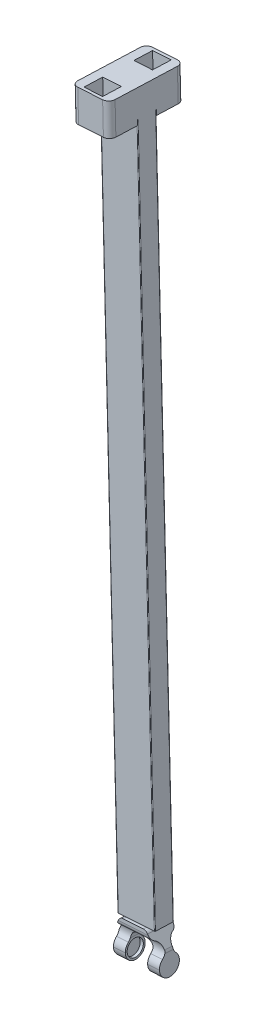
ISO-10303-21;
HEADER;
FILE_DESCRIPTION(('STEP AP214'),'2;1');
FILE_NAME('part.step','',(''),(''),'','','');
FILE_SCHEMA(('AUTOMOTIVE_DESIGN { 1 0 10303 214 1 1 1 1 }'));
ENDSEC;
DATA;
#1=APPLICATION_CONTEXT('core data for automotive mechanical design processes');
#2=APPLICATION_PROTOCOL_DEFINITION('international standard','automotive_design',2000,#1);
#3=PRODUCT_CONTEXT('',#1,'mechanical');
#4=PRODUCT('Part','Part','',(#3));
#5=PRODUCT_RELATED_PRODUCT_CATEGORY('part','',(#4));
#6=PRODUCT_DEFINITION_FORMATION('','',#4);
#7=PRODUCT_DEFINITION_CONTEXT('part definition',#1,'design');
#8=PRODUCT_DEFINITION('design','',#6,#7);
#9=PRODUCT_DEFINITION_SHAPE('','',#8);
#10=(LENGTH_UNIT() NAMED_UNIT(*) SI_UNIT(.MILLI.,.METRE.));
#11=(NAMED_UNIT(*) PLANE_ANGLE_UNIT() SI_UNIT($,.RADIAN.));
#12=(NAMED_UNIT(*) SI_UNIT($,.STERADIAN.) SOLID_ANGLE_UNIT());
#13=UNCERTAINTY_MEASURE_WITH_UNIT(LENGTH_MEASURE(1.E-05),#10,'distance_accuracy_value','');
#14=(GEOMETRIC_REPRESENTATION_CONTEXT(3) GLOBAL_UNCERTAINTY_ASSIGNED_CONTEXT((#13)) GLOBAL_UNIT_ASSIGNED_CONTEXT((#10,
#11,#12)) REPRESENTATION_CONTEXT('',''));
#15=CARTESIAN_POINT('',(0.,0.,0.));
#16=DIRECTION('',(0.,0.,1.));
#17=DIRECTION('',(1.,0.,0.));
#18=AXIS2_PLACEMENT_3D('',#15,#16,#17);
#19=CARTESIAN_POINT('',(-19.761008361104,-209.479090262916,-55.170808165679));
#20=DIRECTION('',(0.0616154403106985,-0.997458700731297,0.0357725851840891));
#21=DIRECTION('',(0.00220562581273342,-0.0357045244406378,-0.999359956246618));
#22=AXIS2_PLACEMENT_3D('',#19,#20,#21);
#23=PLANE('',#22);
#24=DIRECTION('',(0.00220562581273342,-0.0357045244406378,-0.999359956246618));
#25=VECTOR('',#24,1.);
#26=CARTESIAN_POINT('',(-49.7039341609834,-211.328737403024,-55.1708102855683));
#27=LINE('',#26,#25);
#28=CARTESIAN_POINT('',(-49.7370185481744,-210.793169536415,-40.180410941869));
#29=VERTEX_POINT('',#28);
#30=CARTESIAN_POINT('',(-49.735915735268,-210.811021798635,-40.6800909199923));
#31=VERTEX_POINT('',#30);
#32=EDGE_CURVE('E1440',#29,#31,#27,.T.);
#33=ORIENTED_EDGE('',*,*,#32,.T.);
#34=CARTESIAN_POINT('',(-49.2368669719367,-210.7801943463,-40.6800908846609));
#35=DIRECTION('',(-0.0616154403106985,0.997458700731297,-0.0357725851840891));
#36=DIRECTION('',(0.998097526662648,0.061654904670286,7.06629741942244E-08));
#37=AXIS2_PLACEMENT_3D('',#34,#35,#36);
#38=CIRCLE('',#37,0.5);
#39=CARTESIAN_POINT('',(-49.2379697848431,-210.76234208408,-40.1804109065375));
#40=VERTEX_POINT('',#39);
#41=EDGE_CURVE('E1242',#31,#40,#38,.T.);
#42=ORIENTED_EDGE('',*,*,#41,.T.);
#43=DIRECTION('',(-0.998097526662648,-0.061654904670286,-7.06629741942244E-08));
#44=VECTOR('',#43,1.);
#45=CARTESIAN_POINT('',(-49.7370185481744,-210.793169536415,-40.180410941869));
#46=LINE('',#45,#44);
#47=EDGE_CURVE('E10',#40,#29,#46,.T.);
#48=ORIENTED_EDGE('',*,*,#47,.T.);
#49=EDGE_LOOP('',(#33,#42,#48));
#50=FACE_BOUND('',#49,.T.);
#51=ADVANCED_FACE('F16',(#50),#23,.T.);
#52=CARTESIAN_POINT('',(-49.7370185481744,-210.793169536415,-40.180410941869));
#53=DIRECTION('',(-0.00220562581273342,0.0357045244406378,0.999359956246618));
#54=DIRECTION('',(0.998097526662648,0.061654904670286,7.06629741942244E-08));
#55=AXIS2_PLACEMENT_3D('',#52,#53,#54);
#56=PLANE('',#55);
#57=DIRECTION('',(0.0616154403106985,-0.997458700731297,0.0357725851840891));
#58=VECTOR('',#57,1.);
#59=CARTESIAN_POINT('',(-49.2379697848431,-210.76234208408,-40.1804109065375));
#60=LINE('',#59,#58);
#61=CARTESIAN_POINT('',(-48.9915080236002,-214.752176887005,-40.0373205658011));
#62=VERTEX_POINT('',#61);
#63=EDGE_CURVE('E1156',#40,#62,#60,.T.);
#64=ORIENTED_EDGE('',*,*,#63,.T.);
#65=DIRECTION('',(-0.998097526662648,-0.061654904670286,-7.06629741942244E-08));
#66=VECTOR('',#65,1.);
#67=CARTESIAN_POINT('',(-49.4905567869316,-214.78300433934,-40.0373206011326));
#68=LINE('',#67,#66);
#69=CARTESIAN_POINT('',(-49.4905567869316,-214.78300433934,-40.0373206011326));
#70=VERTEX_POINT('',#69);
#71=EDGE_CURVE('E1268',#62,#70,#68,.T.);
#72=ORIENTED_EDGE('',*,*,#71,.T.);
#73=DIRECTION('',(0.0616154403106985,-0.997458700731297,0.0357725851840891));
#74=VECTOR('',#73,1.);
#75=CARTESIAN_POINT('',(-49.7370185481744,-210.793169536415,-40.180410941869));
#76=LINE('',#75,#74);
#77=EDGE_CURVE('E1285',#29,#70,#76,.T.);
#78=ORIENTED_EDGE('',*,*,#77,.F.);
#79=ORIENTED_EDGE('',*,*,#47,.F.);
#80=EDGE_LOOP('',(#64,#72,#78,#79));
#81=FACE_BOUND('',#80,.T.);
#82=ADVANCED_FACE('F1627',(#81),#56,.F.);
#83=CARTESIAN_POINT('',(-49.7039341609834,-211.328737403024,-55.1708102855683));
#84=DIRECTION('',(0.00220562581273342,-0.0357045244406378,-0.999359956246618));
#85=DIRECTION('',(0.0616154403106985,-0.997458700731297,0.0357725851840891));
#86=AXIS2_PLACEMENT_3D('',#83,#84,#85);
#87=PLANE('',#86);
#88=DIRECTION('',(0.0616154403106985,-0.997458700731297,0.0357725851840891));
#89=VECTOR('',#88,1.);
#90=CARTESIAN_POINT('',(-20.2600571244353,-209.509917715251,-55.1708082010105));
#91=LINE('',#90,#89);
#92=CARTESIAN_POINT('',(-20.2600571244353,-209.509917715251,-55.1708082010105));
#93=VERTEX_POINT('',#92);
#94=CARTESIAN_POINT('',(-20.0135953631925,-213.499752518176,-55.0277178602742));
#95=VERTEX_POINT('',#94);
#96=EDGE_CURVE('E1263',#93,#95,#91,.T.);
#97=ORIENTED_EDGE('',*,*,#96,.T.);
#98=DIRECTION('',(0.998097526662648,0.061654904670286,7.06629741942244E-08));
#99=VECTOR('',#98,1.);
#100=CARTESIAN_POINT('',(-49.4574723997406,-215.318572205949,-55.0277199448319));
#101=LINE('',#100,#99);
#102=CARTESIAN_POINT('',(-19.5145465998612,-213.468925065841,-55.0277178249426));
#103=VERTEX_POINT('',#102);
#104=EDGE_CURVE('E1220',#95,#103,#101,.T.);
#105=ORIENTED_EDGE('',*,*,#104,.T.);
#106=DIRECTION('',(0.0616154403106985,-0.997458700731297,0.0357725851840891));
#107=VECTOR('',#106,1.);
#108=CARTESIAN_POINT('',(-19.761008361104,-209.479090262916,-55.170808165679));
#109=LINE('',#108,#107);
#110=CARTESIAN_POINT('',(-19.761008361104,-209.479090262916,-55.170808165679));
#111=VERTEX_POINT('',#110);
#112=EDGE_CURVE('E855',#111,#103,#109,.T.);
#113=ORIENTED_EDGE('',*,*,#112,.F.);
#114=DIRECTION('',(0.998097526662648,0.061654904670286,7.06629741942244E-08));
#115=VECTOR('',#114,1.);
#116=CARTESIAN_POINT('',(-49.7039341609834,-211.328737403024,-55.1708102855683));
#117=LINE('',#116,#115);
#118=EDGE_CURVE('E1500',#93,#111,#117,.T.);
#119=ORIENTED_EDGE('',*,*,#118,.F.);
#120=EDGE_LOOP('',(#97,#105,#113,#119));
#121=FACE_BOUND('',#120,.T.);
#122=ADVANCED_FACE('F754',(#121),#87,.F.);
#123=CARTESIAN_POINT('',(-24.4664357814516,-214.402028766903,-72.5165174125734));
#124=DIRECTION('',(-0.0616154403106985,0.997458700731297,-0.0357725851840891));
#125=DIRECTION('',(-0.998097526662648,-0.061654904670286,-7.06629741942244E-08));
#126=AXIS2_PLACEMENT_3D('',#123,#124,#125);
#127=CYLINDRICAL_SURFACE('',#126,5.);
#128=CARTESIAN_POINT('',(-24.4664357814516,-214.402028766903,-72.5165174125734));
#129=DIRECTION('',(0.0616154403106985,-0.997458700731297,0.0357725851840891));
#130=DIRECTION('',(0.998097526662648,0.061654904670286,7.06629741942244E-08));
#131=AXIS2_PLACEMENT_3D('',#128,#129,#130);
#132=CIRCLE('',#131,5.);
#133=CARTESIAN_POINT('',(-24.4554076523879,-214.580551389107,-77.5133171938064));
#134=VERTEX_POINT('',#133);
#135=CARTESIAN_POINT('',(-19.4759481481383,-214.093754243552,-72.5165170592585));
#136=VERTEX_POINT('',#135);
#137=EDGE_CURVE('E1252',#134,#136,#132,.T.);
#138=ORIENTED_EDGE('',*,*,#137,.F.);
#139=DIRECTION('',(0.0616154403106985,-0.997458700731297,0.0357725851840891));
#140=VECTOR('',#139,1.);
#141=CARTESIAN_POINT('',(-24.4554076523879,-214.580551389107,-77.5133171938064));
#142=LINE('',#141,#140);
#143=CARTESIAN_POINT('',(-25.9957936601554,-189.644083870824,-78.4076318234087));
#144=VERTEX_POINT('',#143);
#145=EDGE_CURVE('E1119',#144,#134,#142,.T.);
#146=ORIENTED_EDGE('',*,*,#145,.F.);
#147=CARTESIAN_POINT('',(-26.006821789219,-189.465561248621,-73.4108320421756));
#148=DIRECTION('',(-0.0616154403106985,0.997458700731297,-0.0357725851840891));
#149=DIRECTION('',(0.998097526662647,0.0616549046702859,7.0662973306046E-08));
#150=AXIS2_PLACEMENT_3D('',#147,#148,#149);
#151=CIRCLE('',#150,5.);
#152=CARTESIAN_POINT('',(-21.0163341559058,-189.15728672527,-73.4108316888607));
#153=VERTEX_POINT('',#152);
#154=EDGE_CURVE('E860',#153,#144,#151,.T.);
#155=ORIENTED_EDGE('',*,*,#154,.F.);
#156=DIRECTION('',(-0.0616154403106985,0.997458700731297,-0.0357725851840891));
#157=VECTOR('',#156,1.);
#158=CARTESIAN_POINT('',(-19.4759481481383,-214.093754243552,-72.5165170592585));
#159=LINE('',#158,#157);
#160=EDGE_CURVE('E854',#136,#153,#159,.T.);
#161=ORIENTED_EDGE('',*,*,#160,.F.);
#162=EDGE_LOOP('',(#138,#146,#155,#161));
#163=FACE_BOUND('',#162,.T.);
#164=ADVANCED_FACE('F1600',(#163),#127,.T.);
#165=CARTESIAN_POINT('',(-24.5767170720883,-212.616802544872,-22.5485196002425));
#166=DIRECTION('',(-0.0616154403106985,0.997458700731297,-0.0357725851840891));
#167=DIRECTION('',(-0.998097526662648,-0.061654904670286,-7.06629741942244E-08));
#168=AXIS2_PLACEMENT_3D('',#165,#166,#167);
#169=CYLINDRICAL_SURFACE('',#168,5.);
#170=CARTESIAN_POINT('',(-24.5767170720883,-212.616802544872,-22.5485196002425));
#171=DIRECTION('',(0.0616154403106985,-0.997458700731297,0.0357725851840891));
#172=DIRECTION('',(0.998097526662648,0.061654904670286,7.06629741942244E-08));
#173=AXIS2_PLACEMENT_3D('',#170,#171,#172);
#174=CIRCLE('',#173,5.);
#175=CARTESIAN_POINT('',(-19.586229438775,-212.30852802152,-22.5485192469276));
#176=VERTEX_POINT('',#175);
#177=CARTESIAN_POINT('',(-24.5877452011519,-212.438279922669,-17.5517198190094));
#178=VERTEX_POINT('',#177);
#179=EDGE_CURVE('E1088',#176,#178,#174,.T.);
#180=ORIENTED_EDGE('',*,*,#179,.F.);
#181=DIRECTION('',(0.0616154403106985,-0.997458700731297,0.0357725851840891));
#182=VECTOR('',#181,1.);
#183=CARTESIAN_POINT('',(-19.586229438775,-212.30852802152,-22.5485192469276));
#184=LINE('',#183,#182);
#185=CARTESIAN_POINT('',(-21.1266154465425,-187.372060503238,-23.4428338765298));
#186=VERTEX_POINT('',#185);
#187=EDGE_CURVE('E1229',#186,#176,#184,.T.);
#188=ORIENTED_EDGE('',*,*,#187,.F.);
#189=CARTESIAN_POINT('',(-26.1171030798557,-187.680335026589,-23.4428342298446));
#190=DIRECTION('',(-0.0616154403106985,0.997458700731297,-0.0357725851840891));
#191=DIRECTION('',(0.998097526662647,0.0616549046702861,7.06629795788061E-08));
#192=AXIS2_PLACEMENT_3D('',#189,#190,#191);
#193=CIRCLE('',#192,5.);
#194=CARTESIAN_POINT('',(-26.1281312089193,-187.501812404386,-18.4460344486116));
#195=VERTEX_POINT('',#194);
#196=EDGE_CURVE('E857',#195,#186,#193,.T.);
#197=ORIENTED_EDGE('',*,*,#196,.F.);
#198=DIRECTION('',(-0.0616154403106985,0.997458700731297,-0.0357725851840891));
#199=VECTOR('',#198,1.);
#200=CARTESIAN_POINT('',(-24.5877452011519,-212.438279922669,-17.5517198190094));
#201=LINE('',#200,#199);
#202=EDGE_CURVE('E1085',#178,#195,#201,.T.);
#203=ORIENTED_EDGE('',*,*,#202,.F.);
#204=EDGE_LOOP('',(#180,#188,#197,#203));
#205=FACE_BOUND('',#204,.T.);
#206=ADVANCED_FACE('F1608',(#205),#169,.T.);
#207=CARTESIAN_POINT('',(-44.5386676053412,-213.849900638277,-22.5485210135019));
#208=DIRECTION('',(-0.0616154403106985,0.997458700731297,-0.0357725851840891));
#209=DIRECTION('',(-0.998097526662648,-0.061654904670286,-7.06629741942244E-08));
#210=AXIS2_PLACEMENT_3D('',#207,#208,#209);
#211=CYLINDRICAL_SURFACE('',#210,5.);
#212=CARTESIAN_POINT('',(-44.5386676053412,-213.849900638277,-22.5485210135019));
#213=DIRECTION('',(0.0616154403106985,-0.997458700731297,0.0357725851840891));
#214=DIRECTION('',(0.998097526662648,0.061654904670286,7.06629741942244E-08));
#215=AXIS2_PLACEMENT_3D('',#212,#213,#214);
#216=CIRCLE('',#215,5.);
#217=CARTESIAN_POINT('',(-44.5496957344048,-213.671378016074,-17.5517212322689));
#218=VERTEX_POINT('',#217);
#219=CARTESIAN_POINT('',(-49.5291552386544,-214.158175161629,-22.5485213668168));
#220=VERTEX_POINT('',#219);
#221=EDGE_CURVE('E1271',#218,#220,#216,.T.);
#222=ORIENTED_EDGE('',*,*,#221,.F.);
#223=DIRECTION('',(0.0616154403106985,-0.997458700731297,0.0357725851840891));
#224=VECTOR('',#223,1.);
#225=CARTESIAN_POINT('',(-44.5496957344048,-213.671378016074,-17.5517212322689));
#226=LINE('',#225,#224);
#227=CARTESIAN_POINT('',(-46.0900817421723,-188.734910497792,-18.4460358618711));
#228=VERTEX_POINT('',#227);
#229=EDGE_CURVE('E1118',#228,#218,#226,.T.);
#230=ORIENTED_EDGE('',*,*,#229,.F.);
#231=CARTESIAN_POINT('',(-46.0790536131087,-188.913433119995,-23.4428356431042));
#232=DIRECTION('',(-0.0616154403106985,0.997458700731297,-0.0357725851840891));
#233=DIRECTION('',(0.998097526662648,0.061654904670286,7.06629741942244E-08));
#234=AXIS2_PLACEMENT_3D('',#231,#232,#233);
#235=CIRCLE('',#234,5.);
#236=CARTESIAN_POINT('',(-51.0695412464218,-189.221707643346,-23.442835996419));
#237=VERTEX_POINT('',#236);
#238=EDGE_CURVE('E861',#237,#228,#235,.T.);
#239=ORIENTED_EDGE('',*,*,#238,.F.);
#240=DIRECTION('',(-0.0616154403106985,0.997458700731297,-0.0357725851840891));
#241=VECTOR('',#240,1.);
#242=CARTESIAN_POINT('',(-49.5291552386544,-214.158175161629,-22.5485213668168));
#243=LINE('',#242,#241);
#244=EDGE_CURVE('E1080',#220,#237,#243,.T.);
#245=ORIENTED_EDGE('',*,*,#244,.F.);
#246=EDGE_LOOP('',(#222,#230,#239,#245));
#247=FACE_BOUND('',#246,.T.);
#248=ADVANCED_FACE('F1616',(#247),#211,.T.);
#249=CARTESIAN_POINT('',(-44.4283863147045,-215.635126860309,-72.5165188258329));
#250=DIRECTION('',(-0.0616154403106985,0.997458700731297,-0.0357725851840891));
#251=DIRECTION('',(-0.998097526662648,-0.061654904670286,-7.06629741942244E-08));
#252=AXIS2_PLACEMENT_3D('',#249,#250,#251);
#253=CYLINDRICAL_SURFACE('',#252,5.);
#254=CARTESIAN_POINT('',(-44.4283863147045,-215.635126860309,-72.5165188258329));
#255=DIRECTION('',(0.0616154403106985,-0.997458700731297,0.0357725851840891));
#256=DIRECTION('',(0.998097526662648,0.061654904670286,7.06629741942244E-08));
#257=AXIS2_PLACEMENT_3D('',#254,#255,#256);
#258=CIRCLE('',#257,5.);
#259=CARTESIAN_POINT('',(-49.4188739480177,-215.943401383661,-72.5165191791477));
#260=VERTEX_POINT('',#259);
#261=CARTESIAN_POINT('',(-44.4173581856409,-215.813649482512,-77.513318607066));
#262=VERTEX_POINT('',#261);
#263=EDGE_CURVE('E1293',#260,#262,#258,.T.);
#264=ORIENTED_EDGE('',*,*,#263,.F.);
#265=DIRECTION('',(0.0616154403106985,-0.997458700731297,0.0357725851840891));
#266=VECTOR('',#265,1.);
#267=CARTESIAN_POINT('',(-49.4188739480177,-215.943401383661,-72.5165191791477));
#268=LINE('',#267,#266);
#269=CARTESIAN_POINT('',(-50.9592599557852,-191.006933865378,-73.4108338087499));
#270=VERTEX_POINT('',#269);
#271=EDGE_CURVE('E1079',#270,#260,#268,.T.);
#272=ORIENTED_EDGE('',*,*,#271,.F.);
#273=CARTESIAN_POINT('',(-45.968772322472,-190.698659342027,-73.4108334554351));
#274=DIRECTION('',(-0.0616154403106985,0.997458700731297,-0.0357725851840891));
#275=DIRECTION('',(0.998097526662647,0.0616549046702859,7.06629750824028E-08));
#276=AXIS2_PLACEMENT_3D('',#273,#274,#275);
#277=CIRCLE('',#276,5.);
#278=CARTESIAN_POINT('',(-45.9577441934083,-190.87718196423,-78.4076332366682));
#279=VERTEX_POINT('',#278);
#280=EDGE_CURVE('E1124',#279,#270,#277,.T.);
#281=ORIENTED_EDGE('',*,*,#280,.F.);
#282=DIRECTION('',(-0.0616154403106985,0.997458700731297,-0.0357725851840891));
#283=VECTOR('',#282,1.);
#284=CARTESIAN_POINT('',(-44.4173581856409,-215.813649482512,-77.513318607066));
#285=LINE('',#284,#283);
#286=EDGE_CURVE('E1157',#262,#279,#285,.T.);
#287=ORIENTED_EDGE('',*,*,#286,.F.);
#288=EDGE_LOOP('',(#264,#272,#281,#287));
#289=FACE_BOUND('',#288,.T.);
#290=ADVANCED_FACE('F1675',(#289),#253,.T.);
#291=CARTESIAN_POINT('',(-28.6178609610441,-187.745210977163,-20.9444345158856));
#292=DIRECTION('',(0.998097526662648,0.061654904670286,7.06629741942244E-08));
#293=DIRECTION('',(-0.00220562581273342,0.0357045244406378,0.999359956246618));
#294=AXIS2_PLACEMENT_3D('',#291,#292,#293);
#295=PLANE('',#294);
#296=DIRECTION('',(-0.00220562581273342,0.0357045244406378,0.999359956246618));
#297=VECTOR('',#296,1.);
#298=CARTESIAN_POINT('',(-27.0774749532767,-212.681678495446,-20.0501198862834));
#299=LINE('',#298,#297);
#300=CARTESIAN_POINT('',(-27.0443905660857,-213.217246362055,-35.0405192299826));
#301=VERTEX_POINT('',#300);
#302=CARTESIAN_POINT('',(-27.0774749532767,-212.681678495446,-20.0501198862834));
#303=VERTEX_POINT('',#302);
#304=EDGE_CURVE('E1120',#301,#303,#299,.T.);
#305=ORIENTED_EDGE('',*,*,#304,.T.);
#306=DIRECTION('',(0.0616154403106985,-0.997458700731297,0.0357725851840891));
#307=VECTOR('',#306,1.);
#308=CARTESIAN_POINT('',(-28.6178609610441,-187.745210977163,-20.9444345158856));
#309=LINE('',#308,#307);
#310=CARTESIAN_POINT('',(-28.6178609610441,-187.745210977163,-20.9444345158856));
#311=VERTEX_POINT('',#310);
#312=EDGE_CURVE('E27',#311,#303,#309,.T.);
#313=ORIENTED_EDGE('',*,*,#312,.F.);
#314=DIRECTION('',(-0.00220562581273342,0.0357045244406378,0.999359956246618));
#315=VECTOR('',#314,1.);
#316=CARTESIAN_POINT('',(-28.6178609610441,-187.745210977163,-20.9444345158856));
#317=LINE('',#316,#315);
#318=CARTESIAN_POINT('',(-28.5847765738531,-188.280778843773,-35.9348338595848));
#319=VERTEX_POINT('',#318);
#320=EDGE_CURVE('E1364',#319,#311,#317,.T.);
#321=ORIENTED_EDGE('',*,*,#320,.F.);
#322=DIRECTION('',(0.0616154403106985,-0.997458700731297,0.0357725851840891));
#323=VECTOR('',#322,1.);
#324=CARTESIAN_POINT('',(-28.5847765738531,-188.280778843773,-35.9348338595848));
#325=LINE('',#324,#323);
#326=EDGE_CURVE('E1065',#319,#301,#325,.T.);
#327=ORIENTED_EDGE('',*,*,#326,.T.);
#328=EDGE_LOOP('',(#305,#313,#321,#327));
#329=FACE_BOUND('',#328,.T.);
#330=ADVANCED_FACE('F1673',(#329),#295,.F.);
#331=CARTESIAN_POINT('',(-28.6178609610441,-187.745210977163,-20.9444345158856));
#332=DIRECTION('',(-0.00220562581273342,0.0357045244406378,0.999359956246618));
#333=DIRECTION('',(0.998097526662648,0.061654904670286,7.06629741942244E-08));
#334=AXIS2_PLACEMENT_3D('',#331,#332,#333);
#335=PLANE('',#334);
#336=DIRECTION('',(-0.998097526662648,-0.061654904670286,-7.06629741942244E-08));
#337=VECTOR('',#336,1.);
#338=CARTESIAN_POINT('',(-27.0774749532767,-212.681678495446,-20.0501198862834));
#339=LINE('',#338,#337);
#340=CARTESIAN_POINT('',(-42.0489378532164,-213.6065020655,-20.0501209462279));
#341=VERTEX_POINT('',#340);
#342=EDGE_CURVE('E891',#303,#341,#339,.T.);
#343=ORIENTED_EDGE('',*,*,#342,.T.);
#344=DIRECTION('',(0.0616154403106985,-0.997458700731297,0.0357725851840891));
#345=VECTOR('',#344,1.);
#346=CARTESIAN_POINT('',(-43.5893238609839,-188.670034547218,-20.9444355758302));
#347=LINE('',#346,#345);
#348=CARTESIAN_POINT('',(-43.5893238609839,-188.670034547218,-20.9444355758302));
#349=VERTEX_POINT('',#348);
#350=EDGE_CURVE('E1165',#349,#341,#347,.T.);
#351=ORIENTED_EDGE('',*,*,#350,.F.);
#352=DIRECTION('',(-0.998097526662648,-0.061654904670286,-7.06629741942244E-08));
#353=VECTOR('',#352,1.);
#354=CARTESIAN_POINT('',(-28.6178609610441,-187.745210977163,-20.9444345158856));
#355=LINE('',#354,#353);
#356=EDGE_CURVE('E1084',#311,#349,#355,.T.);
#357=ORIENTED_EDGE('',*,*,#356,.F.);
#358=ORIENTED_EDGE('',*,*,#312,.T.);
#359=EDGE_LOOP('',(#343,#351,#357,#358));
#360=FACE_BOUND('',#359,.T.);
#361=ADVANCED_FACE('F768',(#360),#335,.F.);
#362=CARTESIAN_POINT('',(-43.5893238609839,-188.670034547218,-20.9444355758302));
#363=DIRECTION('',(-0.998097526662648,-0.061654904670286,-7.06629741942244E-08));
#364=DIRECTION('',(-0.00220562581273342,0.0357045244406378,0.999359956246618));
#365=AXIS2_PLACEMENT_3D('',#362,#363,#364);
#366=PLANE('',#365);
#367=DIRECTION('',(0.00220562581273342,-0.0357045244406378,-0.999359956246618));
#368=VECTOR('',#367,1.);
#369=CARTESIAN_POINT('',(-42.0489378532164,-213.6065020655,-20.0501209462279));
#370=LINE('',#369,#368);
#371=CARTESIAN_POINT('',(-42.0158534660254,-214.14206993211,-35.0405202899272));
#372=VERTEX_POINT('',#371);
#373=EDGE_CURVE('E887',#341,#372,#370,.T.);
#374=ORIENTED_EDGE('',*,*,#373,.T.);
#375=DIRECTION('',(0.0616154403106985,-0.997458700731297,0.0357725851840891));
#376=VECTOR('',#375,1.);
#377=CARTESIAN_POINT('',(-43.5562394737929,-189.205602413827,-35.9348349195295));
#378=LINE('',#377,#376);
#379=CARTESIAN_POINT('',(-43.5562394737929,-189.205602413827,-35.9348349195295));
#380=VERTEX_POINT('',#379);
#381=EDGE_CURVE('E1067',#380,#372,#378,.T.);
#382=ORIENTED_EDGE('',*,*,#381,.F.);
#383=DIRECTION('',(0.00220562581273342,-0.0357045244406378,-0.999359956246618));
#384=VECTOR('',#383,1.);
#385=CARTESIAN_POINT('',(-43.5893238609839,-188.670034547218,-20.9444355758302));
#386=LINE('',#385,#384);
#387=EDGE_CURVE('E1131',#349,#380,#386,.T.);
#388=ORIENTED_EDGE('',*,*,#387,.F.);
#389=ORIENTED_EDGE('',*,*,#350,.T.);
#390=EDGE_LOOP('',(#374,#382,#388,#389));
#391=FACE_BOUND('',#390,.T.);
#392=ADVANCED_FACE('F756',(#391),#366,.F.);
#393=CARTESIAN_POINT('',(-28.5847765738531,-188.280778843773,-35.9348338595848));
#394=DIRECTION('',(0.00220562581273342,-0.0357045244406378,-0.999359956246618));
#395=DIRECTION('',(0.0616154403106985,-0.997458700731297,0.0357725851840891));
#396=AXIS2_PLACEMENT_3D('',#393,#394,#395);
#397=PLANE('',#396);
#398=DIRECTION('',(0.998097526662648,0.061654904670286,7.06629741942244E-08));
#399=VECTOR('',#398,1.);
#400=CARTESIAN_POINT('',(-27.0443905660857,-213.217246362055,-35.0405192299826));
#401=LINE('',#400,#399);
#402=EDGE_CURVE('E892',#372,#301,#401,.T.);
#403=ORIENTED_EDGE('',*,*,#402,.T.);
#404=ORIENTED_EDGE('',*,*,#326,.F.);
#405=DIRECTION('',(0.998097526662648,0.061654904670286,7.06629741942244E-08));
#406=VECTOR('',#405,1.);
#407=CARTESIAN_POINT('',(-28.5847765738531,-188.280778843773,-35.9348338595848));
#408=LINE('',#407,#406);
#409=EDGE_CURVE('E1134',#380,#319,#408,.T.);
#410=ORIENTED_EDGE('',*,*,#409,.F.);
#411=ORIENTED_EDGE('',*,*,#381,.T.);
#412=EDGE_LOOP('',(#403,#404,#410,#411));
#413=FACE_BOUND('',#412,.T.);
#414=ADVANCED_FACE('F767',(#413),#397,.F.);
#415=CARTESIAN_POINT('',(-28.5296359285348,-189.173391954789,-60.9188327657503));
#416=DIRECTION('',(0.998097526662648,0.061654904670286,7.06629741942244E-08));
#417=DIRECTION('',(-0.00220562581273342,0.0357045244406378,0.999359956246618));
#418=AXIS2_PLACEMENT_3D('',#415,#416,#417);
#419=PLANE('',#418);
#420=DIRECTION('',(-0.00220562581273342,0.0357045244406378,0.999359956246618));
#421=VECTOR('',#420,1.);
#422=CARTESIAN_POINT('',(-26.9892499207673,-214.109859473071,-60.024518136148));
#423=LINE('',#422,#421);
#424=CARTESIAN_POINT('',(-26.9561655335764,-214.645427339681,-75.0149174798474));
#425=VERTEX_POINT('',#424);
#426=CARTESIAN_POINT('',(-26.9892499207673,-214.109859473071,-60.024518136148));
#427=VERTEX_POINT('',#426);
#428=EDGE_CURVE('E1162',#425,#427,#423,.T.);
#429=ORIENTED_EDGE('',*,*,#428,.T.);
#430=DIRECTION('',(0.0616154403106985,-0.997458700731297,0.0357725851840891));
#431=VECTOR('',#430,1.);
#432=CARTESIAN_POINT('',(-28.5296359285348,-189.173391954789,-60.9188327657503));
#433=LINE('',#432,#431);
#434=CARTESIAN_POINT('',(-28.5296359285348,-189.173391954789,-60.9188327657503));
#435=VERTEX_POINT('',#434);
#436=EDGE_CURVE('E41',#435,#427,#433,.T.);
#437=ORIENTED_EDGE('',*,*,#436,.F.);
#438=DIRECTION('',(-0.00220562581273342,0.0357045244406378,0.999359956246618));
#439=VECTOR('',#438,1.);
#440=CARTESIAN_POINT('',(-28.5296359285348,-189.173391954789,-60.9188327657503));
#441=LINE('',#440,#439);
#442=CARTESIAN_POINT('',(-28.4965515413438,-189.708959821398,-75.9092321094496));
#443=VERTEX_POINT('',#442);
#444=EDGE_CURVE('E1059',#443,#435,#441,.T.);
#445=ORIENTED_EDGE('',*,*,#444,.F.);
#446=DIRECTION('',(0.0616154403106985,-0.997458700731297,0.0357725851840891));
#447=VECTOR('',#446,1.);
#448=CARTESIAN_POINT('',(-28.4965515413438,-189.708959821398,-75.9092321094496));
#449=LINE('',#448,#447);
#450=EDGE_CURVE('E1238',#443,#425,#449,.T.);
#451=ORIENTED_EDGE('',*,*,#450,.T.);
#452=EDGE_LOOP('',(#429,#437,#445,#451));
#453=FACE_BOUND('',#452,.T.);
#454=ADVANCED_FACE('F1757',(#453),#419,.F.);
#455=CARTESIAN_POINT('',(-28.5296359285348,-189.173391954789,-60.9188327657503));
#456=DIRECTION('',(-0.00220562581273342,0.0357045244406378,0.999359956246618));
#457=DIRECTION('',(0.998097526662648,0.061654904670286,7.06629741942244E-08));
#458=AXIS2_PLACEMENT_3D('',#455,#456,#457);
#459=PLANE('',#458);
#460=DIRECTION('',(-0.998097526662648,-0.061654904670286,-7.06629741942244E-08));
#461=VECTOR('',#460,1.);
#462=CARTESIAN_POINT('',(-26.9892499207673,-214.109859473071,-60.024518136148));
#463=LINE('',#462,#461);
#464=CARTESIAN_POINT('',(-41.9607128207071,-215.034683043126,-60.0245191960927));
#465=VERTEX_POINT('',#464);
#466=EDGE_CURVE('E1129',#427,#465,#463,.T.);
#467=ORIENTED_EDGE('',*,*,#466,.T.);
#468=DIRECTION('',(0.0616154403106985,-0.997458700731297,0.0357725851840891));
#469=VECTOR('',#468,1.);
#470=CARTESIAN_POINT('',(-43.5010988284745,-190.098215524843,-60.9188338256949));
#471=LINE('',#470,#469);
#472=CARTESIAN_POINT('',(-43.5010988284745,-190.098215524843,-60.9188338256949));
#473=VERTEX_POINT('',#472);
#474=EDGE_CURVE('E1237',#473,#465,#471,.T.);
#475=ORIENTED_EDGE('',*,*,#474,.F.);
#476=DIRECTION('',(-0.998097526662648,-0.061654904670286,-7.06629741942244E-08));
#477=VECTOR('',#476,1.);
#478=CARTESIAN_POINT('',(-28.5296359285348,-189.173391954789,-60.9188327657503));
#479=LINE('',#478,#477);
#480=EDGE_CURVE('E1063',#435,#473,#479,.T.);
#481=ORIENTED_EDGE('',*,*,#480,.F.);
#482=ORIENTED_EDGE('',*,*,#436,.T.);
#483=EDGE_LOOP('',(#467,#475,#481,#482));
#484=FACE_BOUND('',#483,.T.);
#485=ADVANCED_FACE('F1664',(#484),#459,.F.);
#486=CARTESIAN_POINT('',(-43.5010988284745,-190.098215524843,-60.9188338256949));
#487=DIRECTION('',(-0.998097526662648,-0.061654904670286,-7.06629741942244E-08));
#488=DIRECTION('',(-0.00220562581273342,0.0357045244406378,0.999359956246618));
#489=AXIS2_PLACEMENT_3D('',#486,#487,#488);
#490=PLANE('',#489);
#491=DIRECTION('',(0.00220562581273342,-0.0357045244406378,-0.999359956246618));
#492=VECTOR('',#491,1.);
#493=CARTESIAN_POINT('',(-41.9607128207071,-215.034683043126,-60.0245191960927));
#494=LINE('',#493,#492);
#495=CARTESIAN_POINT('',(-41.9276284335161,-215.570250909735,-75.014918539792));
#496=VERTEX_POINT('',#495);
#497=EDGE_CURVE('E1125',#465,#496,#494,.T.);
#498=ORIENTED_EDGE('',*,*,#497,.T.);
#499=DIRECTION('',(0.0616154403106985,-0.997458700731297,0.0357725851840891));
#500=VECTOR('',#499,1.);
#501=CARTESIAN_POINT('',(-43.4680144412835,-190.633783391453,-75.9092331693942));
#502=LINE('',#501,#500);
#503=CARTESIAN_POINT('',(-43.4680144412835,-190.633783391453,-75.9092331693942));
#504=VERTEX_POINT('',#503);
#505=EDGE_CURVE('E1234',#504,#496,#502,.T.);
#506=ORIENTED_EDGE('',*,*,#505,.F.);
#507=DIRECTION('',(0.00220562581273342,-0.0357045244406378,-0.999359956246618));
#508=VECTOR('',#507,1.);
#509=CARTESIAN_POINT('',(-43.5010988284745,-190.098215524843,-60.9188338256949));
#510=LINE('',#509,#508);
#511=EDGE_CURVE('E1081',#473,#504,#510,.T.);
#512=ORIENTED_EDGE('',*,*,#511,.F.);
#513=ORIENTED_EDGE('',*,*,#474,.T.);
#514=EDGE_LOOP('',(#498,#506,#512,#513));
#515=FACE_BOUND('',#514,.T.);
#516=ADVANCED_FACE('F1660',(#515),#490,.F.);
#517=CARTESIAN_POINT('',(-28.4965515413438,-189.708959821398,-75.9092321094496));
#518=DIRECTION('',(0.00220562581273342,-0.0357045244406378,-0.999359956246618));
#519=DIRECTION('',(0.0616154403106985,-0.997458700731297,0.0357725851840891));
#520=AXIS2_PLACEMENT_3D('',#517,#518,#519);
#521=PLANE('',#520);
#522=DIRECTION('',(0.998097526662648,0.061654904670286,7.06629741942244E-08));
#523=VECTOR('',#522,1.);
#524=CARTESIAN_POINT('',(-26.9561655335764,-214.645427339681,-75.0149174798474));
#525=LINE('',#524,#523);
#526=EDGE_CURVE('E1130',#496,#425,#525,.T.);
#527=ORIENTED_EDGE('',*,*,#526,.T.);
#528=ORIENTED_EDGE('',*,*,#450,.F.);
#529=DIRECTION('',(0.998097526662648,0.061654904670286,7.06629741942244E-08));
#530=VECTOR('',#529,1.);
#531=CARTESIAN_POINT('',(-28.4965515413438,-189.708959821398,-75.9092321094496));
#532=LINE('',#531,#530);
#533=EDGE_CURVE('E1064',#504,#443,#532,.T.);
#534=ORIENTED_EDGE('',*,*,#533,.F.);
#535=ORIENTED_EDGE('',*,*,#505,.T.);
#536=EDGE_LOOP('',(#527,#528,#534,#535));
#537=FACE_BOUND('',#536,.T.);
#538=ADVANCED_FACE('F1663',(#537),#521,.F.);
#539=CARTESIAN_POINT('',(-21.0053060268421,-189.335809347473,-78.4076314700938));
#540=DIRECTION('',(0.0616154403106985,-0.997458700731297,0.0357725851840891));
#541=DIRECTION('',(0.00220562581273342,-0.0357045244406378,-0.999359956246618));
#542=AXIS2_PLACEMENT_3D('',#539,#540,#541);
#543=PLANE('',#542);
#544=ORIENTED_EDGE('',*,*,#511,.T.);
#545=ORIENTED_EDGE('',*,*,#533,.T.);
#546=ORIENTED_EDGE('',*,*,#444,.T.);
#547=ORIENTED_EDGE('',*,*,#480,.T.);
#548=EDGE_LOOP('',(#544,#545,#546,#547));
#549=FACE_BOUND('',#548,.T.);
#550=ORIENTED_EDGE('',*,*,#387,.T.);
#551=ORIENTED_EDGE('',*,*,#409,.T.);
#552=ORIENTED_EDGE('',*,*,#320,.T.);
#553=ORIENTED_EDGE('',*,*,#356,.T.);
#554=EDGE_LOOP('',(#550,#551,#552,#553));
#555=FACE_BOUND('',#554,.T.);
#556=DIRECTION('',(0.998097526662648,0.061654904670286,7.06629741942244E-08));
#557=VECTOR('',#556,1.);
#558=CARTESIAN_POINT('',(-50.9482318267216,-191.185456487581,-78.407633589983));
#559=LINE('',#558,#557);
#560=EDGE_CURVE('E1161',#279,#144,#559,.T.);
#561=ORIENTED_EDGE('',*,*,#560,.F.);
#562=ORIENTED_EDGE('',*,*,#280,.T.);
#563=DIRECTION('',(0.00220562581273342,-0.0357045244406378,-0.999359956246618));
#564=VECTOR('',#563,1.);
#565=CARTESIAN_POINT('',(-50.9482318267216,-191.185456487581,-78.407633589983));
#566=LINE('',#565,#564);
#567=EDGE_CURVE('E1075',#237,#270,#566,.T.);
#568=ORIENTED_EDGE('',*,*,#567,.F.);
#569=ORIENTED_EDGE('',*,*,#238,.T.);
#570=DIRECTION('',(-0.998097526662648,-0.061654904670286,-7.06629741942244E-08));
#571=VECTOR('',#570,1.);
#572=CARTESIAN_POINT('',(-51.0805693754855,-189.043185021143,-18.4460362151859));
#573=LINE('',#572,#571);
#574=EDGE_CURVE('E1114',#195,#228,#573,.T.);
#575=ORIENTED_EDGE('',*,*,#574,.F.);
#576=ORIENTED_EDGE('',*,*,#196,.T.);
#577=DIRECTION('',(-0.00220562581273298,0.035704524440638,0.999359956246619));
#578=VECTOR('',#577,1.);
#579=CARTESIAN_POINT('',(-21.0053060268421,-189.335809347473,-78.4076314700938));
#580=LINE('',#579,#578);
#581=EDGE_CURVE('E1225',#153,#186,#580,.T.);
#582=ORIENTED_EDGE('',*,*,#581,.F.);
#583=ORIENTED_EDGE('',*,*,#154,.T.);
#584=EDGE_LOOP('',(#561,#562,#568,#569,#575,#576,#582,#583));
#585=FACE_BOUND('',#584,.T.);
#586=ADVANCED_FACE('F1604',(#549,#555,#585),#543,.F.);
#587=CARTESIAN_POINT('',(-19.4649200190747,-214.272276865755,-77.5133168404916));
#588=DIRECTION('',(0.0616154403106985,-0.997458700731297,0.0357725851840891));
#589=DIRECTION('',(0.00220562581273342,-0.0357045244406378,-0.999359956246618));
#590=AXIS2_PLACEMENT_3D('',#587,#588,#589);
#591=PLANE('',#590);
#592=ORIENTED_EDGE('',*,*,#402,.F.);
#593=ORIENTED_EDGE('',*,*,#373,.F.);
#594=ORIENTED_EDGE('',*,*,#342,.F.);
#595=ORIENTED_EDGE('',*,*,#304,.F.);
#596=EDGE_LOOP('',(#592,#593,#594,#595));
#597=FACE_BOUND('',#596,.T.);
#598=DIRECTION('',(-0.998097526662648,-0.061654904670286,-7.06629741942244E-08));
#599=VECTOR('',#598,1.);
#600=CARTESIAN_POINT('',(-49.4905567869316,-214.78300433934,-40.0373206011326));
#601=LINE('',#600,#599);
#602=CARTESIAN_POINT('',(-19.5476309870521,-212.933357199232,-40.0373184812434));
#603=VERTEX_POINT('',#602);
#604=CARTESIAN_POINT('',(-20.0466797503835,-212.964184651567,-40.0373185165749));
#605=VERTEX_POINT('',#604);
#606=EDGE_CURVE('E1363',#603,#605,#601,.T.);
#607=ORIENTED_EDGE('',*,*,#606,.F.);
#608=DIRECTION('',(-0.00220562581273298,0.035704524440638,0.999359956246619));
#609=VECTOR('',#608,1.);
#610=CARTESIAN_POINT('',(-19.4649200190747,-214.272276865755,-77.5133168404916));
#611=LINE('',#610,#609);
#612=EDGE_CURVE('E1472',#603,#176,#611,.T.);
#613=ORIENTED_EDGE('',*,*,#612,.T.);
#614=ORIENTED_EDGE('',*,*,#179,.T.);
#615=DIRECTION('',(-0.998097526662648,-0.061654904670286,-7.06629741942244E-08));
#616=VECTOR('',#615,1.);
#617=CARTESIAN_POINT('',(-49.5401833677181,-213.979652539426,-17.5517215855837));
#618=LINE('',#617,#616);
#619=EDGE_CURVE('E1089',#178,#218,#618,.T.);
#620=ORIENTED_EDGE('',*,*,#619,.T.);
#621=ORIENTED_EDGE('',*,*,#221,.T.);
#622=DIRECTION('',(0.00220562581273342,-0.0357045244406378,-0.999359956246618));
#623=VECTOR('',#622,1.);
#624=CARTESIAN_POINT('',(-49.4078458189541,-216.121924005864,-77.5133189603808));
#625=LINE('',#624,#623);
#626=EDGE_CURVE('E1281',#220,#70,#625,.T.);
#627=ORIENTED_EDGE('',*,*,#626,.T.);
#628=ORIENTED_EDGE('',*,*,#71,.F.);
#629=DIRECTION('',(-0.998097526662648,-0.061654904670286,-7.06629741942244E-08));
#630=VECTOR('',#629,1.);
#631=CARTESIAN_POINT('',(-49.4905567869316,-214.78300433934,-40.0373206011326));
#632=LINE('',#631,#630);
#633=EDGE_CURVE('E1216',#605,#62,#632,.T.);
#634=ORIENTED_EDGE('',*,*,#633,.F.);
#635=EDGE_LOOP('',(#607,#613,#614,#620,#621,#627,#628,#634));
#636=FACE_BOUND('',#635,.T.);
#637=ADVANCED_FACE('F1610',(#597,#636),#591,.T.);
#638=CARTESIAN_POINT('',(-49.5401833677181,-213.979652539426,-17.5517215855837));
#639=DIRECTION('',(0.00220562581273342,-0.0357045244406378,-0.999359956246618));
#640=DIRECTION('',(0.0616154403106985,-0.997458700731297,0.0357725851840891));
#641=AXIS2_PLACEMENT_3D('',#638,#639,#640);
#642=PLANE('',#641);
#643=ORIENTED_EDGE('',*,*,#574,.T.);
#644=ORIENTED_EDGE('',*,*,#229,.T.);
#645=ORIENTED_EDGE('',*,*,#619,.F.);
#646=ORIENTED_EDGE('',*,*,#202,.T.);
#647=EDGE_LOOP('',(#643,#644,#645,#646));
#648=FACE_BOUND('',#647,.T.);
#649=ADVANCED_FACE('F651',(#648),#642,.F.);
#650=CARTESIAN_POINT('',(-49.4078458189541,-216.121924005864,-77.5133189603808));
#651=DIRECTION('',(-0.00220562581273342,0.0357045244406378,0.999359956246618));
#652=DIRECTION('',(0.998097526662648,0.061654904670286,7.06629741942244E-08));
#653=AXIS2_PLACEMENT_3D('',#650,#651,#652);
#654=PLANE('',#653);
#655=DIRECTION('',(0.998097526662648,0.061654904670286,7.06629741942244E-08));
#656=VECTOR('',#655,1.);
#657=CARTESIAN_POINT('',(-49.4078458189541,-216.121924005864,-77.5133189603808));
#658=LINE('',#657,#656);
#659=EDGE_CURVE('E1289',#262,#134,#658,.T.);
#660=ORIENTED_EDGE('',*,*,#659,.F.);
#661=ORIENTED_EDGE('',*,*,#286,.T.);
#662=ORIENTED_EDGE('',*,*,#560,.T.);
#663=ORIENTED_EDGE('',*,*,#145,.T.);
#664=EDGE_LOOP('',(#660,#661,#662,#663));
#665=FACE_BOUND('',#664,.T.);
#666=ADVANCED_FACE('F1969',(#665),#654,.F.);
#667=CARTESIAN_POINT('',(-19.4649200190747,-214.272276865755,-77.5133168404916));
#668=DIRECTION('',(0.0616154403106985,-0.997458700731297,0.0357725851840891));
#669=DIRECTION('',(0.00220562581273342,-0.0357045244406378,-0.999359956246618));
#670=AXIS2_PLACEMENT_3D('',#667,#668,#669);
#671=PLANE('',#670);
#672=ORIENTED_EDGE('',*,*,#526,.F.);
#673=ORIENTED_EDGE('',*,*,#497,.F.);
#674=ORIENTED_EDGE('',*,*,#466,.F.);
#675=ORIENTED_EDGE('',*,*,#428,.F.);
#676=EDGE_LOOP('',(#672,#673,#674,#675));
#677=FACE_BOUND('',#676,.T.);
#678=DIRECTION('',(0.998097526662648,0.061654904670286,7.06629741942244E-08));
#679=VECTOR('',#678,1.);
#680=CARTESIAN_POINT('',(-49.4574723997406,-215.318572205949,-55.0277199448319));
#681=LINE('',#680,#679);
#682=CARTESIAN_POINT('',(-49.4574723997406,-215.318572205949,-55.0277199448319));
#683=VERTEX_POINT('',#682);
#684=CARTESIAN_POINT('',(-48.9584236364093,-215.287744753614,-55.0277199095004));
#685=VERTEX_POINT('',#684);
#686=EDGE_CURVE('E1152',#683,#685,#681,.T.);
#687=ORIENTED_EDGE('',*,*,#686,.F.);
#688=DIRECTION('',(0.00220562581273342,-0.0357045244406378,-0.999359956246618));
#689=VECTOR('',#688,1.);
#690=CARTESIAN_POINT('',(-49.4078458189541,-216.121924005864,-77.5133189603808));
#691=LINE('',#690,#689);
#692=EDGE_CURVE('E1113',#683,#260,#691,.T.);
#693=ORIENTED_EDGE('',*,*,#692,.T.);
#694=ORIENTED_EDGE('',*,*,#263,.T.);
#695=ORIENTED_EDGE('',*,*,#659,.T.);
#696=ORIENTED_EDGE('',*,*,#137,.T.);
#697=DIRECTION('',(-0.00220562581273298,0.035704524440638,0.999359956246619));
#698=VECTOR('',#697,1.);
#699=CARTESIAN_POINT('',(-19.4649200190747,-214.272276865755,-77.5133168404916));
#700=LINE('',#699,#698);
#701=EDGE_CURVE('E850',#136,#103,#700,.T.);
#702=ORIENTED_EDGE('',*,*,#701,.T.);
#703=ORIENTED_EDGE('',*,*,#104,.F.);
#704=DIRECTION('',(0.998097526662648,0.061654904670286,7.06629741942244E-08));
#705=VECTOR('',#704,1.);
#706=CARTESIAN_POINT('',(-49.4574723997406,-215.318572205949,-55.0277199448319));
#707=LINE('',#706,#705);
#708=EDGE_CURVE('E1525',#685,#95,#707,.T.);
#709=ORIENTED_EDGE('',*,*,#708,.F.);
#710=EDGE_LOOP('',(#687,#693,#694,#695,#696,#702,#703,#709));
#711=FACE_BOUND('',#710,.T.);
#712=ADVANCED_FACE('F18',(#677,#711),#671,.T.);
#713=CARTESIAN_POINT('',(-19.761008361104,-209.479090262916,-55.170808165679));
#714=DIRECTION('',(0.0616154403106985,-0.997458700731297,0.0357725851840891));
#715=DIRECTION('',(0.00220562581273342,-0.0357045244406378,-0.999359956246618));
#716=AXIS2_PLACEMENT_3D('',#713,#714,#715);
#717=PLANE('',#716);
#718=DIRECTION('',(0.998097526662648,0.061654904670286,7.06629741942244E-08));
#719=VECTOR('',#718,1.);
#720=CARTESIAN_POINT('',(-49.7039341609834,-211.328737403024,-55.1708102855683));
#721=LINE('',#720,#719);
#722=CARTESIAN_POINT('',(-49.7039341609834,-211.328737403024,-55.1708102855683));
#723=VERTEX_POINT('',#722);
#724=CARTESIAN_POINT('',(-49.2048853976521,-211.297909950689,-55.1708102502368));
#725=VERTEX_POINT('',#724);
#726=EDGE_CURVE('E1155',#723,#725,#721,.T.);
#727=ORIENTED_EDGE('',*,*,#726,.T.);
#728=CARTESIAN_POINT('',(-49.2059882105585,-211.280057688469,-54.6711302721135));
#729=DIRECTION('',(-0.0616154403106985,0.997458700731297,-0.0357725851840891));
#730=DIRECTION('',(0.998097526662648,0.061654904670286,7.06629741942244E-08));
#731=AXIS2_PLACEMENT_3D('',#728,#729,#730);
#732=CIRCLE('',#731,0.5);
#733=CARTESIAN_POINT('',(-49.7050369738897,-211.310885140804,-54.6711303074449));
#734=VERTEX_POINT('',#733);
#735=EDGE_CURVE('E1260',#725,#734,#732,.T.);
#736=ORIENTED_EDGE('',*,*,#735,.T.);
#737=DIRECTION('',(0.00220562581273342,-0.0357045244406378,-0.999359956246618));
#738=VECTOR('',#737,1.);
#739=CARTESIAN_POINT('',(-49.7039341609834,-211.328737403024,-55.1708102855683));
#740=LINE('',#739,#738);
#741=EDGE_CURVE('E1151',#734,#723,#740,.T.);
#742=ORIENTED_EDGE('',*,*,#741,.T.);
#743=EDGE_LOOP('',(#727,#736,#742));
#744=FACE_BOUND('',#743,.T.);
#745=ADVANCED_FACE('F1650',(#744),#717,.T.);
#746=CARTESIAN_POINT('',(-19.761008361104,-209.479090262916,-55.170808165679));
#747=DIRECTION('',(0.0616154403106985,-0.997458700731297,0.0357725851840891));
#748=DIRECTION('',(0.00220562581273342,-0.0357045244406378,-0.999359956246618));
#749=AXIS2_PLACEMENT_3D('',#746,#747,#748);
#750=PLANE('',#749);
#751=DIRECTION('',(-0.00220562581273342,0.0357045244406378,0.999359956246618));
#752=VECTOR('',#751,1.);
#753=CARTESIAN_POINT('',(-19.761008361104,-209.479090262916,-55.170808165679));
#754=LINE('',#753,#752);
#755=CARTESIAN_POINT('',(-19.7621111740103,-209.461238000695,-54.6711281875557));
#756=VERTEX_POINT('',#755);
#757=EDGE_CURVE('E1166',#111,#756,#754,.T.);
#758=ORIENTED_EDGE('',*,*,#757,.T.);
#759=CARTESIAN_POINT('',(-20.2611599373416,-209.492065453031,-54.6711282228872));
#760=DIRECTION('',(-0.0616154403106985,0.997458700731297,-0.0357725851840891));
#761=DIRECTION('',(0.998097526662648,0.061654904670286,7.06629741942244E-08));
#762=AXIS2_PLACEMENT_3D('',#759,#760,#761);
#763=CIRCLE('',#762,0.5);
#764=EDGE_CURVE('E1355',#756,#93,#763,.T.);
#765=ORIENTED_EDGE('',*,*,#764,.T.);
#766=ORIENTED_EDGE('',*,*,#118,.T.);
#767=EDGE_LOOP('',(#758,#765,#766));
#768=FACE_BOUND('',#767,.T.);
#769=ADVANCED_FACE('F1588',(#768),#750,.T.);
#770=CARTESIAN_POINT('',(-19.761008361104,-209.479090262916,-55.170808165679));
#771=DIRECTION('',(0.0616154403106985,-0.997458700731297,0.0357725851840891));
#772=DIRECTION('',(0.00220562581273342,-0.0357045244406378,-0.999359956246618));
#773=AXIS2_PLACEMENT_3D('',#770,#771,#772);
#774=PLANE('',#773);
#775=DIRECTION('',(-0.998097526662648,-0.061654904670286,-7.06629741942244E-08));
#776=VECTOR('',#775,1.);
#777=CARTESIAN_POINT('',(-49.7370185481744,-210.793169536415,-40.180410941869));
#778=LINE('',#777,#776);
#779=CARTESIAN_POINT('',(-19.794092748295,-208.943522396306,-40.1804088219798));
#780=VERTEX_POINT('',#779);
#781=CARTESIAN_POINT('',(-20.2931415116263,-208.974349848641,-40.1804088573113));
#782=VERTEX_POINT('',#781);
#783=EDGE_CURVE('E1503',#780,#782,#778,.T.);
#784=ORIENTED_EDGE('',*,*,#783,.T.);
#785=CARTESIAN_POINT('',(-20.2920386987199,-208.992202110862,-40.6800888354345));
#786=DIRECTION('',(-0.0616154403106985,0.997458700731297,-0.0357725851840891));
#787=DIRECTION('',(0.998097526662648,0.061654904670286,7.06629741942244E-08));
#788=AXIS2_PLACEMENT_3D('',#785,#786,#787);
#789=CIRCLE('',#788,0.5);
#790=CARTESIAN_POINT('',(-19.7929899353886,-208.961374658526,-40.680088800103));
#791=VERTEX_POINT('',#790);
#792=EDGE_CURVE('E868',#782,#791,#789,.T.);
#793=ORIENTED_EDGE('',*,*,#792,.T.);
#794=DIRECTION('',(-0.00220562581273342,0.0357045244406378,0.999359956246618));
#795=VECTOR('',#794,1.);
#796=CARTESIAN_POINT('',(-19.761008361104,-209.479090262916,-55.170808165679));
#797=LINE('',#796,#795);
#798=EDGE_CURVE('E1044',#791,#780,#797,.T.);
#799=ORIENTED_EDGE('',*,*,#798,.T.);
#800=EDGE_LOOP('',(#784,#793,#799));
#801=FACE_BOUND('',#800,.T.);
#802=ADVANCED_FACE('F688',(#801),#774,.T.);
#803=CARTESIAN_POINT('',(-49.7370185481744,-210.793169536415,-40.180410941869));
#804=DIRECTION('',(-0.00220562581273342,0.0357045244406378,0.999359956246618));
#805=DIRECTION('',(0.998097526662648,0.061654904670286,7.06629741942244E-08));
#806=AXIS2_PLACEMENT_3D('',#803,#804,#805);
#807=PLANE('',#806);
#808=ORIENTED_EDGE('',*,*,#606,.T.);
#809=DIRECTION('',(-0.0616154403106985,0.997458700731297,-0.0357725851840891));
#810=VECTOR('',#809,1.);
#811=CARTESIAN_POINT('',(-20.2931415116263,-208.974349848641,-40.1804088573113));
#812=LINE('',#811,#810);
#813=EDGE_CURVE('E877',#605,#782,#812,.T.);
#814=ORIENTED_EDGE('',*,*,#813,.T.);
#815=ORIENTED_EDGE('',*,*,#783,.F.);
#816=DIRECTION('',(0.0616154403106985,-0.997458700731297,0.0357725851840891));
#817=VECTOR('',#816,1.);
#818=CARTESIAN_POINT('',(-19.794092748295,-208.943522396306,-40.1804088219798));
#819=LINE('',#818,#817);
#820=EDGE_CURVE('E1048',#780,#603,#819,.T.);
#821=ORIENTED_EDGE('',*,*,#820,.T.);
#822=EDGE_LOOP('',(#808,#814,#815,#821));
#823=FACE_BOUND('',#822,.T.);
#824=ADVANCED_FACE('F1639',(#823),#807,.F.);
#825=CARTESIAN_POINT('',(-49.7039341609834,-211.328737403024,-55.1708102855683));
#826=DIRECTION('',(0.00220562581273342,-0.0357045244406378,-0.999359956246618));
#827=DIRECTION('',(0.0616154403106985,-0.997458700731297,0.0357725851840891));
#828=AXIS2_PLACEMENT_3D('',#825,#826,#827);
#829=PLANE('',#828);
#830=ORIENTED_EDGE('',*,*,#686,.T.);
#831=DIRECTION('',(-0.0616154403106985,0.997458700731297,-0.0357725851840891));
#832=VECTOR('',#831,1.);
#833=CARTESIAN_POINT('',(-49.2048853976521,-211.297909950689,-55.1708102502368));
#834=LINE('',#833,#832);
#835=EDGE_CURVE('E1256',#685,#725,#834,.T.);
#836=ORIENTED_EDGE('',*,*,#835,.T.);
#837=ORIENTED_EDGE('',*,*,#726,.F.);
#838=DIRECTION('',(0.0616154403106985,-0.997458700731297,0.0357725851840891));
#839=VECTOR('',#838,1.);
#840=CARTESIAN_POINT('',(-49.7039341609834,-211.328737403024,-55.1708102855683));
#841=LINE('',#840,#839);
#842=EDGE_CURVE('E1189',#723,#683,#841,.T.);
#843=ORIENTED_EDGE('',*,*,#842,.T.);
#844=EDGE_LOOP('',(#830,#836,#837,#843));
#845=FACE_BOUND('',#844,.T.);
#846=ADVANCED_FACE('F1648',(#845),#829,.F.);
#847=CARTESIAN_POINT('',(-49.2368669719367,-210.7801943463,-40.6800908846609));
#848=DIRECTION('',(0.0616154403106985,-0.997458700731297,0.0357725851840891));
#849=DIRECTION('',(0.998097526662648,0.061654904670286,7.06629741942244E-08));
#850=AXIS2_PLACEMENT_3D('',#847,#848,#849);
#851=CYLINDRICAL_SURFACE('',#850,0.5);
#852=ORIENTED_EDGE('',*,*,#41,.F.);
#853=DIRECTION('',(-0.0616154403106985,0.997458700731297,-0.0357725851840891));
#854=VECTOR('',#853,1.);
#855=CARTESIAN_POINT('',(-49.735915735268,-210.811021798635,-40.6800909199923));
#856=LINE('',#855,#854);
#857=CARTESIAN_POINT('',(-16.4635779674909,-749.438720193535,-21.3628949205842));
#858=VERTEX_POINT('',#857);
#859=EDGE_CURVE('E885',#858,#31,#856,.T.);
#860=ORIENTED_EDGE('',*,*,#859,.F.);
#861=CARTESIAN_POINT('',(-15.9645292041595,-749.407892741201,-21.3628948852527));
#862=DIRECTION('',(0.0616154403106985,-0.997458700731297,0.0357725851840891));
#863=DIRECTION('',(0.998097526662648,0.061654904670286,7.06629741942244E-08));
#864=AXIS2_PLACEMENT_3D('',#861,#862,#863);
#865=CIRCLE('',#864,0.5);
#866=CARTESIAN_POINT('',(-15.9656320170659,-749.39004047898,-20.8632149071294));
#867=VERTEX_POINT('',#866);
#868=EDGE_CURVE('E869',#867,#858,#865,.T.);
#869=ORIENTED_EDGE('',*,*,#868,.F.);
#870=DIRECTION('',(0.0616154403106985,-0.997458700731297,0.0357725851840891));
#871=VECTOR('',#870,1.);
#872=CARTESIAN_POINT('',(-49.2379697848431,-210.76234208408,-40.1804109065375));
#873=LINE('',#872,#871);
#874=EDGE_CURVE('E1310',#62,#867,#873,.T.);
#875=ORIENTED_EDGE('',*,*,#874,.F.);
#876=ORIENTED_EDGE('',*,*,#63,.F.);
#877=EDGE_LOOP('',(#852,#860,#869,#875,#876));
#878=FACE_BOUND('',#877,.T.);
#879=ADVANCED_FACE('F1629',(#878),#851,.T.);
#880=CARTESIAN_POINT('',(-49.2059882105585,-211.280057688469,-54.6711302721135));
#881=DIRECTION('',(0.0616154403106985,-0.997458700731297,0.0357725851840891));
#882=DIRECTION('',(0.998097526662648,0.061654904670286,7.06629741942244E-08));
#883=AXIS2_PLACEMENT_3D('',#880,#881,#882);
#884=CYLINDRICAL_SURFACE('',#883,0.5);
#885=ORIENTED_EDGE('',*,*,#735,.F.);
#886=ORIENTED_EDGE('',*,*,#835,.F.);
#887=DIRECTION('',(-0.0616154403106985,0.997458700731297,-0.0357725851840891));
#888=VECTOR('',#887,1.);
#889=CARTESIAN_POINT('',(-49.2048853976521,-211.297909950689,-55.1708102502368));
#890=LINE('',#889,#888);
#891=CARTESIAN_POINT('',(-15.9325476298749,-749.92560834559,-35.8536142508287));
#892=VERTEX_POINT('',#891);
#893=EDGE_CURVE('E1053',#892,#685,#890,.T.);
#894=ORIENTED_EDGE('',*,*,#893,.F.);
#895=CARTESIAN_POINT('',(-15.9336504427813,-749.907756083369,-35.3539342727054));
#896=DIRECTION('',(0.0616154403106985,-0.997458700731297,0.0357725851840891));
#897=DIRECTION('',(0.998097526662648,0.061654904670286,7.06629741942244E-08));
#898=AXIS2_PLACEMENT_3D('',#895,#896,#897);
#899=CIRCLE('',#898,0.5);
#900=CARTESIAN_POINT('',(-16.4326992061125,-749.938583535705,-35.3539343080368));
#901=VERTEX_POINT('',#900);
#902=EDGE_CURVE('E866',#901,#892,#899,.T.);
#903=ORIENTED_EDGE('',*,*,#902,.F.);
#904=DIRECTION('',(0.0616154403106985,-0.997458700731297,0.0357725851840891));
#905=VECTOR('',#904,1.);
#906=CARTESIAN_POINT('',(-49.7050369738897,-211.310885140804,-54.6711303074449));
#907=LINE('',#906,#905);
#908=EDGE_CURVE('E1146',#734,#901,#907,.T.);
#909=ORIENTED_EDGE('',*,*,#908,.F.);
#910=EDGE_LOOP('',(#885,#886,#894,#903,#909));
#911=FACE_BOUND('',#910,.T.);
#912=ADVANCED_FACE('F2055',(#911),#884,.T.);
#913=CARTESIAN_POINT('',(-20.2611599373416,-209.492065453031,-54.6711282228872));
#914=DIRECTION('',(0.0616154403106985,-0.997458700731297,0.0357725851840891));
#915=DIRECTION('',(0.998097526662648,0.061654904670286,7.06629741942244E-08));
#916=AXIS2_PLACEMENT_3D('',#913,#914,#915);
#917=CYLINDRICAL_SURFACE('',#916,0.5);
#918=ORIENTED_EDGE('',*,*,#764,.F.);
#919=DIRECTION('',(-0.0616154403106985,0.997458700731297,-0.0357725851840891));
#920=VECTOR('',#919,1.);
#921=CARTESIAN_POINT('',(-19.7621111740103,-209.461238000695,-54.6711281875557));
#922=LINE('',#921,#920);
#923=CARTESIAN_POINT('',(13.5102265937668,-748.088936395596,-35.3539321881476));
#924=VERTEX_POINT('',#923);
#925=EDGE_CURVE('E1170',#924,#756,#922,.T.);
#926=ORIENTED_EDGE('',*,*,#925,.F.);
#927=CARTESIAN_POINT('',(13.0111778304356,-748.119763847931,-35.3539322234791));
#928=DIRECTION('',(0.0616154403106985,-0.997458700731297,0.0357725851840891));
#929=DIRECTION('',(0.998097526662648,0.061654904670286,7.06629741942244E-08));
#930=AXIS2_PLACEMENT_3D('',#927,#928,#929);
#931=CIRCLE('',#930,0.5);
#932=CARTESIAN_POINT('',(13.0122806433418,-748.137616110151,-35.8536122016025));
#933=VERTEX_POINT('',#932);
#934=EDGE_CURVE('E1224',#933,#924,#931,.T.);
#935=ORIENTED_EDGE('',*,*,#934,.F.);
#936=DIRECTION('',(0.0616154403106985,-0.997458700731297,0.0357725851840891));
#937=VECTOR('',#936,1.);
#938=CARTESIAN_POINT('',(-20.2600571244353,-209.509917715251,-55.1708082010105));
#939=LINE('',#938,#937);
#940=EDGE_CURVE('E886',#95,#933,#939,.T.);
#941=ORIENTED_EDGE('',*,*,#940,.F.);
#942=ORIENTED_EDGE('',*,*,#96,.F.);
#943=EDGE_LOOP('',(#918,#926,#935,#941,#942));
#944=FACE_BOUND('',#943,.T.);
#945=ADVANCED_FACE('F1585',(#944),#917,.T.);
#946=CARTESIAN_POINT('',(-20.2920386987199,-208.992202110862,-40.6800888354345));
#947=DIRECTION('',(0.0616154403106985,-0.997458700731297,0.0357725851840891));
#948=DIRECTION('',(0.998097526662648,0.061654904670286,7.06629741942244E-08));
#949=AXIS2_PLACEMENT_3D('',#946,#947,#948);
#950=CYLINDRICAL_SURFACE('',#949,0.5);
#951=ORIENTED_EDGE('',*,*,#792,.F.);
#952=ORIENTED_EDGE('',*,*,#813,.F.);
#953=DIRECTION('',(-0.0616154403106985,0.997458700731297,-0.0357725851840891));
#954=VECTOR('',#953,1.);
#955=CARTESIAN_POINT('',(-20.2931415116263,-208.974349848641,-40.1804088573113));
#956=LINE('',#955,#954);
#957=CARTESIAN_POINT('',(12.979196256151,-747.602048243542,-20.8632128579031));
#958=VERTEX_POINT('',#957);
#959=EDGE_CURVE('E1213',#958,#605,#956,.T.);
#960=ORIENTED_EDGE('',*,*,#959,.F.);
#961=CARTESIAN_POINT('',(12.9802990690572,-747.619900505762,-21.3628928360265));
#962=DIRECTION('',(0.0616154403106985,-0.997458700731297,0.0357725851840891));
#963=DIRECTION('',(0.998097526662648,0.061654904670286,7.06629741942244E-08));
#964=AXIS2_PLACEMENT_3D('',#961,#962,#963);
#965=CIRCLE('',#964,0.5);
#966=CARTESIAN_POINT('',(13.4793478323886,-747.589073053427,-21.362892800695));
#967=VERTEX_POINT('',#966);
#968=EDGE_CURVE('E1054',#967,#958,#965,.T.);
#969=ORIENTED_EDGE('',*,*,#968,.F.);
#970=DIRECTION('',(0.0616154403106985,-0.997458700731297,0.0357725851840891));
#971=VECTOR('',#970,1.);
#972=CARTESIAN_POINT('',(-19.7929899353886,-208.961374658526,-40.680088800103));
#973=LINE('',#972,#971);
#974=EDGE_CURVE('E880',#791,#967,#973,.T.);
#975=ORIENTED_EDGE('',*,*,#974,.F.);
#976=EDGE_LOOP('',(#951,#952,#960,#969,#975));
#977=FACE_BOUND('',#976,.T.);
#978=ADVANCED_FACE('F560',(#977),#950,.T.);
#979=CARTESIAN_POINT('',(13.5113294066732,-748.106788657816,-35.8536121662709));
#980=DIRECTION('',(0.0616154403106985,-0.997458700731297,0.0357725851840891));
#981=DIRECTION('',(0.00220562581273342,-0.0357045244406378,-0.999359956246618));
#982=AXIS2_PLACEMENT_3D('',#979,#980,#981);
#983=PLANE('',#982);
#984=DIRECTION('',(-0.998097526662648,-0.061654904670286,-7.06629741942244E-08));
#985=VECTOR('',#984,1.);
#986=CARTESIAN_POINT('',(-16.4315963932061,-749.956435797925,-35.8536142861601));
#987=LINE('',#986,#985);
#988=CARTESIAN_POINT('',(-9.55240397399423,-749.531491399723,-35.8536137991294));
#989=VERTEX_POINT('',#988);
#990=EDGE_CURVE('E883',#989,#892,#987,.T.);
#991=ORIENTED_EDGE('',*,*,#990,.F.);
#992=DIRECTION('',(-0.00220562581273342,0.0357045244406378,0.999359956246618));
#993=VECTOR('',#992,1.);
#994=CARTESIAN_POINT('',(-9.54688990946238,-749.620752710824,-38.3520136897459));
#995=LINE('',#994,#993);
#996=CARTESIAN_POINT('',(-9.58548836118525,-748.995923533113,-20.8632144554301));
#997=VERTEX_POINT('',#996);
#998=EDGE_CURVE('E1014',#989,#997,#995,.T.);
#999=ORIENTED_EDGE('',*,*,#998,.T.);
#1000=DIRECTION('',(0.998097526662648,0.061654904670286,7.06629741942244E-08));
#1001=VECTOR('',#1000,1.);
#1002=CARTESIAN_POINT('',(-16.4646807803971,-749.420867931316,-20.8632149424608));
#1003=LINE('',#1002,#1001);
#1004=EDGE_CURVE('E1307',#867,#997,#1003,.T.);
#1005=ORIENTED_EDGE('',*,*,#1004,.F.);
#1006=ORIENTED_EDGE('',*,*,#868,.T.);
#1007=DIRECTION('',(-0.00220562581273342,0.0357045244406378,0.999359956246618));
#1008=VECTOR('',#1007,1.);
#1009=CARTESIAN_POINT('',(-16.4315963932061,-749.956435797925,-35.8536142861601));
#1010=LINE('',#1009,#1008);
#1011=EDGE_CURVE('E1150',#901,#858,#1010,.T.);
#1012=ORIENTED_EDGE('',*,*,#1011,.F.);
#1013=ORIENTED_EDGE('',*,*,#902,.T.);
#1014=EDGE_LOOP('',(#991,#999,#1005,#1006,#1012,#1013));
#1015=FACE_BOUND('',#1014,.T.);
#1016=ADVANCED_FACE('F2088',(#1015),#983,.T.);
#1017=CARTESIAN_POINT('',(-19.761008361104,-209.479090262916,-55.170808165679));
#1018=DIRECTION('',(-0.998097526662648,-0.061654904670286,-7.06629741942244E-08));
#1019=DIRECTION('',(-0.00220562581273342,0.0357045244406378,0.999359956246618));
#1020=AXIS2_PLACEMENT_3D('',#1017,#1018,#1019);
#1021=PLANE('',#1020);
#1022=ORIENTED_EDGE('',*,*,#925,.T.);
#1023=ORIENTED_EDGE('',*,*,#757,.F.);
#1024=ORIENTED_EDGE('',*,*,#112,.T.);
#1025=ORIENTED_EDGE('',*,*,#701,.F.);
#1026=ORIENTED_EDGE('',*,*,#160,.T.);
#1027=ORIENTED_EDGE('',*,*,#581,.T.);
#1028=ORIENTED_EDGE('',*,*,#187,.T.);
#1029=ORIENTED_EDGE('',*,*,#612,.F.);
#1030=ORIENTED_EDGE('',*,*,#820,.F.);
#1031=ORIENTED_EDGE('',*,*,#798,.F.);
#1032=ORIENTED_EDGE('',*,*,#974,.T.);
#1033=DIRECTION('',(0.00220562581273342,-0.0357045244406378,-0.999359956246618));
#1034=VECTOR('',#1033,1.);
#1035=CARTESIAN_POINT('',(13.5113294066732,-748.106788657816,-35.8536121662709));
#1036=LINE('',#1035,#1034);
#1037=EDGE_CURVE('E1491',#967,#924,#1036,.T.);
#1038=ORIENTED_EDGE('',*,*,#1037,.T.);
#1039=EDGE_LOOP('',(#1022,#1023,#1024,#1025,#1026,#1027,#1028,#1029,#1030,#1031,#1032,#1038));
#1040=FACE_BOUND('',#1039,.T.);
#1041=ADVANCED_FACE('F562',(#1040),#1021,.F.);
#1042=CARTESIAN_POINT('',(-49.7370185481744,-210.793169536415,-40.180410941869));
#1043=DIRECTION('',(0.00220562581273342,-0.0357045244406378,-0.999359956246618));
#1044=DIRECTION('',(0.0616154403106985,-0.997458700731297,0.0357725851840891));
#1045=AXIS2_PLACEMENT_3D('',#1042,#1043,#1044);
#1046=PLANE('',#1045);
#1047=ORIENTED_EDGE('',*,*,#959,.T.);
#1048=ORIENTED_EDGE('',*,*,#633,.T.);
#1049=ORIENTED_EDGE('',*,*,#874,.T.);
#1050=ORIENTED_EDGE('',*,*,#1004,.T.);
#1051=DIRECTION('',(0.998097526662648,0.061654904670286,7.06629741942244E-08));
#1052=VECTOR('',#1051,1.);
#1053=CARTESIAN_POINT('',(-16.4646807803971,-749.420867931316,-20.8632149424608));
#1054=LINE('',#1053,#1052);
#1055=CARTESIAN_POINT('',(6.5990526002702,-747.996165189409,-20.8632133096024));
#1056=VERTEX_POINT('',#1055);
#1057=EDGE_CURVE('E1038',#997,#1056,#1054,.T.);
#1058=ORIENTED_EDGE('',*,*,#1057,.T.);
#1059=DIRECTION('',(0.998097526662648,0.061654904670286,7.06629741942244E-08));
#1060=VECTOR('',#1059,1.);
#1061=CARTESIAN_POINT('',(-16.4646807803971,-749.420867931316,-20.8632149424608));
#1062=LINE('',#1061,#1060);
#1063=EDGE_CURVE('E1049',#1056,#958,#1062,.T.);
#1064=ORIENTED_EDGE('',*,*,#1063,.T.);
#1065=EDGE_LOOP('',(#1047,#1048,#1049,#1050,#1058,#1064));
#1066=FACE_BOUND('',#1065,.T.);
#1067=ADVANCED_FACE('F1633',(#1066),#1046,.F.);
#1068=CARTESIAN_POINT('',(-49.7039341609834,-211.328737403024,-55.1708102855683));
#1069=DIRECTION('',(0.998097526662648,0.061654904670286,7.06629741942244E-08));
#1070=DIRECTION('',(-0.0616154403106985,0.997458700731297,-0.0357725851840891));
#1071=AXIS2_PLACEMENT_3D('',#1068,#1069,#1070);
#1072=PLANE('',#1071);
#1073=ORIENTED_EDGE('',*,*,#859,.T.);
#1074=ORIENTED_EDGE('',*,*,#32,.F.);
#1075=ORIENTED_EDGE('',*,*,#77,.T.);
#1076=ORIENTED_EDGE('',*,*,#626,.F.);
#1077=ORIENTED_EDGE('',*,*,#244,.T.);
#1078=ORIENTED_EDGE('',*,*,#567,.T.);
#1079=ORIENTED_EDGE('',*,*,#271,.T.);
#1080=ORIENTED_EDGE('',*,*,#692,.F.);
#1081=ORIENTED_EDGE('',*,*,#842,.F.);
#1082=ORIENTED_EDGE('',*,*,#741,.F.);
#1083=ORIENTED_EDGE('',*,*,#908,.T.);
#1084=ORIENTED_EDGE('',*,*,#1011,.T.);
#1085=EDGE_LOOP('',(#1073,#1074,#1075,#1076,#1077,#1078,#1079,#1080,#1081,#1082,#1083,#1084));
#1086=FACE_BOUND('',#1085,.T.);
#1087=ADVANCED_FACE('F1620',(#1086),#1072,.F.);
#1088=CARTESIAN_POINT('',(-49.7039341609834,-211.328737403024,-55.1708102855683));
#1089=DIRECTION('',(-0.00220562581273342,0.0357045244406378,0.999359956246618));
#1090=DIRECTION('',(0.998097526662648,0.061654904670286,7.06629741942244E-08));
#1091=AXIS2_PLACEMENT_3D('',#1088,#1089,#1090);
#1092=PLANE('',#1091);
#1093=ORIENTED_EDGE('',*,*,#893,.T.);
#1094=ORIENTED_EDGE('',*,*,#708,.T.);
#1095=ORIENTED_EDGE('',*,*,#940,.T.);
#1096=DIRECTION('',(-0.998097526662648,-0.061654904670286,-7.06629741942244E-08));
#1097=VECTOR('',#1096,1.);
#1098=CARTESIAN_POINT('',(-16.4315963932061,-749.956435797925,-35.8536142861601));
#1099=LINE('',#1098,#1097);
#1100=CARTESIAN_POINT('',(6.63213698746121,-748.531733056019,-35.8536126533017));
#1101=VERTEX_POINT('',#1100);
#1102=EDGE_CURVE('E1221',#933,#1101,#1099,.T.);
#1103=ORIENTED_EDGE('',*,*,#1102,.T.);
#1104=DIRECTION('',(-0.998097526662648,-0.061654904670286,-7.06629741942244E-08));
#1105=VECTOR('',#1104,1.);
#1106=CARTESIAN_POINT('',(-16.4315963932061,-749.956435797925,-35.8536142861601));
#1107=LINE('',#1106,#1105);
#1108=EDGE_CURVE('E897',#1101,#989,#1107,.T.);
#1109=ORIENTED_EDGE('',*,*,#1108,.T.);
#1110=ORIENTED_EDGE('',*,*,#990,.T.);
#1111=EDGE_LOOP('',(#1093,#1094,#1095,#1103,#1109,#1110));
#1112=FACE_BOUND('',#1111,.T.);
#1113=ADVANCED_FACE('F2130',(#1112),#1092,.F.);
#1114=CARTESIAN_POINT('',(13.5113294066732,-748.106788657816,-35.8536121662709));
#1115=DIRECTION('',(0.0616154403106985,-0.997458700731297,0.0357725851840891));
#1116=DIRECTION('',(0.00220562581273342,-0.0357045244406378,-0.999359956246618));
#1117=AXIS2_PLACEMENT_3D('',#1114,#1115,#1116);
#1118=PLANE('',#1117);
#1119=DIRECTION('',(0.00220562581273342,-0.0357045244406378,-0.999359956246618));
#1120=VECTOR('',#1119,1.);
#1121=CARTESIAN_POINT('',(6.63765105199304,-748.62099436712,-38.3520125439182));
#1122=LINE('',#1121,#1120);
#1123=EDGE_CURVE('E1139',#1056,#1101,#1122,.T.);
#1124=ORIENTED_EDGE('',*,*,#1123,.T.);
#1125=ORIENTED_EDGE('',*,*,#1102,.F.);
#1126=ORIENTED_EDGE('',*,*,#934,.T.);
#1127=ORIENTED_EDGE('',*,*,#1037,.F.);
#1128=ORIENTED_EDGE('',*,*,#968,.T.);
#1129=ORIENTED_EDGE('',*,*,#1063,.F.);
#1130=EDGE_LOOP('',(#1124,#1125,#1126,#1127,#1128,#1129));
#1131=FACE_BOUND('',#1130,.T.);
#1132=ADVANCED_FACE('F775',(#1131),#1118,.T.);
#1133=CARTESIAN_POINT('',(13.9023375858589,-762.546281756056,-17.8256558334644));
#1134=DIRECTION('',(-0.00220562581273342,0.0357045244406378,0.999359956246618));
#1135=DIRECTION('',(-0.998097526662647,-0.0616549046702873,-7.06629740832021E-08));
#1136=AXIS2_PLACEMENT_3D('',#1133,#1134,#1135);
#1137=CYLINDRICAL_SURFACE('',#1136,4.);
#1138=CARTESIAN_POINT('',(17.2654642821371,-760.804747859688,-30.9673505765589));
#1139=CARTESIAN_POINT('',(17.2899882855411,-760.841752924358,-30.9668004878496));
#1140=CARTESIAN_POINT('',(17.3138997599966,-760.879169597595,-30.9665661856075));
#1141=CARTESIAN_POINT('',(17.3603867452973,-760.954658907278,-30.9667636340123));
#1142=CARTESIAN_POINT('',(17.3829662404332,-760.992729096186,-30.9671932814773));
#1143=CARTESIAN_POINT('',(17.4267888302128,-761.069513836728,-30.9687476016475));
#1144=CARTESIAN_POINT('',(17.4480345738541,-761.108226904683,-30.9698708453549));
#1145=CARTESIAN_POINT('',(17.4891905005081,-761.186283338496,-30.9728408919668));
#1146=CARTESIAN_POINT('',(17.5091019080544,-761.22562608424,-30.9746870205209));
#1147=CARTESIAN_POINT('',(17.5475896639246,-761.304927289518,-30.9791316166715));
#1148=CARTESIAN_POINT('',(17.5661657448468,-761.34488587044,-30.9817302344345));
#1149=CARTESIAN_POINT('',(17.6019835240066,-761.425403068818,-30.9877086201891));
#1150=CARTESIAN_POINT('',(17.6192234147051,-761.465962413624,-30.9910894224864));
#1151=CARTESIAN_POINT('',(17.652369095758,-761.547664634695,-30.9986610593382));
#1152=CARTESIAN_POINT('',(17.6682715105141,-761.588808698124,-31.0028538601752));
#1153=CARTESIAN_POINT('',(17.6987437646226,-761.671662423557,-31.0120783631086));
#1154=CARTESIAN_POINT('',(17.7133086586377,-761.713373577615,-31.0171129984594));
#1155=CARTESIAN_POINT('',(17.7408961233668,-761.796720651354,-31.0279689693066));
#1156=CARTESIAN_POINT('',(17.7539329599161,-761.8383529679,-31.0337817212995));
#1157=CARTESIAN_POINT('',(17.7786317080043,-761.921948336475,-31.0462500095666));
#1158=CARTESIAN_POINT('',(17.7902921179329,-761.963911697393,-31.0529064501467));
#1159=CARTESIAN_POINT('',(17.8122393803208,-762.048150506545,-31.0670790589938));
#1160=CARTESIAN_POINT('',(17.8225232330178,-762.090426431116,-31.0745970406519));
#1161=CARTESIAN_POINT('',(17.8417174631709,-762.1752716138,-31.0905094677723));
#1162=CARTESIAN_POINT('',(17.8506233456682,-762.217841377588,-31.0989066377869));
#1163=CARTESIAN_POINT('',(17.8670619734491,-762.303254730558,-31.116593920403));
#1164=CARTESIAN_POINT('',(17.8745887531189,-762.346098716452,-31.1258876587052));
#1165=CARTESIAN_POINT('',(17.8882694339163,-762.432040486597,-31.1453842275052));
#1166=CARTESIAN_POINT('',(17.8944159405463,-762.475138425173,-31.1555915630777));
#1167=CARTESIAN_POINT('',(17.9053359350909,-762.561567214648,-31.1769313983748));
#1168=CARTESIAN_POINT('',(17.9101006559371,-762.604897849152,-31.1880692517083));
#1169=CARTESIAN_POINT('',(17.9182580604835,-762.691771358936,-31.2112850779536));
#1170=CARTESIAN_POINT('',(17.9216406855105,-762.735313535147,-31.2233692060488));
#1171=CARTESIAN_POINT('',(17.9243245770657,-762.778774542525,-31.2358818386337));
#1172=B_SPLINE_CURVE_WITH_KNOTS('',3,(#1138,#1139,#1140,#1141,#1142,#1143,#1144,#1145,#1146,
#1147,#1148,#1149,#1150,#1151,#1152,#1153,#1154,#1155,#1156,#1157,#1158,#1159,#1160,#1161,#1162,
#1163,#1164,#1165,#1166,#1167,#1168,#1169,#1170,#1171),.UNSPECIFIED.,.F.,.F.,(4,2,2,2,2,2,2,2,2,
2,2,2,2,2,2,2,4),(0.,0.133185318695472,0.265949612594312,0.398441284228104,0.530809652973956,
0.663204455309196,0.795775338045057,0.928671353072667,1.06204046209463,1.19404390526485,
1.32619005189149,1.45861963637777,1.59147249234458,1.72488712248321,1.8590002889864,
1.99394663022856,2.12985830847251),.UNSPECIFIED.);
#1173=CARTESIAN_POINT('',(17.2654642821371,-760.804747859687,-30.967350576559));
#1174=VERTEX_POINT('',#1173);
#1175=CARTESIAN_POINT('',(17.9243245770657,-762.778774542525,-31.2358818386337));
#1176=VERTEX_POINT('',#1175);
#1177=EDGE_CURVE('E799',#1174,#1176,#1172,.T.);
#1178=ORIENTED_EDGE('',*,*,#1177,.F.);
#1179=DIRECTION('',(0.00220562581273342,-0.0357045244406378,-0.999359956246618));
#1180=VECTOR('',#1179,1.);
#1181=CARTESIAN_POINT('',(17.2656466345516,-760.807699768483,-31.049973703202));
#1182=LINE('',#1181,#1180);
#1183=CARTESIAN_POINT('',(17.2518841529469,-760.584913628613,-24.814250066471));
#1184=VERTEX_POINT('',#1183);
#1185=EDGE_CURVE('E334',#1184,#1174,#1182,.T.);
#1186=ORIENTED_EDGE('',*,*,#1185,.F.);
#1187=CARTESIAN_POINT('',(17.9092433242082,-762.534640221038,-24.4026283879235));
#1188=CARTESIAN_POINT('',(17.9066359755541,-762.4924185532,-24.4181359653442));
#1189=CARTESIAN_POINT('',(17.9033355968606,-762.450086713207,-24.4332296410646));
#1190=CARTESIAN_POINT('',(17.8953536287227,-762.365562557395,-24.462469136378));
#1191=CARTESIAN_POINT('',(17.8906819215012,-762.323371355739,-24.4766208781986));
#1192=CARTESIAN_POINT('',(17.8799589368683,-762.239150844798,-24.5039911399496));
#1193=CARTESIAN_POINT('',(17.8739162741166,-762.197122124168,-24.5172148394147));
#1194=CARTESIAN_POINT('',(17.8604542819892,-762.113249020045,-24.5427448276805));
#1195=CARTESIAN_POINT('',(17.8530422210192,-762.071404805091,-24.5550555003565));
#1196=CARTESIAN_POINT('',(17.8368440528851,-761.987922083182,-24.5787754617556));
#1197=CARTESIAN_POINT('',(17.8280638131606,-761.946283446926,-24.5901883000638));
#1198=CARTESIAN_POINT('',(17.8091319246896,-761.863232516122,-24.6121290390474));
#1199=CARTESIAN_POINT('',(17.7989847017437,-761.821819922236,-24.622659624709));
#1200=CARTESIAN_POINT('',(17.7773217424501,-761.739240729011,-24.6428526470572));
#1201=CARTESIAN_POINT('',(17.7658089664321,-761.69807379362,-24.652516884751));
#1202=CARTESIAN_POINT('',(17.7414166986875,-761.616005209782,-24.6709942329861));
#1203=CARTESIAN_POINT('',(17.7285386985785,-761.575103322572,-24.6798082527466));
#1204=CARTESIAN_POINT('',(17.7011335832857,-761.492715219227,-24.6967811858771));
#1205=CARTESIAN_POINT('',(17.6865772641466,-761.451235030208,-24.7049222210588));
#1206=CARTESIAN_POINT('',(17.6561027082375,-761.368785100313,-24.7203168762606));
#1207=CARTESIAN_POINT('',(17.6401895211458,-761.32781406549,-24.7275735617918));
#1208=CARTESIAN_POINT('',(17.607003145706,-761.246402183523,-24.7412294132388));
#1209=CARTESIAN_POINT('',(17.5897333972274,-761.205960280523,-24.7476306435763));
#1210=CARTESIAN_POINT('',(17.5538369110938,-761.125624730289,-24.7596055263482));
#1211=CARTESIAN_POINT('',(17.535212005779,-761.085730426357,-24.7651802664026));
#1212=CARTESIAN_POINT('',(17.4966078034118,-761.006506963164,-24.7755320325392));
#1213=CARTESIAN_POINT('',(17.4766287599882,-760.967177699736,-24.7803092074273));
#1214=CARTESIAN_POINT('',(17.4353189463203,-760.889099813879,-24.7890956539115));
#1215=CARTESIAN_POINT('',(17.4139869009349,-760.850351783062,-24.7931041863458));
#1216=CARTESIAN_POINT('',(17.3699732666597,-760.773451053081,-24.8003828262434));
#1217=CARTESIAN_POINT('',(17.3472889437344,-760.735299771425,-24.8036513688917));
#1218=CARTESIAN_POINT('',(17.3005740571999,-760.659604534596,-24.8094799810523));
#1219=CARTESIAN_POINT('',(17.2765393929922,-760.622062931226,-24.8120377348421));
#1220=CARTESIAN_POINT('',(17.251884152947,-760.584913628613,-24.814250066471));
#1221=B_SPLINE_CURVE_WITH_KNOTS('',3,(#1187,#1188,#1189,#1190,#1191,#1192,#1193,#1194,#1195,
#1196,#1197,#1198,#1199,#1200,#1201,#1202,#1203,#1204,#1205,#1206,#1207,#1208,#1209,#1210,#1211,
#1212,#1213,#1214,#1215,#1216,#1217,#1218,#1219,#1220),.UNSPECIFIED.,.F.,.F.,(4,2,2,2,2,2,2,2,2,
2,2,2,2,2,2,2,4),(0.,0.13515891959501,0.26936680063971,0.402753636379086,0.535451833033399,
0.667595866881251,0.799321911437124,0.930767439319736,1.06207080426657,1.19616144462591,
1.32977318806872,1.46305643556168,1.59616270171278,1.72924410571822,1.86245285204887,
1.99594070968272,2.1298584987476),.UNSPECIFIED.);
#1222=CARTESIAN_POINT('',(17.9092433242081,-762.534640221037,-24.4026283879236));
#1223=VERTEX_POINT('',#1222);
#1224=EDGE_CURVE('E839',#1223,#1184,#1221,.T.);
#1225=ORIENTED_EDGE('',*,*,#1224,.F.);
#1226=DIRECTION('',(-0.00220562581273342,0.0357045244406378,0.999359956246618));
#1227=VECTOR('',#1226,1.);
#1228=CARTESIAN_POINT('',(17.9098115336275,-762.543838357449,-24.6600817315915));
#1229=LINE('',#1228,#1227);
#1230=EDGE_CURVE('E849',#1176,#1223,#1229,.T.);
#1231=ORIENTED_EDGE('',*,*,#1230,.F.);
#1232=EDGE_LOOP('',(#1178,#1186,#1225,#1231));
#1233=FACE_BOUND('',#1232,.T.);
#1234=ADVANCED_FACE('F770',(#1233),#1137,.T.);
#1235=CARTESIAN_POINT('',(6.8841128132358,-752.610829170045,-38.2089222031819));
#1236=DIRECTION('',(0.00220562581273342,-0.0357045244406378,-0.999359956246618));
#1237=DIRECTION('',(0.998097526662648,0.0616549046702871,7.06629740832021E-08));
#1238=AXIS2_PLACEMENT_3D('',#1235,#1236,#1237);
#1239=CYLINDRICAL_SURFACE('',#1238,4.);
#1240=CARTESIAN_POINT('',(6.84000029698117,-751.896738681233,-18.2217230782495));
#1241=DIRECTION('',(-0.00220562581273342,0.0357045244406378,0.999359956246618));
#1242=DIRECTION('',(0.998097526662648,0.0616549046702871,7.06629740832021E-08));
#1243=AXIS2_PLACEMENT_3D('',#1240,#1241,#1242);
#1244=CIRCLE('',#1243,4.);
#1245=CARTESIAN_POINT('',(10.1742806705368,-749.688242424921,-18.293268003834));
#1246=VERTEX_POINT('',#1245);
#1247=CARTESIAN_POINT('',(6.59353853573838,-747.906903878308,-18.3648134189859));
#1248=VERTEX_POINT('',#1247);
#1249=EDGE_CURVE('E979',#1246,#1248,#1244,.T.);
#1250=ORIENTED_EDGE('',*,*,#1249,.F.);
#1251=DIRECTION('',(-0.00220562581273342,0.0357045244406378,0.999359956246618));
#1252=VECTOR('',#1251,1.);
#1253=CARTESIAN_POINT('',(10.1742806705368,-749.688242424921,-18.293268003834));
#1254=LINE('',#1253,#1252);
#1255=CARTESIAN_POINT('',(10.2183931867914,-750.402332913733,-38.2804671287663));
#1256=VERTEX_POINT('',#1255);
#1257=EDGE_CURVE('E864',#1256,#1246,#1254,.T.);
#1258=ORIENTED_EDGE('',*,*,#1257,.F.);
#1259=CARTESIAN_POINT('',(6.8841128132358,-752.610829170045,-38.2089222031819));
#1260=DIRECTION('',(0.00220562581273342,-0.0357045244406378,-0.999359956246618));
#1261=DIRECTION('',(-0.998097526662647,-0.0616549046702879,-7.0662974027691E-08));
#1262=AXIS2_PLACEMENT_3D('',#1259,#1260,#1261);
#1263=CIRCLE('',#1262,4.);
#1264=CARTESIAN_POINT('',(6.63765105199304,-748.62099436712,-38.3520125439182));
#1265=VERTEX_POINT('',#1264);
#1266=EDGE_CURVE('E1193',#1265,#1256,#1263,.T.);
#1267=ORIENTED_EDGE('',*,*,#1266,.F.);
#1268=DIRECTION('',(0.00220562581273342,-0.0357045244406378,-0.999359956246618));
#1269=VECTOR('',#1268,1.);
#1270=CARTESIAN_POINT('',(6.63765105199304,-748.62099436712,-38.3520125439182));
#1271=LINE('',#1270,#1269);
#1272=EDGE_CURVE('E1248',#1101,#1265,#1271,.T.);
#1273=ORIENTED_EDGE('',*,*,#1272,.F.);
#1274=ORIENTED_EDGE('',*,*,#1123,.F.);
#1275=DIRECTION('',(0.00220562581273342,-0.0357045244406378,-0.999359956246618));
#1276=VECTOR('',#1275,1.);
#1277=CARTESIAN_POINT('',(6.63765105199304,-748.62099436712,-38.3520125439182));
#1278=LINE('',#1277,#1276);
#1279=EDGE_CURVE('E1093',#1248,#1056,#1278,.T.);
#1280=ORIENTED_EDGE('',*,*,#1279,.F.);
#1281=EDGE_LOOP('',(#1250,#1258,#1267,#1273,#1274,#1280));
#1282=FACE_BOUND('',#1281,.T.);
#1283=ADVANCED_FACE('F774',(#1282),#1239,.T.);
#1284=CARTESIAN_POINT('',(-9.30042814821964,-753.610587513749,-38.2089233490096));
#1285=DIRECTION('',(0.00220562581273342,-0.0357045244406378,-0.999359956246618));
#1286=DIRECTION('',(0.998097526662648,0.0616549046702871,7.06629740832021E-08));
#1287=AXIS2_PLACEMENT_3D('',#1284,#1285,#1286);
#1288=CYLINDRICAL_SURFACE('',#1287,4.);
#1289=CARTESIAN_POINT('',(-9.30042814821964,-753.610587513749,-38.2089233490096));
#1290=DIRECTION('',(0.00220562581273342,-0.0357045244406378,-0.999359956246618));
#1291=DIRECTION('',(-0.998097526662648,-0.0616549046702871,-7.06629740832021E-08));
#1292=AXIS2_PLACEMENT_3D('',#1289,#1290,#1291);
#1293=CIRCLE('',#1292,4.);
#1294=CARTESIAN_POINT('',(-12.8811702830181,-751.829248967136,-38.2804687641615));
#1295=VERTEX_POINT('',#1294);
#1296=CARTESIAN_POINT('',(-9.54688990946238,-749.620752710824,-38.3520136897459));
#1297=VERTEX_POINT('',#1296);
#1298=EDGE_CURVE('E1202',#1295,#1297,#1293,.T.);
#1299=ORIENTED_EDGE('',*,*,#1298,.F.);
#1300=DIRECTION('',(0.00220562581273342,-0.0357045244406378,-0.999359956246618));
#1301=VECTOR('',#1300,1.);
#1302=CARTESIAN_POINT('',(-12.8811702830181,-751.829248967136,-38.2804687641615));
#1303=LINE('',#1302,#1301);
#1304=CARTESIAN_POINT('',(-12.9252827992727,-751.115158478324,-18.293269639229));
#1305=VERTEX_POINT('',#1304);
#1306=EDGE_CURVE('E133',#1305,#1295,#1303,.T.);
#1307=ORIENTED_EDGE('',*,*,#1306,.F.);
#1308=CARTESIAN_POINT('',(-9.34454066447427,-752.896497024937,-18.2217242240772));
#1309=DIRECTION('',(-0.00220562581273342,0.0357045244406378,0.999359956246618));
#1310=DIRECTION('',(0.998097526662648,0.0616549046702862,7.06629741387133E-08));
#1311=AXIS2_PLACEMENT_3D('',#1308,#1309,#1310);
#1312=CIRCLE('',#1311,4.);
#1313=CARTESIAN_POINT('',(-9.59100242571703,-748.906662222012,-18.3648145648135));
#1314=VERTEX_POINT('',#1313);
#1315=EDGE_CURVE('E1035',#1314,#1305,#1312,.T.);
#1316=ORIENTED_EDGE('',*,*,#1315,.F.);
#1317=DIRECTION('',(-0.00220562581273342,0.0357045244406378,0.999359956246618));
#1318=VECTOR('',#1317,1.);
#1319=CARTESIAN_POINT('',(-9.59100242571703,-748.906662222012,-18.3648145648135));
#1320=LINE('',#1319,#1318);
#1321=EDGE_CURVE('E1042',#997,#1314,#1320,.T.);
#1322=ORIENTED_EDGE('',*,*,#1321,.F.);
#1323=ORIENTED_EDGE('',*,*,#998,.F.);
#1324=DIRECTION('',(-0.00220562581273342,0.0357045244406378,0.999359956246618));
#1325=VECTOR('',#1324,1.);
#1326=CARTESIAN_POINT('',(-9.59100242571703,-748.906662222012,-18.3648145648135));
#1327=LINE('',#1326,#1325);
#1328=EDGE_CURVE('E1043',#1297,#989,#1327,.T.);
#1329=ORIENTED_EDGE('',*,*,#1328,.F.);
#1330=EDGE_LOOP('',(#1299,#1307,#1316,#1322,#1323,#1329));
#1331=FACE_BOUND('',#1330,.T.);
#1332=ADVANCED_FACE('F753',(#1331),#1288,.T.);
#1333=CARTESIAN_POINT('',(-15.0424906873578,-764.334273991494,-17.8256578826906));
#1334=DIRECTION('',(0.00220562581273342,-0.0357045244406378,-0.999359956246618));
#1335=DIRECTION('',(0.998097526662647,0.0616549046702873,7.06629740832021E-08));
#1336=AXIS2_PLACEMENT_3D('',#1333,#1334,#1335);
#1337=CYLINDRICAL_SURFACE('',#1336,4.);
#1338=CARTESIAN_POINT('',(-18.607966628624,-762.800063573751,-24.8142526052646));
#1339=CARTESIAN_POINT('',(-18.6277534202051,-762.839746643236,-24.8120523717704));
#1340=CARTESIAN_POINT('',(-18.6468831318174,-762.879739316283,-24.8095104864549));
#1341=CARTESIAN_POINT('',(-18.6837390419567,-762.960162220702,-24.8037214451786));
#1342=CARTESIAN_POINT('',(-18.7014694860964,-763.000590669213,-24.8004765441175));
#1343=CARTESIAN_POINT('',(-18.7355279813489,-763.081871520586,-24.7932534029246));
#1344=CARTESIAN_POINT('',(-18.7518588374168,-763.122722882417,-24.7892766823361));
#1345=CARTESIAN_POINT('',(-18.7831208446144,-763.204833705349,-24.7805624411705));
#1346=CARTESIAN_POINT('',(-18.7980532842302,-763.246092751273,-24.7758256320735));
#1347=CARTESIAN_POINT('',(-18.8265208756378,-763.329002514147,-24.7655635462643));
#1348=CARTESIAN_POINT('',(-18.8400557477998,-763.370653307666,-24.7600381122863));
#1349=CARTESIAN_POINT('',(-18.8657309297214,-763.454329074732,-24.7481711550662));
#1350=CARTESIAN_POINT('',(-18.8778693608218,-763.496354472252,-24.7418285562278));
#1351=CARTESIAN_POINT('',(-18.9007540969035,-763.580761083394,-24.7282996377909));
#1352=CARTESIAN_POINT('',(-18.9114969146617,-763.623142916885,-24.721111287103));
#1353=CARTESIAN_POINT('',(-18.931594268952,-763.708242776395,-24.7058633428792));
#1354=CARTESIAN_POINT('',(-18.9409437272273,-763.750961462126,-24.6978007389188));
#1355=CARTESIAN_POINT('',(-18.9581247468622,-763.836078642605,-24.6809030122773));
#1356=CARTESIAN_POINT('',(-18.9659708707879,-763.878475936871,-24.6720766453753));
#1357=CARTESIAN_POINT('',(-18.9802616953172,-763.963368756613,-24.6535657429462));
#1358=CARTESIAN_POINT('',(-18.9867048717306,-764.005864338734,-24.6438802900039));
#1359=CARTESIAN_POINT('',(-18.998193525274,-764.090934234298,-24.6236356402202));
#1360=CARTESIAN_POINT('',(-19.0032359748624,-764.133508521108,-24.6130746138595));
#1361=CARTESIAN_POINT('',(-19.0119256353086,-764.218716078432,-24.5910634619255));
#1362=CARTESIAN_POINT('',(-19.0155683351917,-764.261349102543,-24.5796106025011));
#1363=CARTESIAN_POINT('',(-19.0214613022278,-764.346653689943,-24.5558007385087));
#1364=CARTESIAN_POINT('',(-19.0237056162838,-764.389324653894,-24.5434401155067));
#1365=CARTESIAN_POINT('',(-19.026804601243,-764.474684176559,-24.5178000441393));
#1366=CARTESIAN_POINT('',(-19.027651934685,-764.51737165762,-24.5045161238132));
#1367=CARTESIAN_POINT('',(-19.0279594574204,-764.602742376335,-24.47701491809));
#1368=CARTESIAN_POINT('',(-19.0274109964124,-764.645423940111,-24.4627923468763));
#1369=CARTESIAN_POINT('',(-19.0249305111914,-764.730761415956,-24.4334003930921));
#1370=CARTESIAN_POINT('',(-19.0229886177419,-764.773414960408,-24.418224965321));
#1371=CARTESIAN_POINT('',(-19.0203651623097,-764.815871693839,-24.4026310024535));
#1372=B_SPLINE_CURVE_WITH_KNOTS('',3,(#1338,#1339,#1340,#1341,#1342,#1343,#1344,#1345,#1346,
#1347,#1348,#1349,#1350,#1351,#1352,#1353,#1354,#1355,#1356,#1357,#1358,#1359,#1360,#1361,#1362,
#1363,#1364,#1365,#1366,#1367,#1368,#1369,#1370,#1371),.UNSPECIFIED.,.F.,.F.,(4,2,2,2,2,2,2,2,2,
2,2,2,2,2,2,2,4),(0.,0.133185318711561,0.265949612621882,0.398441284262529,0.530809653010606,
0.663204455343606,0.795775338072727,0.928671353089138,1.06204046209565,1.19404390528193,
1.32619005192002,1.45861963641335,1.59147249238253,1.72488712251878,1.85900028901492,
1.99394663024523,2.12985830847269),.UNSPECIFIED.);
#1373=CARTESIAN_POINT('',(-18.607966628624,-762.80006357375,-24.8142526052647));
#1374=VERTEX_POINT('',#1373);
#1375=CARTESIAN_POINT('',(-19.0203651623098,-764.815871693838,-24.4026310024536));
#1376=VERTEX_POINT('',#1375);
#1377=EDGE_CURVE('E490',#1374,#1376,#1372,.T.);
#1378=ORIENTED_EDGE('',*,*,#1377,.F.);
#1379=DIRECTION('',(-0.00220562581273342,0.0357045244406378,0.999359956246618));
#1380=VECTOR('',#1379,1.);
#1381=CARTESIAN_POINT('',(-18.6232328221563,-762.552935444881,-17.8972032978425));
#1382=LINE('',#1381,#1380);
#1383=CARTESIAN_POINT('',(-18.5943864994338,-763.019897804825,-30.9673531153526));
#1384=VERTEX_POINT('',#1383);
#1385=EDGE_CURVE('E476',#1384,#1374,#1382,.T.);
#1386=ORIENTED_EDGE('',*,*,#1385,.F.);
#1387=CARTESIAN_POINT('',(-19.0052839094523,-765.060006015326,-31.2358844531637));
#1388=CARTESIAN_POINT('',(-19.0079545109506,-765.016785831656,-31.2234411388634));
#1389=CARTESIAN_POINT('',(-19.0099490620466,-764.973400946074,-31.2114215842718));
#1390=CARTESIAN_POINT('',(-19.0125461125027,-764.886667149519,-31.1883240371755));
#1391=CARTESIAN_POINT('',(-19.0131583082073,-764.843320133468,-31.1772400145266));
#1392=CARTESIAN_POINT('',(-19.0129895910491,-764.756683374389,-31.1559973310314));
#1393=CARTESIAN_POINT('',(-19.0122171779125,-764.713394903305,-31.1458334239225));
#1394=CARTESIAN_POINT('',(-19.0092794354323,-764.626896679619,-31.1264135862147));
#1395=CARTESIAN_POINT('',(-19.0071213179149,-764.583687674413,-31.1171532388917));
#1396=CARTESIAN_POINT('',(-19.0014122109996,-764.497368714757,-31.0995229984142));
#1397=CARTESIAN_POINT('',(-18.997867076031,-764.454259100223,-31.0911495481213));
#1398=CARTESIAN_POINT('',(-18.9893840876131,-764.368158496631,-31.0752752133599));
#1399=CARTESIAN_POINT('',(-18.9844506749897,-764.325167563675,-31.0677716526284));
#1400=CARTESIAN_POINT('',(-18.9731916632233,-764.239322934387,-31.0536189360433));
#1401=CARTESIAN_POINT('',(-18.9668690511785,-764.196469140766,-31.0469679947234));
#1402=CARTESIAN_POINT('',(-18.9528311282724,-764.110916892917,-31.0345021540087));
#1403=CARTESIAN_POINT('',(-18.9451173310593,-764.068218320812,-31.0286863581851));
#1404=CARTESIAN_POINT('',(-18.9281220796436,-763.982086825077,-31.0177571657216));
#1405=CARTESIAN_POINT('',(-18.9188108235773,-763.938657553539,-31.0126613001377));
#1406=CARTESIAN_POINT('',(-18.8987700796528,-763.852200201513,-31.0033242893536));
#1407=CARTESIAN_POINT('',(-18.8880457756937,-763.809171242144,-30.9990801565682));
#1408=CARTESIAN_POINT('',(-18.8651785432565,-763.723532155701,-30.9914153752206));
#1409=CARTESIAN_POINT('',(-18.8530391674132,-763.680921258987,-30.987992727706));
#1410=CARTESIAN_POINT('',(-18.8273426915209,-763.596134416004,-30.981939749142));
#1411=CARTESIAN_POINT('',(-18.8137874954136,-763.553957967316,-30.9793083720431));
#1412=CARTESIAN_POINT('',(-18.7852600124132,-763.470054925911,-30.9748069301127));
#1413=CARTESIAN_POINT('',(-18.770287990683,-763.42832825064,-30.972936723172));
#1414=CARTESIAN_POINT('',(-18.7389277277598,-763.345338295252,-30.9699267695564));
#1415=CARTESIAN_POINT('',(-18.7225381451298,-763.304075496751,-30.9687877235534));
#1416=CARTESIAN_POINT('',(-18.6883432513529,-763.222026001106,-30.9672096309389));
#1417=CARTESIAN_POINT('',(-18.6705350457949,-763.181240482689,-30.9667720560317));
#1418=CARTESIAN_POINT('',(-18.6335048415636,-763.100155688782,-30.9665661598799));
#1419=CARTESIAN_POINT('',(-18.6142784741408,-763.059858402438,-30.9667999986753));
#1420=CARTESIAN_POINT('',(-18.5943864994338,-763.019897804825,-30.9673531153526));
#1421=B_SPLINE_CURVE_WITH_KNOTS('',3,(#1387,#1388,#1389,#1390,#1391,#1392,#1393,#1394,#1395,
#1396,#1397,#1398,#1399,#1400,#1401,#1402,#1403,#1404,#1405,#1406,#1407,#1408,#1409,#1410,#1411,
#1412,#1413,#1414,#1415,#1416,#1417,#1418,#1419,#1420),.UNSPECIFIED.,.F.,.F.,(4,2,2,2,2,2,2,2,2,
2,2,2,2,2,2,2,4),(0.,0.135158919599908,0.269366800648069,0.402753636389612,0.535451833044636,
0.667595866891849,0.799321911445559,0.930767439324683,1.06207080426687,1.19616144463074,
1.3297731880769,1.46305643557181,1.59616270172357,1.72924410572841,1.86245285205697,
1.99594070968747,2.12985849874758),.UNSPECIFIED.);
#1422=CARTESIAN_POINT('',(-19.0052839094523,-765.060006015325,-31.2358844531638));
#1423=VERTEX_POINT('',#1422);
#1424=EDGE_CURVE('E632',#1423,#1384,#1421,.T.);
#1425=ORIENTED_EDGE('',*,*,#1424,.F.);
#1426=DIRECTION('',(0.00220562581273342,-0.0357045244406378,-0.999359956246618));
#1427=VECTOR('',#1426,1.);
#1428=CARTESIAN_POINT('',(-19.0348807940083,-764.580893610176,-17.8256581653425));
#1429=LINE('',#1428,#1427);
#1430=EDGE_CURVE('E493',#1376,#1423,#1429,.T.);
#1431=ORIENTED_EDGE('',*,*,#1430,.F.);
#1432=EDGE_LOOP('',(#1378,#1386,#1425,#1431));
#1433=FACE_BOUND('',#1432,.T.);
#1434=ADVANCED_FACE('F492',(#1433),#1337,.T.);
#1435=CARTESIAN_POINT('',(8.94265855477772,-748.478608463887,-38.3520123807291));
#1436=DIRECTION('',(-0.83357009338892,-0.552124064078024,0.0178862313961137));
#1437=DIRECTION('',(-0.552409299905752,0.832997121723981,-0.030980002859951));
#1438=AXIS2_PLACEMENT_3D('',#1435,#1436,#1437);
#1439=PLANE('',#1438);
#1440=DIRECTION('',(0.552409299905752,-0.832997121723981,0.030980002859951));
#1441=VECTOR('',#1440,1.);
#1442=CARTESIAN_POINT('',(8.94265855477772,-748.478608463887,-38.3520123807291));
#1443=LINE('',#1442,#1441);
#1444=CARTESIAN_POINT('',(10.7023728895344,-751.13214267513,-38.2533247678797));
#1445=VERTEX_POINT('',#1444);
#1446=EDGE_CURVE('E1190',#1256,#1445,#1443,.T.);
#1447=ORIENTED_EDGE('',*,*,#1446,.F.);
#1448=ORIENTED_EDGE('',*,*,#1257,.T.);
#1449=DIRECTION('',(-0.552409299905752,0.832997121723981,-0.030980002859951));
#1450=VECTOR('',#1449,1.);
#1451=CARTESIAN_POINT('',(8.89854603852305,-747.764517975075,-18.3648132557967));
#1452=LINE('',#1451,#1450);
#1453=CARTESIAN_POINT('',(10.6582603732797,-750.418052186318,-18.2661256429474));
#1454=VERTEX_POINT('',#1453);
#1455=EDGE_CURVE('E1302',#1454,#1246,#1452,.T.);
#1456=ORIENTED_EDGE('',*,*,#1455,.F.);
#1457=CARTESIAN_POINT('',(13.0380893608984,-754.088765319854,-20.6665632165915));
#1458=CARTESIAN_POINT('',(12.6380891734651,-753.434445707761,-19.1102035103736));
#1459=CARTESIAN_POINT('',(11.7410545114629,-752.050834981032,-18.2054008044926));
#1460=CARTESIAN_POINT('',(10.6582603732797,-750.418052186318,-18.2661256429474));
#1461=(BOUNDED_CURVE() B_SPLINE_CURVE(3,(#1457,#1458,#1459,#1460),.UNSPECIFIED.,.F.,
.F.) B_SPLINE_CURVE_WITH_KNOTS((4,4),(0.374919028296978,1.5707963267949),
.UNSPECIFIED.) CURVE() GEOMETRIC_REPRESENTATION_ITEM() RATIONAL_B_SPLINE_CURVE((1.,
0.884331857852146,0.884331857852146,1.)) REPRESENTATION_ITEM(''));
#1462=CARTESIAN_POINT('',(13.0380893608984,-754.088765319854,-20.6665632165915));
#1463=VERTEX_POINT('',#1462);
#1464=EDGE_CURVE('E321',#1463,#1454,#1461,.T.);
#1465=ORIENTED_EDGE('',*,*,#1464,.F.);
#1466=CARTESIAN_POINT('',(17.2518841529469,-760.584913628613,-24.814250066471));
#1467=CARTESIAN_POINT('',(15.3401679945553,-757.704255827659,-24.985830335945));
#1468=CARTESIAN_POINT('',(13.7445211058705,-755.244345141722,-23.415216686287));
#1469=CARTESIAN_POINT('',(13.0380893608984,-754.088765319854,-20.6665632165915));
#1470=(BOUNDED_CURVE() B_SPLINE_CURVE(3,(#1466,#1467,#1468,#1469),.UNSPECIFIED.,.F.,
.F.) B_SPLINE_CURVE_WITH_KNOTS((4,4),(1.54931291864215,2.76667362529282),
.UNSPECIFIED.) CURVE() GEOMETRIC_REPRESENTATION_ITEM() RATIONAL_B_SPLINE_CURVE((1.,
0.880268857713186,0.880268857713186,1.)) REPRESENTATION_ITEM(''));
#1471=EDGE_CURVE('E1004',#1184,#1463,#1470,.T.);
#1472=ORIENTED_EDGE('',*,*,#1471,.F.);
#1473=ORIENTED_EDGE('',*,*,#1185,.T.);
#1474=CARTESIAN_POINT('',(17.1705972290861,-760.661642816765,-30.9710741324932));
#1475=CARTESIAN_POINT('',(17.2022214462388,-760.709330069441,-30.9693005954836));
#1476=CARTESIAN_POINT('',(17.2338450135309,-760.757033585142,-30.968059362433));
#1477=CARTESIAN_POINT('',(17.2654642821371,-760.804747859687,-30.967350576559));
#1478=(BOUNDED_CURVE() B_SPLINE_CURVE(3,(#1474,#1475,#1476,#1477),.UNSPECIFIED.,.F.,
.F.) B_SPLINE_CURVE_WITH_KNOTS((4,4),(4.71238898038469,4.73387238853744),
.UNSPECIFIED.) CURVE() GEOMETRIC_REPRESENTATION_ITEM() RATIONAL_B_SPLINE_CURVE((1.,
0.999961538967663,0.999961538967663,1.)) REPRESENTATION_ITEM(''));
#1479=CARTESIAN_POINT('',(17.1705972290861,-760.661642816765,-30.9710741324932));
#1480=VERTEX_POINT('',#1479);
#1481=EDGE_CURVE('E790',#1480,#1174,#1478,.T.);
#1482=ORIENTED_EDGE('',*,*,#1481,.F.);
#1483=CARTESIAN_POINT('',(13.0710184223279,-754.621818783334,-35.5865850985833));
#1484=CARTESIAN_POINT('',(13.751266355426,-755.559067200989,-32.8159104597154));
#1485=CARTESIAN_POINT('',(15.2965304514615,-757.835672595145,-31.076174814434));
#1486=CARTESIAN_POINT('',(17.1705972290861,-760.661642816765,-30.9710741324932));
#1487=(BOUNDED_CURVE() B_SPLINE_CURVE(3,(#1483,#1484,#1485,#1486),.UNSPECIFIED.,.F.,
.F.) B_SPLINE_CURVE_WITH_KNOTS((4,4),(3.51651168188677,4.71238898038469),
.UNSPECIFIED.) CURVE() GEOMETRIC_REPRESENTATION_ITEM() RATIONAL_B_SPLINE_CURVE((1.,
0.884331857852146,0.884331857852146,1.)) REPRESENTATION_ITEM(''));
#1488=CARTESIAN_POINT('',(13.0710184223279,-754.621818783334,-35.5865850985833));
#1489=VERTEX_POINT('',#1488);
#1490=EDGE_CURVE('E1171',#1489,#1480,#1487,.T.);
#1491=ORIENTED_EDGE('',*,*,#1490,.F.);
#1492=CARTESIAN_POINT('',(10.7023728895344,-751.13214267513,-38.2533247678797));
#1493=CARTESIAN_POINT('',(11.7851670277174,-752.764925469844,-38.1925999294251));
#1494=CARTESIAN_POINT('',(12.6779862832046,-754.080297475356,-37.1874193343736));
#1495=CARTESIAN_POINT('',(13.0710184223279,-754.621818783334,-35.5865850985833));
#1496=(BOUNDED_CURVE() B_SPLINE_CURVE(3,(#1492,#1493,#1494,#1495),.UNSPECIFIED.,.F.,
.F.) B_SPLINE_CURVE_WITH_KNOTS((4,4),(4.71238898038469,5.90826627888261),
.UNSPECIFIED.) CURVE() GEOMETRIC_REPRESENTATION_ITEM() RATIONAL_B_SPLINE_CURVE((1.,
0.884331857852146,0.884331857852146,1.)) REPRESENTATION_ITEM(''));
#1497=EDGE_CURVE('E1098',#1445,#1489,#1496,.T.);
#1498=ORIENTED_EDGE('',*,*,#1497,.F.);
#1499=EDGE_LOOP('',(#1447,#1448,#1456,#1465,#1472,#1473,#1482,#1491,#1498));
#1500=FACE_BOUND('',#1499,.T.);
#1501=ADVANCED_FACE('F752',(#1500),#1439,.F.);
#1502=CARTESIAN_POINT('',(-19.1009200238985,-763.511820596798,-17.8639991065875));
#1503=DIRECTION('',(-0.895185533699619,0.445334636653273,-0.0178863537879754));
#1504=DIRECTION('',(-0.00220562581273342,0.0357045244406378,0.999359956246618));
#1505=AXIS2_PLACEMENT_3D('',#1502,#1503,#1504);
#1506=PLANE('',#1505);
#1507=CARTESIAN_POINT('',(-18.5943864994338,-763.019897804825,-30.9673531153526));
#1508=CARTESIAN_POINT('',(-18.5688800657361,-762.968654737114,-30.9680618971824));
#1509=CARTESIAN_POINT('',(-18.5433680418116,-762.917421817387,-30.9693031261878));
#1510=CARTESIAN_POINT('',(-18.5178533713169,-762.866204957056,-30.9710766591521));
#1511=(BOUNDED_CURVE() B_SPLINE_CURVE(3,(#1507,#1508,#1509,#1510),.UNSPECIFIED.,.F.,
.F.) B_SPLINE_CURVE_WITH_KNOTS((4,4),(4.69090557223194,4.71238898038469),
.UNSPECIFIED.) CURVE() GEOMETRIC_REPRESENTATION_ITEM() RATIONAL_B_SPLINE_CURVE((1.,
0.999961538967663,0.999961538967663,1.)) REPRESENTATION_ITEM(''));
#1512=CARTESIAN_POINT('',(-18.5178533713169,-762.866204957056,-30.9710766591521));
#1513=VERTEX_POINT('',#1512);
#1514=EDGE_CURVE('E483',#1384,#1513,#1511,.T.);
#1515=ORIENTED_EDGE('',*,*,#1514,.F.);
#1516=ORIENTED_EDGE('',*,*,#1385,.T.);
#1517=CARTESIAN_POINT('',(-15.2257233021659,-755.834689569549,-20.6665652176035));
#1518=CARTESIAN_POINT('',(-15.7845606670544,-757.068428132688,-23.4152187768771));
#1519=CARTESIAN_POINT('',(-17.0653221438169,-759.706021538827,-24.9858326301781));
#1520=CARTESIAN_POINT('',(-18.607966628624,-762.80006357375,-24.8142526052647));
#1521=(BOUNDED_CURVE() B_SPLINE_CURVE(3,(#1517,#1518,#1519,#1520),.UNSPECIFIED.,.F.,
.F.) B_SPLINE_CURVE_WITH_KNOTS((4,4),(0.374919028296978,1.59227973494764),
.UNSPECIFIED.) CURVE() GEOMETRIC_REPRESENTATION_ITEM() RATIONAL_B_SPLINE_CURVE((1.,
0.880268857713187,0.880268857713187,1.)) REPRESENTATION_ITEM(''));
#1522=CARTESIAN_POINT('',(-15.2257233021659,-755.834689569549,-20.6665652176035));
#1523=VERTEX_POINT('',#1522);
#1524=EDGE_CURVE('E481',#1523,#1374,#1521,.T.);
#1525=ORIENTED_EDGE('',*,*,#1524,.F.);
#1526=CARTESIAN_POINT('',(-13.3157614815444,-751.898985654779,-18.2661273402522));
#1527=CARTESIAN_POINT('',(-14.1893684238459,-753.652620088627,-18.2054026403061));
#1528=CARTESIAN_POINT('',(-14.9092949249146,-755.136114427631,-19.1102054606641));
#1529=CARTESIAN_POINT('',(-15.2257233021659,-755.834689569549,-20.6665652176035));
#1530=(BOUNDED_CURVE() B_SPLINE_CURVE(3,(#1526,#1527,#1528,#1529),.UNSPECIFIED.,.F.,
.F.) B_SPLINE_CURVE_WITH_KNOTS((4,4),(1.5707963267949,2.76667362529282),
.UNSPECIFIED.) CURVE() GEOMETRIC_REPRESENTATION_ITEM() RATIONAL_B_SPLINE_CURVE((1.,
0.884331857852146,0.884331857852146,1.)) REPRESENTATION_ITEM(''));
#1531=CARTESIAN_POINT('',(-13.3157614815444,-751.898985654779,-18.2661273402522));
#1532=VERTEX_POINT('',#1531);
#1533=EDGE_CURVE('E1106',#1532,#1523,#1530,.T.);
#1534=ORIENTED_EDGE('',*,*,#1533,.F.);
#1535=DIRECTION('',(-0.445688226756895,-0.894652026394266,0.030979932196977));
#1536=VECTOR('',#1535,1.);
#1537=CARTESIAN_POINT('',(-19.1009200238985,-763.511820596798,-17.8639991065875));
#1538=LINE('',#1537,#1536);
#1539=EDGE_CURVE('E1381',#1305,#1532,#1538,.T.);
#1540=ORIENTED_EDGE('',*,*,#1539,.F.);
#1541=ORIENTED_EDGE('',*,*,#1306,.T.);
#1542=DIRECTION('',(0.445688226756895,0.894652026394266,-0.030979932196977));
#1543=VECTOR('',#1542,1.);
#1544=CARTESIAN_POINT('',(-19.0568075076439,-764.22591108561,-37.8511982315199));
#1545=LINE('',#1544,#1543);
#1546=CARTESIAN_POINT('',(-13.2716489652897,-752.613076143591,-38.2533264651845));
#1547=VERTEX_POINT('',#1546);
#1548=EDGE_CURVE('E848',#1547,#1295,#1545,.T.);
#1549=ORIENTED_EDGE('',*,*,#1548,.F.);
#1550=CARTESIAN_POINT('',(-15.1927942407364,-756.367743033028,-35.5865870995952));
#1551=CARTESIAN_POINT('',(-14.8693978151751,-755.781966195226,-37.187421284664));
#1552=CARTESIAN_POINT('',(-14.1452559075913,-754.366710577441,-38.1926017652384));
#1553=CARTESIAN_POINT('',(-13.2716489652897,-752.613076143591,-38.2533264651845));
#1554=(BOUNDED_CURVE() B_SPLINE_CURVE(3,(#1550,#1551,#1552,#1553),.UNSPECIFIED.,.F.,
.F.) B_SPLINE_CURVE_WITH_KNOTS((4,4),(3.51651168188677,4.71238898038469),
.UNSPECIFIED.) CURVE() GEOMETRIC_REPRESENTATION_ITEM() RATIONAL_B_SPLINE_CURVE((1.,
0.884331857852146,0.884331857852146,1.)) REPRESENTATION_ITEM(''));
#1555=CARTESIAN_POINT('',(-15.1927942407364,-756.367743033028,-35.5865870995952));
#1556=VERTEX_POINT('',#1555);
#1557=EDGE_CURVE('E150',#1556,#1547,#1554,.T.);
#1558=ORIENTED_EDGE('',*,*,#1557,.F.);
#1559=CARTESIAN_POINT('',(-18.5178533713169,-762.866204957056,-30.9710766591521));
#1560=CARTESIAN_POINT('',(-17.005841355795,-759.831068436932,-31.0761771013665));
#1561=CARTESIAN_POINT('',(-15.7525188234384,-757.381587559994,-32.8159125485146));
#1562=CARTESIAN_POINT('',(-15.1927942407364,-756.367743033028,-35.5865870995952));
#1563=(BOUNDED_CURVE() B_SPLINE_CURVE(3,(#1559,#1560,#1561,#1562),.UNSPECIFIED.,.F.,
.F.) B_SPLINE_CURVE_WITH_KNOTS((4,4),(4.71238898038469,5.90826627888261),
.UNSPECIFIED.) CURVE() GEOMETRIC_REPRESENTATION_ITEM() RATIONAL_B_SPLINE_CURVE((1.,
0.884331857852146,0.884331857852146,1.)) REPRESENTATION_ITEM(''));
#1564=EDGE_CURVE('E1199',#1513,#1556,#1563,.T.);
#1565=ORIENTED_EDGE('',*,*,#1564,.F.);
#1566=EDGE_LOOP('',(#1515,#1516,#1525,#1534,#1540,#1541,#1549,#1558,#1565));
#1567=FACE_BOUND('',#1566,.T.);
#1568=ADVANCED_FACE('F478',(#1567),#1506,.T.);
#1569=CARTESIAN_POINT('',(-19.7847322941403,-752.441952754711,-22.2635676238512));
#1570=DIRECTION('',(0.998097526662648,0.0616549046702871,7.06629740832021E-08));
#1571=DIRECTION('',(-0.00220562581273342,0.0357045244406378,0.999359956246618));
#1572=AXIS2_PLACEMENT_3D('',#1569,#1570,#1571);
#1573=CYLINDRICAL_SURFACE('',#1572,4.);
#1574=DIRECTION('',(0.998097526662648,0.0616549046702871,7.06629740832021E-08));
#1575=VECTOR('',#1574,1.);
#1576=CARTESIAN_POINT('',(-19.7935547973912,-752.299134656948,-18.2661277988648));
#1577=LINE('',#1576,#1575);
#1578=EDGE_CURVE('E1306',#1532,#1454,#1577,.T.);
#1579=ORIENTED_EDGE('',*,*,#1578,.F.);
#1580=ORIENTED_EDGE('',*,*,#1533,.T.);
#1581=DIRECTION('',(-0.998097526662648,-0.0616549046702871,-7.06629740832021E-08));
#1582=VECTOR('',#1581,1.);
#1583=CARTESIAN_POINT('',(-19.5586212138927,-756.102343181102,-20.6665655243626));
#1584=LINE('',#1583,#1582);
#1585=EDGE_CURVE('E505',#1463,#1523,#1584,.T.);
#1586=ORIENTED_EDGE('',*,*,#1585,.F.);
#1587=ORIENTED_EDGE('',*,*,#1464,.T.);
#1588=EDGE_LOOP('',(#1579,#1580,#1586,#1587));
#1589=FACE_BOUND('',#1588,.T.);
#1590=ADVANCED_FACE('F1391',(#1589),#1573,.T.);
#1591=CARTESIAN_POINT('',(-19.7582647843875,-752.870407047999,-34.2558870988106));
#1592=DIRECTION('',(0.998097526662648,0.0616549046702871,7.06629740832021E-08));
#1593=DIRECTION('',(-0.00220562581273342,0.0357045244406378,0.999359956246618));
#1594=AXIS2_PLACEMENT_3D('',#1591,#1592,#1593);
#1595=CYLINDRICAL_SURFACE('',#1594,4.);
#1596=DIRECTION('',(0.998097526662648,0.0616549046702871,7.06629740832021E-08));
#1597=VECTOR('',#1596,1.);
#1598=CARTESIAN_POINT('',(-19.525692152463,-756.635396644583,-35.5865874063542));
#1599=LINE('',#1598,#1597);
#1600=EDGE_CURVE('E1176',#1556,#1489,#1599,.T.);
#1601=ORIENTED_EDGE('',*,*,#1600,.F.);
#1602=ORIENTED_EDGE('',*,*,#1557,.T.);
#1603=DIRECTION('',(-0.998097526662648,-0.0616549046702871,-7.06629740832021E-08));
#1604=VECTOR('',#1603,1.);
#1605=CARTESIAN_POINT('',(-19.7494422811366,-753.013225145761,-38.2533269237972));
#1606=LINE('',#1605,#1604);
#1607=EDGE_CURVE('E1192',#1445,#1547,#1606,.T.);
#1608=ORIENTED_EDGE('',*,*,#1607,.F.);
#1609=ORIENTED_EDGE('',*,*,#1497,.T.);
#1610=EDGE_LOOP('',(#1601,#1602,#1608,#1609));
#1611=FACE_BOUND('',#1610,.T.);
#1612=ADVANCED_FACE('F649',(#1611),#1595,.T.);
#1613=CARTESIAN_POINT('',(-8.03904833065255,-788.502979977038,-6.94031165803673));
#1614=DIRECTION('',(-0.998097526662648,-0.0616549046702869,-7.06629740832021E-08));
#1615=DIRECTION('',(-0.0616154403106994,0.997458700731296,-0.0357725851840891));
#1616=AXIS2_PLACEMENT_3D('',#1613,#1614,#1615);
#1617=PLANE('',#1616);
#1618=CARTESIAN_POINT('',(-8.98078285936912,-773.257731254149,-27.4998721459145));
#1619=DIRECTION('',(-0.998097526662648,-0.0616549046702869,-7.06629740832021E-08));
#1620=DIRECTION('',(-0.00504796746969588,0.0817176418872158,0.99664273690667));
#1621=AXIS2_PLACEMENT_3D('',#1618,#1619,#1620);
#1622=CIRCLE('',#1621,6.5);
#1623=CARTESIAN_POINT('',(-9.01359464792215,-772.726566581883,-21.0216943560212));
#1624=VERTEX_POINT('',#1623);
#1625=EDGE_CURVE('E1074',#1624,#1624,#1622,.F.);
#1626=ORIENTED_EDGE('',*,*,#1625,.F.);
#1627=EDGE_LOOP('',(#1626));
#1628=FACE_BOUND('',#1627,.T.);
#1629=DIRECTION('',(0.00220562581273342,-0.0357045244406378,-0.999359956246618));
#1630=VECTOR('',#1629,1.);
#1631=CARTESIAN_POINT('',(-9.51781889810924,-764.563971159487,-7.79885370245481));
#1632=LINE('',#1631,#1630);
#1633=CARTESIAN_POINT('',(-9.48208392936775,-765.142446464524,-23.9902206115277));
#1634=VERTEX_POINT('',#1633);
#1635=CARTESIAN_POINT('',(-9.46532883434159,-765.413676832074,-31.5818850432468));
#1636=VERTEX_POINT('',#1635);
#1637=EDGE_CURVE('E935',#1634,#1636,#1632,.T.);
#1638=ORIENTED_EDGE('',*,*,#1637,.F.);
#1639=CARTESIAN_POINT('',(-9.68534861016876,-761.851912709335,-17.9025227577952));
#1640=DIRECTION('',(0.998097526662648,0.061654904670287,7.06629740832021E-08));
#1641=DIRECTION('',(-0.0616154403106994,0.997458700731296,-0.0357725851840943));
#1642=AXIS2_PLACEMENT_3D('',#1639,#1640,#1641);
#1643=CIRCLE('',#1642,6.92307692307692);
#1644=CARTESIAN_POINT('',(-9.35848821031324,-767.143271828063,-22.3549013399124));
#1645=VERTEX_POINT('',#1644);
#1646=EDGE_CURVE('E499',#1645,#1634,#1643,.T.);
#1647=ORIENTED_EDGE('',*,*,#1646,.F.);
#1648=CARTESIAN_POINT('',(-8.9807828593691,-773.257731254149,-27.4998721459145));
#1649=DIRECTION('',(-0.998097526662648,-0.0616549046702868,-7.06629741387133E-08));
#1650=DIRECTION('',(-0.0616154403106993,0.997458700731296,-0.0357725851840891));
#1651=AXIS2_PLACEMENT_3D('',#1648,#1649,#1650);
#1652=CIRCLE('',#1651,8.);
#1653=CARTESIAN_POINT('',(-8.99842786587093,-772.972095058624,-19.5049924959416));
#1654=VERTEX_POINT('',#1653);
#1655=EDGE_CURVE('E725',#1654,#1645,#1652,.T.);
#1656=ORIENTED_EDGE('',*,*,#1655,.F.);
#1657=CARTESIAN_POINT('',(-8.9807828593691,-773.257731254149,-27.4998721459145));
#1658=DIRECTION('',(-0.998097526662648,-0.0616549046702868,-7.06629741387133E-08));
#1659=DIRECTION('',(-0.0616154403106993,0.997458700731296,-0.0357725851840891));
#1660=AXIS2_PLACEMENT_3D('',#1657,#1658,#1659);
#1661=CIRCLE('',#1660,8.);
#1662=CARTESIAN_POINT('',(-8.96313785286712,-773.543367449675,-35.4947517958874));
#1663=VERTEX_POINT('',#1662);
#1664=EDGE_CURVE('E1374',#1663,#1654,#1661,.T.);
#1665=ORIENTED_EDGE('',*,*,#1664,.F.);
#1666=CARTESIAN_POINT('',(-8.9807828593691,-773.257731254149,-27.4998721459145));
#1667=DIRECTION('',(-0.998097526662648,-0.0616549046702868,-7.06629741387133E-08));
#1668=DIRECTION('',(-0.0616154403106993,0.997458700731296,-0.0357725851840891));
#1669=AXIS2_PLACEMENT_3D('',#1666,#1667,#1668);
#1670=CIRCLE('',#1669,8.);
#1671=CARTESIAN_POINT('',(-9.33484026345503,-767.526083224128,-33.0696884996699));
#1672=VERTEX_POINT('',#1671);
#1673=EDGE_CURVE('E507',#1672,#1663,#1670,.T.);
#1674=ORIENTED_EDGE('',*,*,#1673,.F.);
#1675=CARTESIAN_POINT('',(-9.64123609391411,-762.566003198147,-37.8897218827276));
#1676=DIRECTION('',(0.998097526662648,0.061654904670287,7.06629740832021E-08));
#1677=DIRECTION('',(-0.0616154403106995,0.997458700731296,-0.0357725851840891));
#1678=AXIS2_PLACEMENT_3D('',#1675,#1676,#1677);
#1679=CIRCLE('',#1678,6.92307692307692);
#1680=EDGE_CURVE('E674',#1636,#1672,#1679,.T.);
#1681=ORIENTED_EDGE('',*,*,#1680,.F.);
#1682=EDGE_LOOP('',(#1638,#1647,#1656,#1665,#1674,#1681));
#1683=FACE_BOUND('',#1682,.T.);
#1684=ADVANCED_FACE('F1723',(#1628,#1683),#1617,.F.);
#1685=CARTESIAN_POINT('',(8.4479365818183,-763.454182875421,-7.79885243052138));
#1686=DIRECTION('',(0.998097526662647,0.0616549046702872,7.06629740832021E-08));
#1687=DIRECTION('',(-0.0616154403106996,0.997458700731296,-0.0357725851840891));
#1688=AXIS2_PLACEMENT_3D('',#1685,#1686,#1687);
#1689=PLANE('',#1688);
#1690=CARTESIAN_POINT('',(8.98497262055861,-772.147942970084,-27.499870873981));
#1691=DIRECTION('',(0.998097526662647,0.0616549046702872,7.06629740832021E-08));
#1692=DIRECTION('',(0.00504796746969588,-0.0817176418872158,-0.99664273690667));
#1693=AXIS2_PLACEMENT_3D('',#1690,#1691,#1692);
#1694=CIRCLE('',#1693,6.5);
#1695=CARTESIAN_POINT('',(9.01778440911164,-772.679107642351,-33.9780486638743));
#1696=VERTEX_POINT('',#1695);
#1697=EDGE_CURVE('E20',#1696,#1696,#1694,.F.);
#1698=ORIENTED_EDGE('',*,*,#1697,.F.);
#1699=EDGE_LOOP('',(#1698));
#1700=FACE_BOUND('',#1699,.T.);
#1701=CARTESIAN_POINT('',(8.9849726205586,-772.147942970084,-27.499870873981));
#1702=DIRECTION('',(0.998097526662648,0.0616549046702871,7.06629740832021E-08));
#1703=DIRECTION('',(0.0616154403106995,-0.997458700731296,0.0357725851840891));
#1704=AXIS2_PLACEMENT_3D('',#1701,#1702,#1703);
#1705=CIRCLE('',#1704,8.);
#1706=CARTESIAN_POINT('',(8.60726726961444,-766.033483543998,-22.3549000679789));
#1707=VERTEX_POINT('',#1706);
#1708=CARTESIAN_POINT('',(8.96732761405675,-771.862306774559,-19.504991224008));
#1709=VERTEX_POINT('',#1708);
#1710=EDGE_CURVE('E1144',#1707,#1709,#1705,.T.);
#1711=ORIENTED_EDGE('',*,*,#1710,.F.);
#1712=CARTESIAN_POINT('',(8.28040686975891,-760.74212442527,-17.9025214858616));
#1713=DIRECTION('',(-0.998097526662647,-0.0616549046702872,-7.06629740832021E-08));
#1714=DIRECTION('',(0.0616154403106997,-0.997458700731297,0.0357725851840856));
#1715=AXIS2_PLACEMENT_3D('',#1712,#1713,#1714);
#1716=CIRCLE('',#1715,6.92307692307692);
#1717=CARTESIAN_POINT('',(8.48367155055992,-764.032658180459,-23.9902193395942));
#1718=VERTEX_POINT('',#1717);
#1719=EDGE_CURVE('E837',#1718,#1707,#1716,.T.);
#1720=ORIENTED_EDGE('',*,*,#1719,.F.);
#1721=DIRECTION('',(0.00220562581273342,-0.0357045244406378,-0.999359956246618));
#1722=VECTOR('',#1721,1.);
#1723=CARTESIAN_POINT('',(8.4479365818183,-763.454182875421,-7.79885243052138));
#1724=LINE('',#1723,#1722);
#1725=CARTESIAN_POINT('',(8.50042664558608,-764.303888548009,-31.5818837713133));
#1726=VERTEX_POINT('',#1725);
#1727=EDGE_CURVE('E972',#1718,#1726,#1724,.T.);
#1728=ORIENTED_EDGE('',*,*,#1727,.T.);
#1729=CARTESIAN_POINT('',(8.32451938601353,-761.456214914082,-37.889720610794));
#1730=DIRECTION('',(-0.998097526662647,-0.0616549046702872,-7.06629740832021E-08));
#1731=DIRECTION('',(0.0616154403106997,-0.997458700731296,0.0357725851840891));
#1732=AXIS2_PLACEMENT_3D('',#1729,#1730,#1731);
#1733=CIRCLE('',#1732,6.92307692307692);
#1734=CARTESIAN_POINT('',(8.63091521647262,-766.416294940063,-33.0696872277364));
#1735=VERTEX_POINT('',#1734);
#1736=EDGE_CURVE('E616',#1735,#1726,#1733,.T.);
#1737=ORIENTED_EDGE('',*,*,#1736,.F.);
#1738=CARTESIAN_POINT('',(8.9849726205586,-772.147942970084,-27.499870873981));
#1739=DIRECTION('',(0.998097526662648,0.0616549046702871,7.06629740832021E-08));
#1740=DIRECTION('',(0.0616154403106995,-0.997458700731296,0.0357725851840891));
#1741=AXIS2_PLACEMENT_3D('',#1738,#1739,#1740);
#1742=CIRCLE('',#1741,8.);
#1743=CARTESIAN_POINT('',(9.00261762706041,-772.433579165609,-35.494750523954));
#1744=VERTEX_POINT('',#1743);
#1745=EDGE_CURVE('E1090',#1744,#1735,#1742,.T.);
#1746=ORIENTED_EDGE('',*,*,#1745,.F.);
#1747=CARTESIAN_POINT('',(8.9849726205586,-772.147942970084,-27.499870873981));
#1748=DIRECTION('',(0.998097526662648,0.0616549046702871,7.06629740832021E-08));
#1749=DIRECTION('',(0.0616154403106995,-0.997458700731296,0.0357725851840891));
#1750=AXIS2_PLACEMENT_3D('',#1747,#1748,#1749);
#1751=CIRCLE('',#1750,8.);
#1752=EDGE_CURVE('E625',#1709,#1744,#1751,.T.);
#1753=ORIENTED_EDGE('',*,*,#1752,.F.);
#1754=EDGE_LOOP('',(#1711,#1720,#1728,#1737,#1746,#1753));
#1755=FACE_BOUND('',#1754,.T.);
#1756=ADVANCED_FACE('F685',(#1700,#1755),#1689,.F.);
#1757=CARTESIAN_POINT('',(-3.52923373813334,-764.194041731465,-7.79885327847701));
#1758=DIRECTION('',(0.00220562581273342,-0.0357045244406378,-0.999359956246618));
#1759=DIRECTION('',(0.998097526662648,0.0616549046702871,7.06629740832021E-08));
#1760=AXIS2_PLACEMENT_3D('',#1757,#1758,#1759);
#1761=CYLINDRICAL_SURFACE('',#1760,6.);
#1762=DIRECTION('',(0.00220562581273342,-0.0357045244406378,-0.999359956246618));
#1763=VECTOR('',#1762,1.);
#1764=CARTESIAN_POINT('',(-3.89892637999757,-758.209289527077,-8.0134887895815));
#1765=LINE('',#1764,#1763);
#1766=CARTESIAN_POINT('',(-3.86302823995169,-758.790406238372,-24.2787879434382));
#1767=VERTEX_POINT('',#1766);
#1768=CARTESIAN_POINT('',(-3.84659948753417,-759.056353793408,-31.7225878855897));
#1769=VERTEX_POINT('',#1768);
#1770=EDGE_CURVE('E937',#1767,#1769,#1765,.T.);
#1771=ORIENTED_EDGE('',*,*,#1770,.F.);
#1772=CARTESIAN_POINT('',(-9.48208392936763,-765.142446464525,-23.9902206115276));
#1773=CARTESIAN_POINT('',(-9.48531527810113,-765.090140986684,-24.0186017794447));
#1774=CARTESIAN_POINT('',(-9.48784624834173,-765.037423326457,-24.0463051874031));
#1775=CARTESIAN_POINT('',(-9.49144488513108,-764.931734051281,-24.1000697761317));
#1776=CARTESIAN_POINT('',(-9.49252612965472,-764.878769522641,-24.1261439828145));
#1777=CARTESIAN_POINT('',(-9.4932221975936,-764.772641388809,-24.1766743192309));
#1778=CARTESIAN_POINT('',(-9.49284997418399,-764.719483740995,-24.20114277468));
#1779=CARTESIAN_POINT('',(-9.49063657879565,-764.613023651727,-24.2484881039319));
#1780=CARTESIAN_POINT('',(-9.4888076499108,-764.559726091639,-24.2713765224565));
#1781=CARTESIAN_POINT('',(-9.48367841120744,-764.453038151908,-24.3155894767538));
#1782=CARTESIAN_POINT('',(-9.48038955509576,-764.399651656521,-24.3369247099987));
#1783=CARTESIAN_POINT('',(-9.47233825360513,-764.292835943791,-24.3780603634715));
#1784=CARTESIAN_POINT('',(-9.46758639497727,-764.239409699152,-24.397870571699));
#1785=CARTESIAN_POINT('',(-9.45660706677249,-764.132562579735,-24.4359864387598));
#1786=CARTESIAN_POINT('',(-9.4503892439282,-764.079143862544,-24.4543009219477));
#1787=CARTESIAN_POINT('',(-9.43647615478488,-763.972357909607,-24.4894567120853));
#1788=CARTESIAN_POINT('',(-9.42878952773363,-763.918992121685,-24.5063058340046));
#1789=CARTESIAN_POINT('',(-9.41193718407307,-763.812356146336,-24.5385632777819));
#1790=CARTESIAN_POINT('',(-9.40277903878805,-763.75908681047,-24.5539783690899));
#1791=CARTESIAN_POINT('',(-9.38298216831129,-763.652685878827,-24.5834010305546));
#1792=CARTESIAN_POINT('',(-9.37234989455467,-763.599554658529,-24.5974142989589));
#1793=CARTESIAN_POINT('',(-9.34960350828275,-763.493470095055,-24.6240674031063));
#1794=CARTESIAN_POINT('',(-9.33749468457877,-763.440516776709,-24.636711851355));
#1795=CARTESIAN_POINT('',(-9.31179384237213,-763.334826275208,-24.6606620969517));
#1796=CARTESIAN_POINT('',(-9.29820591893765,-763.282088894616,-24.6719714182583));
#1797=CARTESIAN_POINT('',(-9.26954659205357,-763.176866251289,-24.6932868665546));
#1798=CARTESIAN_POINT('',(-9.25447806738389,-763.124380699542,-24.7032954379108));
#1799=CARTESIAN_POINT('',(-9.22285392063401,-763.019696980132,-24.7220451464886));
#1800=CARTESIAN_POINT('',(-9.20629995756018,-762.967498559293,-24.7307876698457));
#1801=CARTESIAN_POINT('',(-9.17126206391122,-762.862056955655,-24.7472548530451));
#1802=CARTESIAN_POINT('',(-9.15273929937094,-762.808821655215,-24.7549473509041));
#1803=CARTESIAN_POINT('',(-9.11416199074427,-762.702767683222,-24.7690693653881));
#1804=CARTESIAN_POINT('',(-9.09410813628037,-762.649948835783,-24.7754994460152));
#1805=CARTESIAN_POINT('',(-9.05246516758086,-762.544759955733,-24.7871395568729));
#1806=CARTESIAN_POINT('',(-9.03087545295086,-762.492390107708,-24.7923491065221));
#1807=CARTESIAN_POINT('',(-8.98616100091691,-762.388128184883,-24.8015914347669));
#1808=CARTESIAN_POINT('',(-8.96303440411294,-762.336236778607,-24.8056227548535));
#1809=CARTESIAN_POINT('',(-8.91524547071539,-762.232958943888,-24.8125519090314));
#1810=CARTESIAN_POINT('',(-8.89058005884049,-762.181573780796,-24.8154473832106));
#1811=CARTESIAN_POINT('',(-8.83971339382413,-762.079333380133,-24.8201481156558));
#1812=CARTESIAN_POINT('',(-8.81350790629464,-762.028480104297,-24.8219501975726));
#1813=CARTESIAN_POINT('',(-8.75955989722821,-761.927327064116,-24.8245073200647));
#1814=CARTESIAN_POINT('',(-8.73181204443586,-761.877030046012,-24.8252584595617));
#1815=CARTESIAN_POINT('',(-8.67529738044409,-761.777912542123,-24.82575214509));
#1816=CARTESIAN_POINT('',(-8.64654957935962,-761.729081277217,-24.8255082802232));
#1817=CARTESIAN_POINT('',(-8.58769368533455,-761.632221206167,-24.8240960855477));
#1818=CARTESIAN_POINT('',(-8.55758482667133,-761.584192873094,-24.8229272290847));
#1819=CARTESIAN_POINT('',(-8.49600601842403,-761.488955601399,-24.819718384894));
#1820=CARTESIAN_POINT('',(-8.46453430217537,-761.441747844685,-24.8176772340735));
#1821=CARTESIAN_POINT('',(-8.40023002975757,-761.348165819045,-24.8127763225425));
#1822=CARTESIAN_POINT('',(-8.36739475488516,-761.301793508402,-24.8099148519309));
#1823=CARTESIAN_POINT('',(-8.30036354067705,-761.209894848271,-24.8034250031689));
#1824=CARTESIAN_POINT('',(-8.26616398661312,-761.16437128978,-24.7997944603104));
#1825=CARTESIAN_POINT('',(-8.19640404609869,-761.074179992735,-24.791817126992));
#1826=CARTESIAN_POINT('',(-8.16083921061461,-761.029515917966,-24.787467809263));
#1827=CARTESIAN_POINT('',(-8.08835032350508,-760.941054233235,-24.778103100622));
#1828=CARTESIAN_POINT('',(-8.05142106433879,-760.897261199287,-24.7730849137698));
#1829=CARTESIAN_POINT('',(-7.93955912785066,-760.768301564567,-24.7572399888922));
#1830=CARTESIAN_POINT('',(-7.86290605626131,-760.684720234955,-24.7455469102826));
#1831=CARTESIAN_POINT('',(-7.70529755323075,-760.522249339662,-24.7203523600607));
#1832=CARTESIAN_POINT('',(-7.62434825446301,-760.443353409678,-24.7068534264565));
#1833=CARTESIAN_POINT('',(-7.4581473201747,-760.290227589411,-24.6785036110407));
#1834=CARTESIAN_POINT('',(-7.37288962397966,-760.216004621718,-24.663650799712));
#1835=CARTESIAN_POINT('',(-7.24195731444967,-760.108279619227,-24.640705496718));
#1836=CARTESIAN_POINT('',(-7.19773842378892,-760.072923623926,-24.6329341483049));
#1837=CARTESIAN_POINT('',(-7.10799511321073,-760.003182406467,-24.6171678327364));
#1838=CARTESIAN_POINT('',(-7.06246303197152,-759.968807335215,-24.6091715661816));
#1839=CARTESIAN_POINT('',(-6.92502376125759,-759.868061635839,-24.5851345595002));
#1840=CARTESIAN_POINT('',(-6.83172016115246,-759.803614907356,-24.5689471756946));
#1841=CARTESIAN_POINT('',(-6.64215000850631,-759.680480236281,-24.5367685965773));
#1842=CARTESIAN_POINT('',(-6.54590390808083,-759.621760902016,-24.5207768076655));
#1843=CARTESIAN_POINT('',(-6.35046320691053,-759.50997024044,-24.4893897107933));
#1844=CARTESIAN_POINT('',(-6.25127783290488,-759.456883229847,-24.4739928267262));
#1845=CARTESIAN_POINT('',(-6.0490932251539,-759.355823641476,-24.4440232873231));
#1846=CARTESIAN_POINT('',(-5.94606801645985,-759.307900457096,-24.4294591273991));
#1847=CARTESIAN_POINT('',(-5.7382979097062,-759.218407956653,-24.4018872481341));
#1848=CARTESIAN_POINT('',(-5.63357959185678,-759.176781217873,-24.3888657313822));
#1849=CARTESIAN_POINT('',(-5.42243437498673,-759.099759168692,-24.3646784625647));
#1850=CARTESIAN_POINT('',(-5.31602296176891,-759.06432519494,-24.3535012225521));
#1851=CARTESIAN_POINT('',(-5.15505748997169,-759.01573913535,-24.3382988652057));
#1852=CARTESIAN_POINT('',(-5.10124956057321,-759.000321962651,-24.3334973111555));
#1853=CARTESIAN_POINT('',(-4.99167368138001,-758.970587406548,-24.3243133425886));
#1854=CARTESIAN_POINT('',(-4.93589284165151,-758.956312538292,-24.319946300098));
#1855=CARTESIAN_POINT('',(-4.82412280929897,-758.929440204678,-24.311844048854));
#1856=CARTESIAN_POINT('',(-4.76813536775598,-758.916836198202,-24.3081063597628));
#1857=CARTESIAN_POINT('',(-4.65595298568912,-758.893294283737,-24.3012831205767));
#1858=CARTESIAN_POINT('',(-4.59975922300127,-758.882351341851,-24.2981955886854));
#1859=CARTESIAN_POINT('',(-4.48716528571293,-758.862123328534,-24.2926897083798));
#1860=CARTESIAN_POINT('',(-4.43076580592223,-758.852834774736,-24.2902699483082));
#1861=CARTESIAN_POINT('',(-4.31776122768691,-758.835908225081,-24.2861123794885));
#1862=CARTESIAN_POINT('',(-4.26115644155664,-758.828268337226,-24.2843737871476));
#1863=CARTESIAN_POINT('',(-4.14774186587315,-758.81463379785,-24.2815879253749));
#1864=CARTESIAN_POINT('',(-4.09093211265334,-758.808638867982,-24.2805405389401));
#1865=CARTESIAN_POINT('',(-3.9771080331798,-758.798289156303,-24.2791407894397));
#1866=CARTESIAN_POINT('',(-3.92009357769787,-758.793935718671,-24.2787889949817));
#1867=CARTESIAN_POINT('',(-3.86302823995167,-758.790406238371,-24.2787879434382));
#1868=B_SPLINE_CURVE_WITH_KNOTS('',3,(#1772,#1773,#1774,#1775,#1776,#1777,#1778,#1779,#1780,
#1781,#1782,#1783,#1784,#1785,#1786,#1787,#1788,#1789,#1790,#1791,#1792,#1793,#1794,#1795,#1796,
#1797,#1798,#1799,#1800,#1801,#1802,#1803,#1804,#1805,#1806,#1807,#1808,#1809,#1810,#1811,#1812,
#1813,#1814,#1815,#1816,#1817,#1818,#1819,#1820,#1821,#1822,#1823,#1824,#1825,#1826,#1827,#1828,
#1829,#1830,#1831,#1832,#1833,#1834,#1835,#1836,#1837,#1838,#1839,#1840,#1841,#1842,#1843,#1844,
#1845,#1846,#1847,#1848,#1849,#1850,#1851,#1852,#1853,#1854,#1855,#1856,#1857,#1858,#1859,#1860,
#1861,#1862,#1863,#1864,#1865,#1866,#1867),.UNSPECIFIED.,.F.,.F.,(4,2,2,2,2,2,2,2,2,2,2,2,2,2,2,
2,2,2,2,2,2,2,2,2,2,2,2,2,2,2,2,2,2,2,2,2,2,2,2,2,2,2,2,2,2,2,2,4),(0.,0.178782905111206,
0.355879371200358,0.531401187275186,0.705463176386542,0.878183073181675,1.04968137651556,
1.22008117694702,1.38950795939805,1.55808938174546,1.72595503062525,1.89323615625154,
2.06006538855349,2.22657643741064,2.39290378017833,2.56353161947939,2.73408305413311,
2.90470153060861,3.07553032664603,3.24671219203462,3.41838899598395,3.59070138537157,
3.7606683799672,3.93073221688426,4.10102352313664,4.27167240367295,4.44280814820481,
4.61455894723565,4.78705162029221,5.12886808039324,5.47020909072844,5.81204441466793,
5.9834660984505,6.15627273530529,6.49971844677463,6.84116129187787,7.18162694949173,
7.52510419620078,7.86523075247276,8.20315139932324,8.37166716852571,8.54486991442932,
8.71737320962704,8.8893428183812,9.06094605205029,9.2323512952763,9.4037275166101,
9.57524377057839),.UNSPECIFIED.);
#1869=EDGE_CURVE('E933',#1634,#1767,#1868,.T.);
#1870=ORIENTED_EDGE('',*,*,#1869,.F.);
#1871=ORIENTED_EDGE('',*,*,#1637,.T.);
#1872=CARTESIAN_POINT('',(-8.80909614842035,-762.26647147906,-30.9710759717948));
#1873=CARTESIAN_POINT('',(-8.84112644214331,-762.328435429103,-30.9689318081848));
#1874=CARTESIAN_POINT('',(-8.87208223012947,-762.390983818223,-30.9675446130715));
#1875=CARTESIAN_POINT('',(-8.93165260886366,-762.516862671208,-30.966379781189));
#1876=CARTESIAN_POINT('',(-8.96027691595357,-762.580188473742,-30.9665950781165));
#1877=CARTESIAN_POINT('',(-9.01518760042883,-762.707579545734,-30.9687069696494));
#1878=CARTESIAN_POINT('',(-9.04148115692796,-762.7716418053,-30.9705981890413));
#1879=CARTESIAN_POINT('',(-9.09173607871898,-762.900454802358,-30.9761315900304));
#1880=CARTESIAN_POINT('',(-9.1157019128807,-762.965203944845,-30.9797703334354));
#1881=CARTESIAN_POINT('',(-9.16586702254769,-763.108350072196,-30.9897783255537));
#1882=CARTESIAN_POINT('',(-9.19156069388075,-763.186897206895,-30.9965470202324));
#1883=CARTESIAN_POINT('',(-9.23960817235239,-763.344811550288,-31.0128259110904));
#1884=CARTESIAN_POINT('',(-9.26195873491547,-763.424179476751,-31.0223387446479));
#1885=CARTESIAN_POINT('',(-9.29612719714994,-763.555847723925,-31.0404082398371));
#1886=CARTESIAN_POINT('',(-9.30891350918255,-763.608010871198,-31.0481567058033));
#1887=CARTESIAN_POINT('',(-9.3330803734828,-763.71262517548,-31.064904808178));
#1888=CARTESIAN_POINT('',(-9.34445675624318,-763.765076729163,-31.0739079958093));
#1889=CARTESIAN_POINT('',(-9.36848648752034,-763.883437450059,-31.0956205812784));
#1890=CARTESIAN_POINT('',(-9.38072498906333,-763.94936551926,-31.1086894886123));
#1891=CARTESIAN_POINT('',(-9.40301742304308,-764.081549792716,-31.136894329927));
#1892=CARTESIAN_POINT('',(-9.41305856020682,-764.147805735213,-31.1520415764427));
#1893=CARTESIAN_POINT('',(-9.43096349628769,-764.280574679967,-31.1844638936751));
#1894=CARTESIAN_POINT('',(-9.43881208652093,-764.347086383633,-31.2017526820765));
#1895=CARTESIAN_POINT('',(-9.45233900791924,-764.480290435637,-31.2385169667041));
#1896=CARTESIAN_POINT('',(-9.45799987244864,-764.546980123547,-31.258008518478));
#1897=CARTESIAN_POINT('',(-9.46715858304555,-764.680460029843,-31.2992353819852));
#1898=CARTESIAN_POINT('',(-9.47063688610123,-764.747245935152,-31.3209889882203));
#1899=CARTESIAN_POINT('',(-9.47543783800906,-764.880834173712,-31.3667947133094));
#1900=CARTESIAN_POINT('',(-9.47673906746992,-764.947630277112,-31.3908672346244));
#1901=CARTESIAN_POINT('',(-9.47719306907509,-765.081149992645,-31.4413636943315));
#1902=CARTESIAN_POINT('',(-9.47632275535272,-765.147865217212,-31.4678099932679));
#1903=CARTESIAN_POINT('',(-9.4724418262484,-765.281132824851,-31.5231022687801));
#1904=CARTESIAN_POINT('',(-9.46940668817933,-765.347674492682,-31.5519723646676));
#1905=CARTESIAN_POINT('',(-9.46532883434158,-765.413676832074,-31.5818850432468));
#1906=B_SPLINE_CURVE_WITH_KNOTS('',3,(#1872,#1873,#1874,#1875,#1876,#1877,#1878,#1879,#1880,
#1881,#1882,#1883,#1884,#1885,#1886,#1887,#1888,#1889,#1890,#1891,#1892,#1893,#1894,#1895,#1896,
#1897,#1898,#1899,#1900,#1901,#1902,#1903,#1904,#1905),.UNSPECIFIED.,.F.,.F.,(4,2,2,2,2,2,2,2,2,
2,2,2,2,2,2,2,4),(0.,0.209346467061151,0.417770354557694,0.62552817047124,0.832878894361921,
1.0815204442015,1.33040176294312,1.49316161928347,1.65639185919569,1.86127191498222,
2.0673149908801,2.27475368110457,2.48381592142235,2.69472438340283,2.90769594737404,
3.12294125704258,3.3406643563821),.UNSPECIFIED.);
#1907=CARTESIAN_POINT('',(-8.8090961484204,-762.266471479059,-30.9710759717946));
#1908=VERTEX_POINT('',#1907);
#1909=EDGE_CURVE('E668',#1908,#1636,#1906,.T.);
#1910=ORIENTED_EDGE('',*,*,#1909,.F.);
#1911=CARTESIAN_POINT('',(-3.84659948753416,-759.056353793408,-31.7225878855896));
#1912=CARTESIAN_POINT('',(-3.91106039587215,-759.060340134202,-31.7225870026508));
#1913=CARTESIAN_POINT('',(-3.97545886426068,-759.06533981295,-31.7220655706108));
#1914=CARTESIAN_POINT('',(-4.10396425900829,-759.077359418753,-31.7199894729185));
#1915=CARTESIAN_POINT('',(-4.16807145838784,-759.084376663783,-31.7184361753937));
#1916=CARTESIAN_POINT('',(-4.29599414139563,-759.100434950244,-31.7143043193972));
#1917=CARTESIAN_POINT('',(-4.35980964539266,-759.109475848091,-31.7117258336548));
#1918=CARTESIAN_POINT('',(-4.48714874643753,-759.129586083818,-31.7055606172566));
#1919=CARTESIAN_POINT('',(-4.55067190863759,-759.140657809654,-31.7019726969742));
#1920=CARTESIAN_POINT('',(-4.67742618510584,-759.164837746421,-31.6938108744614));
#1921=CARTESIAN_POINT('',(-4.74065621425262,-759.177950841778,-31.6892345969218));
#1922=CARTESIAN_POINT('',(-4.86682402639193,-759.206224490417,-31.6791244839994));
#1923=CARTESIAN_POINT('',(-4.9297598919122,-759.221392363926,-31.6735872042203));
#1924=CARTESIAN_POINT('',(-5.05533946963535,-759.253788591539,-31.6615898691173));
#1925=CARTESIAN_POINT('',(-5.11798026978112,-759.271026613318,-31.6551254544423));
#1926=CARTESIAN_POINT('',(-5.24296876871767,-759.307581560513,-31.6413134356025));
#1927=CARTESIAN_POINT('',(-5.30531241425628,-759.326910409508,-31.6339607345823));
#1928=CARTESIAN_POINT('',(-5.4280128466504,-759.367101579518,-31.6186347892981));
#1929=CARTESIAN_POINT('',(-5.48838432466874,-759.387925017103,-31.6106770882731));
#1930=CARTESIAN_POINT('',(-5.60841167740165,-759.431444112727,-31.5940672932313));
#1931=CARTESIAN_POINT('',(-5.66806689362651,-759.454141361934,-31.5854146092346));
#1932=CARTESIAN_POINT('',(-5.7866602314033,-759.501429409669,-31.567465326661));
#1933=CARTESIAN_POINT('',(-5.84559674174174,-759.526023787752,-31.5581675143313));
#1934=CARTESIAN_POINT('',(-5.96275252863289,-759.577125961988,-31.5389849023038));
#1935=CARTESIAN_POINT('',(-6.02096912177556,-759.603639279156,-31.5290984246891));
#1936=CARTESIAN_POINT('',(-6.13668466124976,-759.658600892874,-31.5088003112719));
#1937=CARTESIAN_POINT('',(-6.19417974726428,-759.687056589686,-31.4983867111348));
#1938=CARTESIAN_POINT('',(-6.30845195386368,-759.745925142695,-31.4771015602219));
#1939=CARTESIAN_POINT('',(-6.36522395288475,-759.776347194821,-31.4662279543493));
#1940=CARTESIAN_POINT('',(-6.47804991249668,-759.839170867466,-31.4440954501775));
#1941=CARTESIAN_POINT('',(-6.53409742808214,-759.871583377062,-31.4328346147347));
#1942=CARTESIAN_POINT('',(-6.64547360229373,-759.938411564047,-31.4100054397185));
#1943=CARTESIAN_POINT('',(-6.70079444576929,-759.972839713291,-31.398435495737));
#1944=CARTESIAN_POINT('',(-6.80941505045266,-760.042877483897,-31.3753499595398));
#1945=CARTESIAN_POINT('',(-6.86273295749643,-760.078459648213,-31.3638364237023));
#1946=CARTESIAN_POINT('',(-6.96807544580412,-760.151222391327,-31.3407892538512));
#1947=CARTESIAN_POINT('',(-7.02010272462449,-760.188399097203,-31.3292557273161));
#1948=CARTESIAN_POINT('',(-7.12286316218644,-760.264365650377,-31.3062411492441));
#1949=CARTESIAN_POINT('',(-7.17359801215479,-760.303153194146,-31.2947600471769));
#1950=CARTESIAN_POINT('',(-7.2737739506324,-760.382353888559,-31.2719267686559));
#1951=CARTESIAN_POINT('',(-7.323215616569,-760.422766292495,-31.2605745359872));
#1952=CARTESIAN_POINT('',(-7.42080545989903,-760.505227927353,-31.238078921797));
#1953=CARTESIAN_POINT('',(-7.46895300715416,-760.547277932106,-31.226935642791));
#1954=CARTESIAN_POINT('',(-7.56395526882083,-760.633024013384,-31.204941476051));
#1955=CARTESIAN_POINT('',(-7.61080806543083,-760.676722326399,-31.194091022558));
#1956=CARTESIAN_POINT('',(-7.703221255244,-760.76577264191,-31.1727694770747));
#1957=CARTESIAN_POINT('',(-7.74877837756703,-760.81112826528,-31.1622993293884));
#1958=CARTESIAN_POINT('',(-7.83860241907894,-760.903496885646,-31.1418293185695));
#1959=CARTESIAN_POINT('',(-7.88286467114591,-760.950514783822,-31.131831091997));
#1960=CARTESIAN_POINT('',(-7.97020141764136,-761.046331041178,-31.1123741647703));
#1961=CARTESIAN_POINT('',(-8.0132661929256,-761.095139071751,-31.10291944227));
#1962=CARTESIAN_POINT('',(-8.09759141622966,-761.193942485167,-31.0847630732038));
#1963=CARTESIAN_POINT('',(-8.13886066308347,-761.243929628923,-31.0760574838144));
#1964=CARTESIAN_POINT('',(-8.21959773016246,-761.34508053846,-31.0594721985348));
#1965=CARTESIAN_POINT('',(-8.25907312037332,-761.396237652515,-31.0515888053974));
#1966=CARTESIAN_POINT('',(-8.33622405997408,-761.499716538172,-31.0367217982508));
#1967=CARTESIAN_POINT('',(-8.3739058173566,-761.552033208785,-31.0297349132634));
#1968=CARTESIAN_POINT('',(-8.4474717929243,-761.657816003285,-31.0167363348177));
#1969=CARTESIAN_POINT('',(-8.48336072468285,-761.71127852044,-31.0107219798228));
#1970=CARTESIAN_POINT('',(-8.55334369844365,-761.819334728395,-30.9997450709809));
#1971=CARTESIAN_POINT('',(-8.58744084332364,-761.873926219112,-30.9947806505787));
#1972=CARTESIAN_POINT('',(-8.65384269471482,-761.984219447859,-30.9859817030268));
#1973=CARTESIAN_POINT('',(-8.68614879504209,-762.039920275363,-30.9821462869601));
#1974=CARTESIAN_POINT('',(-8.74897332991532,-762.1524058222,-30.9756834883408));
#1975=CARTESIAN_POINT('',(-8.779491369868,-762.209190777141,-30.9730563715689));
#1976=CARTESIAN_POINT('',(-8.80909614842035,-762.26647147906,-30.9710759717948));
#1977=B_SPLINE_CURVE_WITH_KNOTS('',3,(#1911,#1912,#1913,#1914,#1915,#1916,#1917,#1918,#1919,
#1920,#1921,#1922,#1923,#1924,#1925,#1926,#1927,#1928,#1929,#1930,#1931,#1932,#1933,#1934,#1935,
#1936,#1937,#1938,#1939,#1940,#1941,#1942,#1943,#1944,#1945,#1946,#1947,#1948,#1949,#1950,#1951,
#1952,#1953,#1954,#1955,#1956,#1957,#1958,#1959,#1960,#1961,#1962,#1963,#1964,#1965,#1966,#1967,
#1968,#1969,#1970,#1971,#1972,#1973,#1974,#1975,#1976),.UNSPECIFIED.,.F.,.F.,(4,2,2,2,2,2,2,2,2,
2,2,2,2,2,2,2,2,2,2,2,2,2,2,2,2,2,2,2,2,2,2,2,4),(0.,0.193742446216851,0.387228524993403,
0.580700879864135,0.774402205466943,0.96857433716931,1.16345735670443,1.35928873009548,
1.5563024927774,1.74933484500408,1.9425328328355,2.13610471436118,2.33025754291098,
2.5251965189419,2.72112437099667,2.91824077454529,3.11674181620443,3.31208949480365,
3.50698694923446,3.70161469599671,3.89615400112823,4.09078637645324,4.28569307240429,
4.48105457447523,4.67705011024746,4.87433389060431,5.07050614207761,5.26575431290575,
5.46026852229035,5.65424104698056,5.84786577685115,6.041337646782,6.23485205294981),.UNSPECIFIED.);
#1978=EDGE_CURVE('E513',#1769,#1908,#1977,.T.);
#1979=ORIENTED_EDGE('',*,*,#1978,.F.);
#1980=EDGE_LOOP('',(#1771,#1870,#1871,#1910,#1979));
#1981=FACE_BOUND('',#1980,.T.);
#1982=ADVANCED_FACE('F675',(#1981),#1761,.F.);
#1983=CARTESIAN_POINT('',(-3.89892637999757,-758.209289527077,-8.0134887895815));
#1984=DIRECTION('',(-0.0616154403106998,0.997458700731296,-0.0357725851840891));
#1985=DIRECTION('',(0.998097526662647,0.0616549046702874,7.06629740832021E-08));
#1986=AXIS2_PLACEMENT_3D('',#1983,#1984,#1985);
#1987=PLANE('',#1986);
#1988=DIRECTION('',(0.00220562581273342,-0.0357045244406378,-0.999359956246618));
#1989=VECTOR('',#1988,1.);
#1990=CARTESIAN_POINT('',(2.08965877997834,-757.839360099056,-8.01348836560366));
#1991=LINE('',#1990,#1989);
#1992=CARTESIAN_POINT('',(2.12555692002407,-758.420476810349,-24.2787875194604));
#1993=VERTEX_POINT('',#1992);
#1994=CARTESIAN_POINT('',(2.14198567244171,-758.686424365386,-31.7225874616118));
#1995=VERTEX_POINT('',#1994);
#1996=EDGE_CURVE('E956',#1993,#1995,#1991,.T.);
#1997=ORIENTED_EDGE('',*,*,#1996,.F.);
#1998=DIRECTION('',(0.998097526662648,0.0616549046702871,7.06629740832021E-08));
#1999=VECTOR('',#1998,1.);
#2000=CARTESIAN_POINT('',(-19.3335399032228,-759.74605726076,-24.2787890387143));
#2001=LINE('',#2000,#1999);
#2002=EDGE_CURVE('E941',#1767,#1993,#2001,.T.);
#2003=ORIENTED_EDGE('',*,*,#2002,.F.);
#2004=ORIENTED_EDGE('',*,*,#1770,.T.);
#2005=DIRECTION('',(-0.998097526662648,-0.0616549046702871,-7.06629740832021E-08));
#2006=VECTOR('',#2005,1.);
#2007=CARTESIAN_POINT('',(-19.3171111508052,-760.012004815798,-31.7225889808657));
#2008=LINE('',#2007,#2006);
#2009=EDGE_CURVE('E700',#1995,#1769,#2008,.T.);
#2010=ORIENTED_EDGE('',*,*,#2009,.F.);
#2011=EDGE_LOOP('',(#1997,#2003,#2004,#2010));
#2012=FACE_BOUND('',#2011,.T.);
#2013=ADVANCED_FACE('F599',(#2012),#1987,.F.);
#2014=CARTESIAN_POINT('',(2.45935142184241,-763.824112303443,-7.7988528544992));
#2015=DIRECTION('',(0.00220562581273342,-0.0357045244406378,-0.999359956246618));
#2016=DIRECTION('',(0.998097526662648,0.0616549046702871,7.06629740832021E-08));
#2017=AXIS2_PLACEMENT_3D('',#2014,#2015,#2016);
#2018=CYLINDRICAL_SURFACE('',#2017,6.);
#2019=ORIENTED_EDGE('',*,*,#1727,.F.);
#2020=CARTESIAN_POINT('',(2.12555692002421,-758.42047681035,-24.2787875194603));
#2021=CARTESIAN_POINT('',(2.18225182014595,-758.416979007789,-24.2787885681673));
#2022=CARTESIAN_POINT('',(2.238996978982,-758.414294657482,-24.2791358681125));
#2023=CARTESIAN_POINT('',(2.35248813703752,-758.410560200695,-24.2805177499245));
#2024=CARTESIAN_POINT('',(2.40923410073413,-758.409508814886,-24.2815517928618));
#2025=CARTESIAN_POINT('',(2.52272699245,-758.409042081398,-24.2843022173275));
#2026=CARTESIAN_POINT('',(2.57947391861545,-758.40962704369,-24.2860187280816));
#2027=CARTESIAN_POINT('',(2.69296892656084,-758.41243504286,-24.2901236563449));
#2028=CARTESIAN_POINT('',(2.74971693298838,-758.414659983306,-24.292512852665));
#2029=CARTESIAN_POINT('',(2.86321457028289,-758.420751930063,-24.2979494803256));
#2030=CARTESIAN_POINT('',(2.91996394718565,-758.424622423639,-24.3009983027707));
#2031=CARTESIAN_POINT('',(3.0334648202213,-758.434010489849,-24.3077364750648));
#2032=CARTESIAN_POINT('',(3.09021578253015,-758.439533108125,-24.3114277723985));
#2033=CARTESIAN_POINT('',(3.20372111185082,-758.452233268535,-24.3194300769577));
#2034=CARTESIAN_POINT('',(3.2604745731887,-758.459417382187,-24.323743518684));
#2035=CARTESIAN_POINT('',(3.37297431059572,-758.475301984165,-24.3328811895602));
#2036=CARTESIAN_POINT('',(3.42872413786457,-758.483981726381,-24.3376981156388));
#2037=CARTESIAN_POINT('',(3.59581090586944,-758.512434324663,-24.3529622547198));
#2038=CARTESIAN_POINT('',(3.70668121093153,-758.534586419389,-24.3642010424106));
#2039=CARTESIAN_POINT('',(3.92751246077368,-758.585310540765,-24.3885462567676));
#2040=CARTESIAN_POINT('',(4.03746241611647,-758.613924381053,-24.4016646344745));
#2041=CARTESIAN_POINT('',(4.25647564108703,-758.677655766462,-24.4294573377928));
#2042=CARTESIAN_POINT('',(4.36551891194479,-758.712835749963,-24.4441459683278));
#2043=CARTESIAN_POINT('',(4.57917390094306,-758.788520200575,-24.474209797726));
#2044=CARTESIAN_POINT('',(4.68383061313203,-758.828905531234,-24.4895656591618));
#2045=CARTESIAN_POINT('',(4.89094911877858,-758.91558307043,-24.5208682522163));
#2046=CARTESIAN_POINT('',(4.99340348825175,-758.96189242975,-24.5368166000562));
#2047=CARTESIAN_POINT('',(5.19613506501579,-759.060494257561,-24.568908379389));
#2048=CARTESIAN_POINT('',(5.29639571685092,-759.112820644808,-24.5850524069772));
#2049=CARTESIAN_POINT('',(5.44480654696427,-759.195641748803,-24.6090267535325));
#2050=CARTESIAN_POINT('',(5.49409882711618,-759.224067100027,-24.6170026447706));
#2051=CARTESIAN_POINT('',(5.59170359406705,-759.282178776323,-24.6327625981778));
#2052=CARTESIAN_POINT('',(5.64001912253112,-759.311859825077,-24.6405472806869));
#2053=CARTESIAN_POINT('',(5.78345982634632,-759.402770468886,-24.6635332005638));
#2054=CARTESIAN_POINT('',(5.87736433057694,-759.466026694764,-24.6784129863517));
#2055=CARTESIAN_POINT('',(6.06146425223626,-759.597738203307,-24.7068144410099));
#2056=CARTESIAN_POINT('',(6.15166451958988,-759.666186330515,-24.7203379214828));
#2057=CARTESIAN_POINT('',(6.32838062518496,-759.808277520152,-24.7455762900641));
#2058=CARTESIAN_POINT('',(6.41489075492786,-759.881928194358,-24.7572884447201));
#2059=CARTESIAN_POINT('',(6.54188250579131,-759.996261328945,-24.7731411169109));
#2060=CARTESIAN_POINT('',(6.58388445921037,-760.035149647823,-24.7781530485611));
#2061=CARTESIAN_POINT('',(6.6666401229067,-760.113964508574,-24.7875064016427));
#2062=CARTESIAN_POINT('',(6.70739838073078,-760.153885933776,-24.7918505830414));
#2063=CARTESIAN_POINT('',(6.78766526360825,-760.234754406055,-24.7998187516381));
#2064=CARTESIAN_POINT('',(6.827177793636,-760.27569733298,-24.8034452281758));
#2065=CARTESIAN_POINT('',(6.90495355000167,-760.358597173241,-24.8099280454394));
#2066=CARTESIAN_POINT('',(6.94321996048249,-760.400550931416,-24.8127865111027));
#2067=CARTESIAN_POINT('',(7.01850337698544,-760.485458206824,-24.8176824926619));
#2068=CARTESIAN_POINT('',(7.05552278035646,-760.528409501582,-24.8197216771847));
#2069=CARTESIAN_POINT('',(7.12831183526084,-760.615296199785,-24.8229276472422));
#2070=CARTESIAN_POINT('',(7.16408303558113,-760.659230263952,-24.8240955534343));
#2071=CARTESIAN_POINT('',(7.23437642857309,-760.748063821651,-24.8255068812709));
#2072=CARTESIAN_POINT('',(7.2688992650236,-760.792962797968,-24.8257507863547));
#2073=CARTESIAN_POINT('',(7.33703138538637,-760.884163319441,-24.8252590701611));
#2074=CARTESIAN_POINT('',(7.37062767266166,-760.930474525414,-24.8245133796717));
#2075=CARTESIAN_POINT('',(7.43636586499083,-761.023839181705,-24.821975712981));
#2076=CARTESIAN_POINT('',(7.46851260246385,-761.070889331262,-24.8201875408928));
#2077=CARTESIAN_POINT('',(7.53135217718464,-761.165706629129,-24.8155235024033));
#2078=CARTESIAN_POINT('',(7.56204886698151,-761.213471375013,-24.8126507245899));
#2079=CARTESIAN_POINT('',(7.62198745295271,-761.309691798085,-24.8057761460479));
#2080=CARTESIAN_POINT('',(7.65123215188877,-761.358145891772,-24.801776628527));
#2081=CARTESIAN_POINT('',(7.70826641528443,-761.455716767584,-24.7926073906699));
#2082=CARTESIAN_POINT('',(7.7360576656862,-761.504832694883,-24.7874390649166));
#2083=CARTESIAN_POINT('',(7.79018357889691,-761.60369765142,-24.7758911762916));
#2084=CARTESIAN_POINT('',(7.81651875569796,-761.653446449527,-24.7695120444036));
#2085=CARTESIAN_POINT('',(7.86773462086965,-761.753544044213,-24.7555019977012));
#2086=CARTESIAN_POINT('',(7.89261460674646,-761.803893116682,-24.7478704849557));
#2087=CARTESIAN_POINT('',(7.94040267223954,-761.904101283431,-24.731488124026));
#2088=CARTESIAN_POINT('',(7.96333990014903,-761.953950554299,-24.72276222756));
#2089=CARTESIAN_POINT('',(8.00777132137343,-762.054119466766,-24.7040416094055));
#2090=CARTESIAN_POINT('',(8.02926391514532,-762.104439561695,-24.6940455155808));
#2091=CARTESIAN_POINT('',(8.07080788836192,-762.205514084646,-24.6727506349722));
#2092=CARTESIAN_POINT('',(8.09085645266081,-762.256269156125,-24.6614494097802));
#2093=CARTESIAN_POINT('',(8.12951061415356,-762.358177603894,-24.6375107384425));
#2094=CARTESIAN_POINT('',(8.14811216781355,-762.409331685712,-24.6248697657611));
#2095=CARTESIAN_POINT('',(8.18387137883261,-762.511999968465,-24.598218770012));
#2096=CARTESIAN_POINT('',(8.20102377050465,-762.563514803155,-24.5842041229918));
#2097=CARTESIAN_POINT('',(8.23388335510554,-762.666864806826,-24.5547736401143));
#2098=CARTESIAN_POINT('',(8.24958407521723,-762.718700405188,-24.5393520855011));
#2099=CARTESIAN_POINT('',(8.27953894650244,-762.82265037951,-24.5070764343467));
#2100=CARTESIAN_POINT('',(8.29378544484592,-762.874764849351,-24.4902155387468));
#2101=CARTESIAN_POINT('',(8.32083033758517,-762.97922926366,-24.4550307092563));
#2102=CARTESIAN_POINT('',(8.33361993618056,-763.031578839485,-24.4366989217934));
#2103=CARTESIAN_POINT('',(8.35774934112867,-763.136468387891,-24.3985427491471));
#2104=CARTESIAN_POINT('',(8.3690792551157,-763.189007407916,-24.3787094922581));
#2105=CARTESIAN_POINT('',(8.39028743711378,-763.294228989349,-24.3375218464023));
#2106=CARTESIAN_POINT('',(8.40015477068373,-763.346909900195,-24.3161576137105));
#2107=CARTESIAN_POINT('',(8.418435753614,-763.452366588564,-24.2718805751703));
#2108=CARTESIAN_POINT('',(8.42683748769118,-763.505139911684,-24.2489570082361));
#2109=CARTESIAN_POINT('',(8.4421850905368,-763.610731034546,-24.2015351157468));
#2110=CARTESIAN_POINT('',(8.44911813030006,-763.663545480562,-24.1770251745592));
#2111=CARTESIAN_POINT('',(8.4615258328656,-763.76916631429,-24.1264054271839));
#2112=CARTESIAN_POINT('',(8.46698682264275,-763.821968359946,-24.1002832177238));
#2113=CARTESIAN_POINT('',(8.47644827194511,-763.927511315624,-24.0464160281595));
#2114=CARTESIAN_POINT('',(8.48043429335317,-763.980246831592,-24.0186579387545));
#2115=CARTESIAN_POINT('',(8.48367155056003,-764.032658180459,-23.9902193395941));
#2116=B_SPLINE_CURVE_WITH_KNOTS('',3,(#2020,#2021,#2022,#2023,#2024,#2025,#2026,#2027,#2028,
#2029,#2030,#2031,#2032,#2033,#2034,#2035,#2036,#2037,#2038,#2039,#2040,#2041,#2042,#2043,#2044,
#2045,#2046,#2047,#2048,#2049,#2050,#2051,#2052,#2053,#2054,#2055,#2056,#2057,#2058,#2059,#2060,
#2061,#2062,#2063,#2064,#2065,#2066,#2067,#2068,#2069,#2070,#2071,#2072,#2073,#2074,#2075,#2076,
#2077,#2078,#2079,#2080,#2081,#2082,#2083,#2084,#2085,#2086,#2087,#2088,#2089,#2090,#2091,#2092,
#2093,#2094,#2095,#2096,#2097,#2098,#2099,#2100,#2101,#2102,#2103,#2104,#2105,#2106,#2107,#2108,
#2109,#2110,#2111,#2112,#2113,#2114,#2115),.UNSPECIFIED.,.F.,.F.,(4,2,2,2,2,2,2,2,2,2,2,2,2,2,2,
2,2,2,2,2,2,2,2,2,2,2,2,2,2,2,2,2,2,2,2,2,2,2,2,2,2,2,2,2,2,2,2,4),(0.,0.170401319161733,
0.340669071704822,0.510969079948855,0.681467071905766,0.852328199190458,1.02371656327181,
1.19579475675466,1.36565421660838,1.70629148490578,2.04919959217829,2.39555197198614,
2.73505071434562,3.07555558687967,3.41808387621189,3.5904367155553,3.76212596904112,
4.10451609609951,4.4464426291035,4.78888022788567,4.96123733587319,5.13286169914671,
5.30387993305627,5.47442000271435,5.64461095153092,5.81458261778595,5.98446534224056,
6.1560899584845,6.32709218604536,6.49761108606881,6.66778690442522,6.83776073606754,
7.00767417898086,7.17766898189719,7.3443221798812,7.51115696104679,7.67830864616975,
7.84591178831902,8.01409985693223,8.18300493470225,8.35275743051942,8.523485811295,
8.69531635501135,8.86837292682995,9.04277677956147,9.21864637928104,9.39609725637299,
9.5752418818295),.UNSPECIFIED.);
#2117=EDGE_CURVE('E840',#1993,#1718,#2116,.T.);
#2118=ORIENTED_EDGE('',*,*,#2117,.F.);
#2119=ORIENTED_EDGE('',*,*,#1996,.T.);
#2120=CARTESIAN_POINT('',(7.46184000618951,-761.261376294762,-30.9710748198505));
#2121=CARTESIAN_POINT('',(7.42537445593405,-761.208122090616,-30.9730571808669));
#2122=CARTESIAN_POINT('',(7.38806185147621,-761.155473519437,-30.9756875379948));
#2123=CARTESIAN_POINT('',(7.31179148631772,-761.051474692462,-30.9821591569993));
#2124=CARTESIAN_POINT('',(7.27283406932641,-761.000124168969,-30.9860001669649));
#2125=CARTESIAN_POINT('',(7.193275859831,-760.898745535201,-30.9948124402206));
#2126=CARTESIAN_POINT('',(7.15267377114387,-760.84871852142,-30.9997846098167));
#2127=CARTESIAN_POINT('',(7.06982944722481,-760.750005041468,-31.010778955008));
#2128=CARTESIAN_POINT('',(7.02758437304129,-760.701321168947,-31.0168030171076));
#2129=CARTESIAN_POINT('',(6.94145655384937,-760.605309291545,-31.0298227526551));
#2130=CARTESIAN_POINT('',(6.89756953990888,-760.557985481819,-31.0368211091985));
#2131=CARTESIAN_POINT('',(6.80816004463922,-760.46470578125,-31.0517126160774));
#2132=CARTESIAN_POINT('',(6.76263199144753,-760.418755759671,-31.0596090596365));
#2133=CARTESIAN_POINT('',(6.66994260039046,-760.328232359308,-31.0762218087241));
#2134=CARTESIAN_POINT('',(6.62277452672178,-760.283666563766,-31.0849418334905));
#2135=CARTESIAN_POINT('',(6.52680574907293,-760.195918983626,-31.103128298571));
#2136=CARTESIAN_POINT('',(6.47799728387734,-760.152746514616,-31.1125987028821));
#2137=CARTESIAN_POINT('',(6.37956448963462,-760.068479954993,-31.1320552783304));
#2138=CARTESIAN_POINT('',(6.32995288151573,-760.027369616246,-31.1420354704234));
#2139=CARTESIAN_POINT('',(6.22964794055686,-759.946954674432,-31.1624669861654));
#2140=CARTESIAN_POINT('',(6.178958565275,-759.9076447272,-31.1729167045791));
#2141=CARTESIAN_POINT('',(6.07649807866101,-759.830824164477,-31.19419567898));
#2142=CARTESIAN_POINT('',(6.02472970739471,-759.793309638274,-31.20502401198));
#2143=CARTESIAN_POINT('',(5.92011215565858,-759.720069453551,-31.2269728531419));
#2144=CARTESIAN_POINT('',(5.86726455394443,-759.684341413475,-31.2380929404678));
#2145=CARTESIAN_POINT('',(5.7604889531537,-759.614661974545,-31.260541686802));
#2146=CARTESIAN_POINT('',(5.70656144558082,-759.580709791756,-31.2718702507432));
#2147=CARTESIAN_POINT('',(5.59762640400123,-759.514567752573,-31.2946562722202));
#2148=CARTESIAN_POINT('',(5.54261836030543,-759.482378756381,-31.3061137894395));
#2149=CARTESIAN_POINT('',(5.43152215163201,-759.419747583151,-31.3290817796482));
#2150=CARTESIAN_POINT('',(5.37543257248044,-759.389307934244,-31.3405923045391));
#2151=CARTESIAN_POINT('',(5.26217399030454,-759.330157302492,-31.3635946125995));
#2152=CARTESIAN_POINT('',(5.20500277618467,-759.301450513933,-31.3750862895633));
#2153=CARTESIAN_POINT('',(5.08895183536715,-759.245449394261,-31.3981056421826));
#2154=CARTESIAN_POINT('',(5.03005938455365,-759.218180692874,-31.4096315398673));
#2155=CARTESIAN_POINT('',(4.91179531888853,-759.165729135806,-31.4323764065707));
#2156=CARTESIAN_POINT('',(4.85242981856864,-759.140533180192,-31.443596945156));
#2157=CARTESIAN_POINT('',(4.73322001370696,-759.092200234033,-31.4656536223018));
#2158=CARTESIAN_POINT('',(4.67338067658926,-759.069051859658,-31.4764916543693));
#2159=CARTESIAN_POINT('',(4.5532226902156,-759.024788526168,-31.4977112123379));
#2160=CARTESIAN_POINT('',(4.49290792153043,-759.003663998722,-31.5080947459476));
#2161=CARTESIAN_POINT('',(4.37179872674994,-758.963422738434,-31.5283389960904));
#2162=CARTESIAN_POINT('',(4.31100716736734,-758.944298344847,-31.5382016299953));
#2163=CARTESIAN_POINT('',(4.1889440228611,-758.908032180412,-31.5573434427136));
#2164=CARTESIAN_POINT('',(4.12767438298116,-758.890884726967,-31.5666242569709));
#2165=CARTESIAN_POINT('',(4.00465440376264,-758.858548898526,-31.5845469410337));
#2166=CARTESIAN_POINT('',(3.9429051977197,-758.843356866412,-31.5931899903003));
#2167=CARTESIAN_POINT('',(3.81892640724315,-758.81490648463,-31.6097883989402));
#2168=CARTESIAN_POINT('',(3.75669726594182,-758.80164653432,-31.6177443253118));
#2169=CARTESIAN_POINT('',(3.62993666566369,-758.77668938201,-31.6331408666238));
#2170=CARTESIAN_POINT('',(3.56539123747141,-758.765049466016,-31.6405595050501));
#2171=CARTESIAN_POINT('',(3.43625782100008,-758.743914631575,-31.654496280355));
#2172=CARTESIAN_POINT('',(3.37167244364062,-758.734407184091,-31.6610195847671));
#2173=CARTESIAN_POINT('',(3.24245952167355,-758.717513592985,-31.6731268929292));
#2174=CARTESIAN_POINT('',(3.17783371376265,-758.710117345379,-31.6787153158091));
#2175=CARTESIAN_POINT('',(3.04853963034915,-758.697428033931,-31.6889192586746));
#2176=CARTESIAN_POINT('',(2.98387237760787,-758.692127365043,-31.6935382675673));
#2177=CARTESIAN_POINT('',(2.85449530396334,-758.683612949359,-31.7017765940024));
#2178=CARTESIAN_POINT('',(2.78978596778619,-758.680394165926,-31.7053983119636));
#2179=CARTESIAN_POINT('',(2.66032455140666,-758.676030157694,-31.711621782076));
#2180=CARTESIAN_POINT('',(2.59557261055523,-758.674882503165,-31.7142247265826));
#2181=CARTESIAN_POINT('',(2.46602588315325,-758.674650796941,-31.7183958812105));
#2182=CARTESIAN_POINT('',(2.4012310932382,-758.67556693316,-31.7199639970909));
#2183=CARTESIAN_POINT('',(2.27159826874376,-758.679454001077,-31.722060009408));
#2184=CARTESIAN_POINT('',(2.206760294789,-758.682427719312,-31.7225864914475));
#2185=CARTESIAN_POINT('',(2.14198567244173,-758.686424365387,-31.7225874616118));
#2186=B_SPLINE_CURVE_WITH_KNOTS('',3,(#2120,#2121,#2122,#2123,#2124,#2125,#2126,#2127,#2128,
#2129,#2130,#2131,#2132,#2133,#2134,#2135,#2136,#2137,#2138,#2139,#2140,#2141,#2142,#2143,#2144,
#2145,#2146,#2147,#2148,#2149,#2150,#2151,#2152,#2153,#2154,#2155,#2156,#2157,#2158,#2159,#2160,
#2161,#2162,#2163,#2164,#2165,#2166,#2167,#2168,#2169,#2170,#2171,#2172,#2173,#2174,#2175,#2176,
#2177,#2178,#2179,#2180,#2181,#2182,#2183,#2184,#2185),.UNSPECIFIED.,.F.,.F.,(4,2,2,2,2,2,2,2,2,
2,2,2,2,2,2,2,2,2,2,2,2,2,2,2,2,2,2,2,2,2,2,2,4),(0.,0.193705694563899,0.387371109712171,
0.581192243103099,0.775364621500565,0.970082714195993,1.16553936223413,1.36192523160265,
1.55942829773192,1.75499161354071,1.94993080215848,2.14442401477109,2.33865063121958,
2.5327907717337,2.72702479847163,2.92153281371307,3.1164941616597,3.31420506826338,
3.51055109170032,3.70572606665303,3.89992733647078,4.0933552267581,4.28621247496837,
4.4787036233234,4.67103438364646,4.86900979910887,5.06578965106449,5.26161130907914,
5.45671564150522,5.65134618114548,5.84574824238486,6.04016800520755,6.23485158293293),.UNSPECIFIED.);
#2187=CARTESIAN_POINT('',(7.46184000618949,-761.261376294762,-30.9710748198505));
#2188=VERTEX_POINT('',#2187);
#2189=EDGE_CURVE('E580',#2188,#1995,#2186,.T.);
#2190=ORIENTED_EDGE('',*,*,#2189,.F.);
#2191=CARTESIAN_POINT('',(8.50042664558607,-764.303888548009,-31.5818837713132));
#2192=CARTESIAN_POINT('',(8.49636199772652,-764.238077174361,-31.5520577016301));
#2193=CARTESIAN_POINT('',(8.49120483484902,-764.171861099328,-31.5232681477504));
#2194=CARTESIAN_POINT('',(8.47871238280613,-764.039529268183,-31.4681289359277));
#2195=CARTESIAN_POINT('',(8.47140299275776,-763.973421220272,-31.4417548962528));
#2196=CARTESIAN_POINT('',(8.45461252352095,-763.841400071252,-31.3913940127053));
#2197=CARTESIAN_POINT('',(8.44515567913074,-763.775492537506,-31.3673845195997));
#2198=CARTESIAN_POINT('',(8.42407785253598,-763.643965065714,-31.3216950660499));
#2199=CARTESIAN_POINT('',(8.41247923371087,-763.578348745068,-31.2999943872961));
#2200=CARTESIAN_POINT('',(8.38712504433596,-763.44749106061,-31.2588627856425));
#2201=CARTESIAN_POINT('',(8.37338978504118,-763.382251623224,-31.2394132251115));
#2202=CARTESIAN_POINT('',(8.3437693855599,-763.252230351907,-31.2027215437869));
#2203=CARTESIAN_POINT('',(8.32790233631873,-763.187449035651,-31.185462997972));
#2204=CARTESIAN_POINT('',(8.2940256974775,-763.058422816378,-31.1530891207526));
#2205=CARTESIAN_POINT('',(8.27603182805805,-762.994177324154,-31.1379596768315));
#2206=CARTESIAN_POINT('',(8.23790730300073,-762.866293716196,-31.1097774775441));
#2207=CARTESIAN_POINT('',(8.2177898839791,-762.802654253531,-31.0967129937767));
#2208=CARTESIAN_POINT('',(8.18447328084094,-762.703088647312,-31.0777437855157));
#2209=CARTESIAN_POINT('',(8.17202690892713,-762.667033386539,-31.0711791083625));
#2210=CARTESIAN_POINT('',(8.14644079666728,-762.595155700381,-31.0586914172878));
#2211=CARTESIAN_POINT('',(8.13330276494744,-762.559332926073,-31.0527669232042));
#2212=CARTESIAN_POINT('',(8.10937474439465,-762.49597125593,-31.0428102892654));
#2213=CARTESIAN_POINT('',(8.09872855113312,-762.468397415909,-31.0386538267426));
#2214=CARTESIAN_POINT('',(8.07702679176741,-762.413398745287,-31.0307116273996));
#2215=CARTESIAN_POINT('',(8.06597175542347,-762.385973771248,-31.0269254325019));
#2216=CARTESIAN_POINT('',(8.02845989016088,-762.294866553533,-31.0149201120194));
#2217=CARTESIAN_POINT('',(8.00106814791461,-762.23145902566,-31.0075002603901));
#2218=CARTESIAN_POINT('',(7.94405678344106,-762.105547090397,-30.9945752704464));
#2219=CARTESIAN_POINT('',(7.91443973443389,-762.043041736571,-30.9890679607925));
#2220=CARTESIAN_POINT('',(7.85298262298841,-761.918986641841,-30.9798903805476));
#2221=CARTESIAN_POINT('',(7.82114229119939,-761.857437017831,-30.9762203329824));
#2222=CARTESIAN_POINT('',(7.75524521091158,-761.7353453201,-30.9706398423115));
#2223=CARTESIAN_POINT('',(7.72118545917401,-761.674804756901,-30.9687318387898));
#2224=CARTESIAN_POINT('',(7.65085467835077,-761.554778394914,-30.9665981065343));
#2225=CARTESIAN_POINT('',(7.61457805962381,-761.495295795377,-30.9663768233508));
#2226=CARTESIAN_POINT('',(7.5398204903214,-761.377424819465,-30.9675378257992));
#2227=CARTESIAN_POINT('',(7.50133155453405,-761.319041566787,-30.9689263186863));
#2228=CARTESIAN_POINT('',(7.46184000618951,-761.261376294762,-30.9710748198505));
#2229=B_SPLINE_CURVE_WITH_KNOTS('',3,(#2191,#2192,#2193,#2194,#2195,#2196,#2197,#2198,#2199,
#2200,#2201,#2202,#2203,#2204,#2205,#2206,#2207,#2208,#2209,#2210,#2211,#2212,#2213,#2214,#2215,
#2216,#2217,#2218,#2219,#2220,#2221,#2222,#2223,#2224,#2225,#2226,#2227,#2228),.UNSPECIFIED.,
.F.,.F.,(4,2,2,2,2,2,2,2,2,2,2,2,2,2,2,2,2,2,4),(0.,0.2170930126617,0.431673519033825,
0.643943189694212,0.854110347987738,1.06238962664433,1.26900154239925,1.47417198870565,
1.67813164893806,1.79423286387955,1.91005962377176,1.99959974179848,2.08902764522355,
2.29735772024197,2.50545049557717,2.7135685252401,2.92197426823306,3.13092909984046,
3.3406923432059),.UNSPECIFIED.);
#2230=EDGE_CURVE('E816',#1726,#2188,#2229,.T.);
#2231=ORIENTED_EDGE('',*,*,#2230,.F.);
#2232=EDGE_LOOP('',(#2019,#2118,#2119,#2190,#2231));
#2233=FACE_BOUND('',#2232,.T.);
#2234=ADVANCED_FACE('F588',(#2233),#2018,.F.);
#2235=CARTESIAN_POINT('',(-19.9635361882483,-749.54739878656,-18.3648152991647));
#2236=DIRECTION('',(0.00220562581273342,-0.0357045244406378,-0.999359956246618));
#2237=DIRECTION('',(-0.998097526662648,-0.061654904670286,-7.06629741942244E-08));
#2238=AXIS2_PLACEMENT_3D('',#2235,#2236,#2237);
#2239=PLANE('',#2238);
#2240=DIRECTION('',(0.998097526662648,0.0616549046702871,7.06629740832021E-08));
#2241=VECTOR('',#2240,1.);
#2242=CARTESIAN_POINT('',(-19.9635361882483,-749.54739878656,-18.3648152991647));
#2243=LINE('',#2242,#2241);
#2244=EDGE_CURVE('E1058',#1314,#1248,#2243,.T.);
#2245=ORIENTED_EDGE('',*,*,#2244,.F.);
#2246=ORIENTED_EDGE('',*,*,#1315,.T.);
#2247=ORIENTED_EDGE('',*,*,#1539,.T.);
#2248=ORIENTED_EDGE('',*,*,#1578,.T.);
#2249=ORIENTED_EDGE('',*,*,#1455,.T.);
#2250=ORIENTED_EDGE('',*,*,#1249,.T.);
#2251=EDGE_LOOP('',(#2245,#2246,#2247,#2248,#2249,#2250));
#2252=FACE_BOUND('',#2251,.T.);
#2253=ADVANCED_FACE('F598',(#2252),#2239,.F.);
#2254=CARTESIAN_POINT('',(-19.1672751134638,-762.437634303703,-17.9025234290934));
#2255=DIRECTION('',(0.998097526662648,0.0616549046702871,7.06629740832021E-08));
#2256=DIRECTION('',(-0.00220562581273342,0.0357045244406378,0.999359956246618));
#2257=AXIS2_PLACEMENT_3D('',#2254,#2255,#2256);
#2258=CYLINDRICAL_SURFACE('',#2257,6.92307692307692);
#2259=ORIENTED_EDGE('',*,*,#1524,.T.);
#2260=ORIENTED_EDGE('',*,*,#1377,.T.);
#2261=CARTESIAN_POINT('',(-19.1672751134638,-762.437634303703,-17.9025234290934));
#2262=DIRECTION('',(0.998097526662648,0.0616549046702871,7.06629740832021E-08));
#2263=DIRECTION('',(0.00220562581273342,-0.0357045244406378,-0.999359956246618));
#2264=AXIS2_PLACEMENT_3D('',#2261,#2262,#2263);
#2265=CIRCLE('',#2264,6.92307692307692);
#2266=CARTESIAN_POINT('',(-18.8404147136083,-767.728993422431,-22.3549020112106));
#2267=VERTEX_POINT('',#2266);
#2268=EDGE_CURVE('E528',#2267,#1376,#2265,.T.);
#2269=ORIENTED_EDGE('',*,*,#2268,.F.);
#2270=DIRECTION('',(0.998097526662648,0.0616549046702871,7.06629740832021E-08));
#2271=VECTOR('',#2270,1.);
#2272=CARTESIAN_POINT('',(-18.8404147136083,-767.728993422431,-22.3549020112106));
#2273=LINE('',#2272,#2271);
#2274=EDGE_CURVE('E718',#2267,#1645,#2273,.T.);
#2275=ORIENTED_EDGE('',*,*,#2274,.T.);
#2276=ORIENTED_EDGE('',*,*,#1646,.T.);
#2277=ORIENTED_EDGE('',*,*,#1869,.T.);
#2278=ORIENTED_EDGE('',*,*,#2002,.T.);
#2279=ORIENTED_EDGE('',*,*,#2117,.T.);
#2280=ORIENTED_EDGE('',*,*,#1719,.T.);
#2281=DIRECTION('',(0.998097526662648,0.0616549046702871,7.06629740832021E-08));
#2282=VECTOR('',#2281,1.);
#2283=CARTESIAN_POINT('',(-18.8404147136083,-767.728993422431,-22.3549020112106));
#2284=LINE('',#2283,#2282);
#2285=CARTESIAN_POINT('',(18.0891937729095,-765.44776194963,-22.3548993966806));
#2286=VERTEX_POINT('',#2285);
#2287=EDGE_CURVE('E893',#1707,#2286,#2284,.T.);
#2288=ORIENTED_EDGE('',*,*,#2287,.T.);
#2289=CARTESIAN_POINT('',(17.762333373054,-760.156402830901,-17.9025208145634));
#2290=DIRECTION('',(0.998097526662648,0.0616549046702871,7.06629740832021E-08));
#2291=DIRECTION('',(0.00220562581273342,-0.0357045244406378,-0.999359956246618));
#2292=AXIS2_PLACEMENT_3D('',#2289,#2290,#2291);
#2293=CIRCLE('',#2292,6.92307692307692);
#2294=EDGE_CURVE('E844',#2286,#1223,#2293,.T.);
#2295=ORIENTED_EDGE('',*,*,#2294,.T.);
#2296=ORIENTED_EDGE('',*,*,#1224,.T.);
#2297=ORIENTED_EDGE('',*,*,#1471,.T.);
#2298=ORIENTED_EDGE('',*,*,#1585,.T.);
#2299=EDGE_LOOP('',(#2259,#2260,#2269,#2275,#2276,#2277,#2278,#2279,#2280,#2288,#2295,#2296,
#2297,#2298));
#2300=FACE_BOUND('',#2299,.T.);
#2301=ADVANCED_FACE('F503',(#2300),#2258,.F.);
#2302=CARTESIAN_POINT('',(-18.4627093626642,-773.843452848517,-27.4998728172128));
#2303=DIRECTION('',(0.998097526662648,0.0616549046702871,7.06629740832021E-08));
#2304=DIRECTION('',(-0.00220562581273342,0.0357045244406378,0.999359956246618));
#2305=AXIS2_PLACEMENT_3D('',#2302,#2303,#2304);
#2306=CYLINDRICAL_SURFACE('',#2305,8.);
#2307=DIRECTION('',(0.998097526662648,0.0616549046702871,7.06629740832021E-08));
#2308=VECTOR('',#2307,1.);
#2309=CARTESIAN_POINT('',(-18.4450643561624,-774.129089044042,-35.4947524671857));
#2310=LINE('',#2309,#2308);
#2311=CARTESIAN_POINT('',(-18.4450643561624,-774.129089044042,-35.4947524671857));
#2312=VERTEX_POINT('',#2311);
#2313=EDGE_CURVE('E1073',#2312,#1663,#2310,.T.);
#2314=ORIENTED_EDGE('',*,*,#2313,.F.);
#2315=CARTESIAN_POINT('',(-18.4627093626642,-773.843452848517,-27.4998728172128));
#2316=DIRECTION('',(-0.998097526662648,-0.0616549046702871,-7.06629740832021E-08));
#2317=DIRECTION('',(-0.00220562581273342,0.0357045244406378,0.999359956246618));
#2318=AXIS2_PLACEMENT_3D('',#2315,#2316,#2317);
#2319=CIRCLE('',#2318,8.);
#2320=CARTESIAN_POINT('',(-18.8167667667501,-768.111804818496,-33.0696891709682));
#2321=VERTEX_POINT('',#2320);
#2322=EDGE_CURVE('E527',#2321,#2312,#2319,.T.);
#2323=ORIENTED_EDGE('',*,*,#2322,.F.);
#2324=DIRECTION('',(0.998097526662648,0.0616549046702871,7.06629740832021E-08));
#2325=VECTOR('',#2324,1.);
#2326=CARTESIAN_POINT('',(-18.8167667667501,-768.111804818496,-33.0696891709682));
#2327=LINE('',#2326,#2325);
#2328=EDGE_CURVE('E739',#2321,#1672,#2327,.T.);
#2329=ORIENTED_EDGE('',*,*,#2328,.T.);
#2330=ORIENTED_EDGE('',*,*,#1673,.T.);
#2331=EDGE_LOOP('',(#2314,#2323,#2329,#2330));
#2332=FACE_BOUND('',#2331,.T.);
#2333=ADVANCED_FACE('F559',(#2332),#2306,.T.);
#2334=CARTESIAN_POINT('',(-19.1231625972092,-763.151724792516,-37.8897225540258));
#2335=DIRECTION('',(0.998097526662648,0.0616549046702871,7.06629740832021E-08));
#2336=DIRECTION('',(-0.00220562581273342,0.0357045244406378,0.999359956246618));
#2337=AXIS2_PLACEMENT_3D('',#2334,#2335,#2336);
#2338=CYLINDRICAL_SURFACE('',#2337,6.92307692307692);
#2339=DIRECTION('',(0.998097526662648,0.0616549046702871,7.06629740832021E-08));
#2340=VECTOR('',#2339,1.);
#2341=CARTESIAN_POINT('',(-19.1384323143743,-762.904539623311,-30.9710767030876));
#2342=LINE('',#2341,#2340);
#2343=EDGE_CURVE('E710',#1513,#1908,#2342,.T.);
#2344=ORIENTED_EDGE('',*,*,#2343,.F.);
#2345=ORIENTED_EDGE('',*,*,#1564,.T.);
#2346=ORIENTED_EDGE('',*,*,#1600,.T.);
#2347=ORIENTED_EDGE('',*,*,#1490,.T.);
#2348=DIRECTION('',(0.998097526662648,0.0616549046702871,7.06629740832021E-08));
#2349=VECTOR('',#2348,1.);
#2350=CARTESIAN_POINT('',(-19.1384323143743,-762.904539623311,-30.9710767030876));
#2351=LINE('',#2350,#2349);
#2352=EDGE_CURVE('E586',#2188,#1480,#2351,.T.);
#2353=ORIENTED_EDGE('',*,*,#2352,.F.);
#2354=ORIENTED_EDGE('',*,*,#2189,.T.);
#2355=ORIENTED_EDGE('',*,*,#2009,.T.);
#2356=ORIENTED_EDGE('',*,*,#1978,.T.);
#2357=EDGE_LOOP('',(#2344,#2345,#2346,#2347,#2353,#2354,#2355,#2356));
#2358=FACE_BOUND('',#2357,.T.);
#2359=ADVANCED_FACE('F548',(#2358),#2338,.F.);
#2360=CARTESIAN_POINT('',(-19.5497310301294,-756.24624147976,-38.1373789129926));
#2361=DIRECTION('',(-0.00220562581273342,0.0357045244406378,0.999359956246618));
#2362=DIRECTION('',(0.0616154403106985,-0.997458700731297,0.0357725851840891));
#2363=AXIS2_PLACEMENT_3D('',#2360,#2361,#2362);
#2364=PLANE('',#2363);
#2365=ORIENTED_EDGE('',*,*,#1548,.T.);
#2366=ORIENTED_EDGE('',*,*,#1298,.T.);
#2367=DIRECTION('',(0.998097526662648,0.0616549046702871,7.06629740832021E-08));
#2368=VECTOR('',#2367,1.);
#2369=CARTESIAN_POINT('',(-19.9194236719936,-750.261489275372,-38.3520144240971));
#2370=LINE('',#2369,#2368);
#2371=EDGE_CURVE('E1246',#1297,#1265,#2370,.T.);
#2372=ORIENTED_EDGE('',*,*,#2371,.T.);
#2373=ORIENTED_EDGE('',*,*,#1266,.T.);
#2374=ORIENTED_EDGE('',*,*,#1446,.T.);
#2375=ORIENTED_EDGE('',*,*,#1607,.T.);
#2376=EDGE_LOOP('',(#2365,#2366,#2372,#2373,#2374,#2375));
#2377=FACE_BOUND('',#2376,.T.);
#2378=ADVANCED_FACE('F558',(#2377),#2364,.F.);
#2379=CARTESIAN_POINT('',(17.762333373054,-760.156402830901,-17.9025208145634));
#2380=DIRECTION('',(-0.998097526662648,-0.0616549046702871,-7.06629740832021E-08));
#2381=DIRECTION('',(-0.0616154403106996,0.997458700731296,-0.0357725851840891));
#2382=AXIS2_PLACEMENT_3D('',#2379,#2380,#2381);
#2383=PLANE('',#2382);
#2384=CARTESIAN_POINT('',(17.8064458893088,-760.870493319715,-37.8897199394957));
#2385=DIRECTION('',(0.998097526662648,0.0616549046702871,7.06629740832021E-08));
#2386=DIRECTION('',(0.00220562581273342,-0.0357045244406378,-0.999359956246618));
#2387=AXIS2_PLACEMENT_3D('',#2384,#2385,#2386);
#2388=CIRCLE('',#2387,6.92307692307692);
#2389=CARTESIAN_POINT('',(18.1128417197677,-765.830573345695,-33.0696865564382));
#2390=VERTEX_POINT('',#2389);
#2391=EDGE_CURVE('E804',#1176,#2390,#2388,.T.);
#2392=ORIENTED_EDGE('',*,*,#2391,.F.);
#2393=ORIENTED_EDGE('',*,*,#1230,.T.);
#2394=ORIENTED_EDGE('',*,*,#2294,.F.);
#2395=CARTESIAN_POINT('',(18.4668991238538,-771.562221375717,-27.4998702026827));
#2396=DIRECTION('',(-0.998097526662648,-0.0616549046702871,-7.06629740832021E-08));
#2397=DIRECTION('',(-0.00220562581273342,0.0357045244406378,0.999359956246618));
#2398=AXIS2_PLACEMENT_3D('',#2395,#2396,#2397);
#2399=CIRCLE('',#2398,8.);
#2400=CARTESIAN_POINT('',(18.4492541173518,-771.276585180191,-19.5049905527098));
#2401=VERTEX_POINT('',#2400);
#2402=EDGE_CURVE('E898',#2401,#2286,#2399,.T.);
#2403=ORIENTED_EDGE('',*,*,#2402,.F.);
#2404=CARTESIAN_POINT('',(18.4668991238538,-771.562221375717,-27.4998702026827));
#2405=DIRECTION('',(-0.998097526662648,-0.0616549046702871,-7.06629740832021E-08));
#2406=DIRECTION('',(-0.00220562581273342,0.0357045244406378,0.999359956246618));
#2407=AXIS2_PLACEMENT_3D('',#2404,#2405,#2406);
#2408=CIRCLE('',#2407,8.);
#2409=CARTESIAN_POINT('',(18.4845441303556,-771.847857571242,-35.4947498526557));
#2410=VERTEX_POINT('',#2409);
#2411=EDGE_CURVE('E1145',#2410,#2401,#2408,.T.);
#2412=ORIENTED_EDGE('',*,*,#2411,.F.);
#2413=CARTESIAN_POINT('',(18.4668991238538,-771.562221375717,-27.4998702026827));
#2414=DIRECTION('',(-0.998097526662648,-0.0616549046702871,-7.06629740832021E-08));
#2415=DIRECTION('',(-0.00220562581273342,0.0357045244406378,0.999359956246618));
#2416=AXIS2_PLACEMENT_3D('',#2413,#2414,#2415);
#2417=CIRCLE('',#2416,8.);
#2418=EDGE_CURVE('E533',#2390,#2410,#2417,.T.);
#2419=ORIENTED_EDGE('',*,*,#2418,.F.);
#2420=EDGE_LOOP('',(#2392,#2393,#2394,#2403,#2412,#2419));
#2421=FACE_BOUND('',#2420,.T.);
#2422=ADVANCED_FACE('F1336',(#2421),#2383,.F.);
#2423=CARTESIAN_POINT('',(-19.1672751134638,-762.437634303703,-17.9025234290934));
#2424=DIRECTION('',(-0.998097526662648,-0.0616549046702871,-7.06629740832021E-08));
#2425=DIRECTION('',(-0.0616154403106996,0.997458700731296,-0.0357725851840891));
#2426=AXIS2_PLACEMENT_3D('',#2423,#2424,#2425);
#2427=PLANE('',#2426);
#2428=ORIENTED_EDGE('',*,*,#2268,.T.);
#2429=ORIENTED_EDGE('',*,*,#1430,.T.);
#2430=CARTESIAN_POINT('',(-19.1231625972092,-763.151724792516,-37.8897225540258));
#2431=DIRECTION('',(0.998097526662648,0.0616549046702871,7.06629740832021E-08));
#2432=DIRECTION('',(0.00220562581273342,-0.0357045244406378,-0.999359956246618));
#2433=AXIS2_PLACEMENT_3D('',#2430,#2431,#2432);
#2434=CIRCLE('',#2433,6.92307692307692);
#2435=EDGE_CURVE('E736',#1423,#2321,#2434,.T.);
#2436=ORIENTED_EDGE('',*,*,#2435,.T.);
#2437=ORIENTED_EDGE('',*,*,#2322,.T.);
#2438=CARTESIAN_POINT('',(-18.4627093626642,-773.843452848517,-27.4998728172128));
#2439=DIRECTION('',(-0.998097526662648,-0.0616549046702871,-7.06629740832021E-08));
#2440=DIRECTION('',(-0.00220562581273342,0.0357045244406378,0.999359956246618));
#2441=AXIS2_PLACEMENT_3D('',#2438,#2439,#2440);
#2442=CIRCLE('',#2441,8.);
#2443=CARTESIAN_POINT('',(-18.4803543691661,-773.557816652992,-19.5049931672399));
#2444=VERTEX_POINT('',#2443);
#2445=EDGE_CURVE('E1070',#2312,#2444,#2442,.T.);
#2446=ORIENTED_EDGE('',*,*,#2445,.T.);
#2447=CARTESIAN_POINT('',(-18.4627093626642,-773.843452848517,-27.4998728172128));
#2448=DIRECTION('',(-0.998097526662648,-0.0616549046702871,-7.06629740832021E-08));
#2449=DIRECTION('',(-0.00220562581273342,0.0357045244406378,0.999359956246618));
#2450=AXIS2_PLACEMENT_3D('',#2447,#2448,#2449);
#2451=CIRCLE('',#2450,8.);
#2452=EDGE_CURVE('E1349',#2444,#2267,#2451,.T.);
#2453=ORIENTED_EDGE('',*,*,#2452,.T.);
#2454=EDGE_LOOP('',(#2428,#2429,#2436,#2437,#2446,#2453));
#2455=FACE_BOUND('',#2454,.T.);
#2456=ADVANCED_FACE('F1671',(#2455),#2427,.T.);
#2457=CARTESIAN_POINT('',(-18.4627093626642,-773.843452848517,-27.4998728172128));
#2458=DIRECTION('',(0.998097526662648,0.0616549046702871,7.06629740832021E-08));
#2459=DIRECTION('',(-0.00220562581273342,0.0357045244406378,0.999359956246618));
#2460=AXIS2_PLACEMENT_3D('',#2457,#2458,#2459);
#2461=CYLINDRICAL_SURFACE('',#2460,8.);
#2462=DIRECTION('',(0.998097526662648,0.0616549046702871,7.06629740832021E-08));
#2463=VECTOR('',#2462,1.);
#2464=CARTESIAN_POINT('',(-18.4450643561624,-774.129089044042,-35.4947524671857));
#2465=LINE('',#2464,#2463);
#2466=EDGE_CURVE('E1233',#1744,#2410,#2465,.T.);
#2467=ORIENTED_EDGE('',*,*,#2466,.F.);
#2468=ORIENTED_EDGE('',*,*,#1745,.T.);
#2469=DIRECTION('',(0.998097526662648,0.0616549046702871,7.06629740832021E-08));
#2470=VECTOR('',#2469,1.);
#2471=CARTESIAN_POINT('',(-18.8167667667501,-768.111804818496,-33.0696891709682));
#2472=LINE('',#2471,#2470);
#2473=EDGE_CURVE('E626',#1735,#2390,#2472,.T.);
#2474=ORIENTED_EDGE('',*,*,#2473,.T.);
#2475=ORIENTED_EDGE('',*,*,#2418,.T.);
#2476=EDGE_LOOP('',(#2467,#2468,#2474,#2475));
#2477=FACE_BOUND('',#2476,.T.);
#2478=ADVANCED_FACE('F1332',(#2477),#2461,.T.);
#2479=CARTESIAN_POINT('',(-19.9194236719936,-750.261489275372,-38.3520144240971));
#2480=DIRECTION('',(0.0616154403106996,-0.997458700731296,0.0357725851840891));
#2481=DIRECTION('',(0.00220562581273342,-0.0357045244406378,-0.999359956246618));
#2482=AXIS2_PLACEMENT_3D('',#2479,#2480,#2481);
#2483=PLANE('',#2482);
#2484=ORIENTED_EDGE('',*,*,#1057,.F.);
#2485=ORIENTED_EDGE('',*,*,#1321,.T.);
#2486=ORIENTED_EDGE('',*,*,#2244,.T.);
#2487=ORIENTED_EDGE('',*,*,#1279,.T.);
#2488=EDGE_LOOP('',(#2484,#2485,#2486,#2487));
#2489=FACE_BOUND('',#2488,.T.);
#2490=ADVANCED_FACE('F686',(#2489),#2483,.F.);
#2491=CARTESIAN_POINT('',(-19.9194236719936,-750.261489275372,-38.3520144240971));
#2492=DIRECTION('',(0.0616154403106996,-0.997458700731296,0.0357725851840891));
#2493=DIRECTION('',(0.00220562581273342,-0.0357045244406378,-0.999359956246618));
#2494=AXIS2_PLACEMENT_3D('',#2491,#2492,#2493);
#2495=PLANE('',#2494);
#2496=ORIENTED_EDGE('',*,*,#1108,.F.);
#2497=ORIENTED_EDGE('',*,*,#1272,.T.);
#2498=ORIENTED_EDGE('',*,*,#2371,.F.);
#2499=ORIENTED_EDGE('',*,*,#1328,.T.);
#2500=EDGE_LOOP('',(#2496,#2497,#2498,#2499));
#2501=FACE_BOUND('',#2500,.T.);
#2502=ADVANCED_FACE('F1747',(#2501),#2495,.F.);
#2503=CARTESIAN_POINT('',(-18.4627093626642,-773.843452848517,-27.4998728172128));
#2504=DIRECTION('',(0.998097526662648,0.0616549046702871,7.06629740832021E-08));
#2505=DIRECTION('',(-0.00220562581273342,0.0357045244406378,0.999359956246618));
#2506=AXIS2_PLACEMENT_3D('',#2503,#2504,#2505);
#2507=CYLINDRICAL_SURFACE('',#2506,8.);
#2508=ORIENTED_EDGE('',*,*,#1710,.T.);
#2509=DIRECTION('',(0.998097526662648,0.0616549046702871,7.06629740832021E-08));
#2510=VECTOR('',#2509,1.);
#2511=CARTESIAN_POINT('',(-18.4803543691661,-773.557816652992,-19.5049931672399));
#2512=LINE('',#2511,#2510);
#2513=EDGE_CURVE('E1140',#1709,#2401,#2512,.T.);
#2514=ORIENTED_EDGE('',*,*,#2513,.T.);
#2515=ORIENTED_EDGE('',*,*,#2402,.T.);
#2516=ORIENTED_EDGE('',*,*,#2287,.F.);
#2517=EDGE_LOOP('',(#2508,#2514,#2515,#2516));
#2518=FACE_BOUND('',#2517,.T.);
#2519=ADVANCED_FACE('F1434',(#2518),#2507,.T.);
#2520=CARTESIAN_POINT('',(-18.4627093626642,-773.843452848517,-27.4998728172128));
#2521=DIRECTION('',(0.998097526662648,0.0616549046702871,7.06629740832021E-08));
#2522=DIRECTION('',(-0.00220562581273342,0.0357045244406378,0.999359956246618));
#2523=AXIS2_PLACEMENT_3D('',#2520,#2521,#2522);
#2524=CYLINDRICAL_SURFACE('',#2523,8.);
#2525=ORIENTED_EDGE('',*,*,#1752,.T.);
#2526=ORIENTED_EDGE('',*,*,#2466,.T.);
#2527=ORIENTED_EDGE('',*,*,#2411,.T.);
#2528=ORIENTED_EDGE('',*,*,#2513,.F.);
#2529=EDGE_LOOP('',(#2525,#2526,#2527,#2528));
#2530=FACE_BOUND('',#2529,.T.);
#2531=ADVANCED_FACE('F1344',(#2530),#2524,.T.);
#2532=CARTESIAN_POINT('',(-19.1231625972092,-763.151724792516,-37.8897225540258));
#2533=DIRECTION('',(0.998097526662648,0.0616549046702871,7.06629740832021E-08));
#2534=DIRECTION('',(-0.00220562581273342,0.0357045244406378,0.999359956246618));
#2535=AXIS2_PLACEMENT_3D('',#2532,#2533,#2534);
#2536=CYLINDRICAL_SURFACE('',#2535,6.92307692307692);
#2537=ORIENTED_EDGE('',*,*,#2230,.T.);
#2538=ORIENTED_EDGE('',*,*,#2352,.T.);
#2539=ORIENTED_EDGE('',*,*,#1481,.T.);
#2540=ORIENTED_EDGE('',*,*,#1177,.T.);
#2541=ORIENTED_EDGE('',*,*,#2391,.T.);
#2542=ORIENTED_EDGE('',*,*,#2473,.F.);
#2543=ORIENTED_EDGE('',*,*,#1736,.T.);
#2544=EDGE_LOOP('',(#2537,#2538,#2539,#2540,#2541,#2542,#2543));
#2545=FACE_BOUND('',#2544,.T.);
#2546=ADVANCED_FACE('F648',(#2545),#2536,.F.);
#2547=CARTESIAN_POINT('',(-19.1231625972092,-763.151724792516,-37.8897225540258));
#2548=DIRECTION('',(0.998097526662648,0.0616549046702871,7.06629740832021E-08));
#2549=DIRECTION('',(-0.00220562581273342,0.0357045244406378,0.999359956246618));
#2550=AXIS2_PLACEMENT_3D('',#2547,#2548,#2549);
#2551=CYLINDRICAL_SURFACE('',#2550,6.92307692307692);
#2552=ORIENTED_EDGE('',*,*,#1514,.T.);
#2553=ORIENTED_EDGE('',*,*,#2343,.T.);
#2554=ORIENTED_EDGE('',*,*,#1909,.T.);
#2555=ORIENTED_EDGE('',*,*,#1680,.T.);
#2556=ORIENTED_EDGE('',*,*,#2328,.F.);
#2557=ORIENTED_EDGE('',*,*,#2435,.F.);
#2558=ORIENTED_EDGE('',*,*,#1424,.T.);
#2559=EDGE_LOOP('',(#2552,#2553,#2554,#2555,#2556,#2557,#2558));
#2560=FACE_BOUND('',#2559,.T.);
#2561=ADVANCED_FACE('F638',(#2560),#2551,.F.);
#2562=CARTESIAN_POINT('',(-18.4627093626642,-773.843452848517,-27.4998728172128));
#2563=DIRECTION('',(0.998097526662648,0.0616549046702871,7.06629740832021E-08));
#2564=DIRECTION('',(-0.00220562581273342,0.0357045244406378,0.999359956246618));
#2565=AXIS2_PLACEMENT_3D('',#2562,#2563,#2564);
#2566=CYLINDRICAL_SURFACE('',#2565,8.);
#2567=ORIENTED_EDGE('',*,*,#2452,.F.);
#2568=DIRECTION('',(0.998097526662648,0.0616549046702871,7.06629740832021E-08));
#2569=VECTOR('',#2568,1.);
#2570=CARTESIAN_POINT('',(-18.4803543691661,-773.557816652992,-19.5049931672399));
#2571=LINE('',#2570,#2569);
#2572=EDGE_CURVE('E1377',#2444,#1654,#2571,.T.);
#2573=ORIENTED_EDGE('',*,*,#2572,.T.);
#2574=ORIENTED_EDGE('',*,*,#1655,.T.);
#2575=ORIENTED_EDGE('',*,*,#2274,.F.);
#2576=EDGE_LOOP('',(#2567,#2573,#2574,#2575));
#2577=FACE_BOUND('',#2576,.T.);
#2578=ADVANCED_FACE('F600',(#2577),#2566,.T.);
#2579=CARTESIAN_POINT('',(-18.4627093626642,-773.843452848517,-27.4998728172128));
#2580=DIRECTION('',(0.998097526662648,0.0616549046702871,7.06629740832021E-08));
#2581=DIRECTION('',(-0.00220562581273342,0.0357045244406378,0.999359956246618));
#2582=AXIS2_PLACEMENT_3D('',#2579,#2580,#2581);
#2583=CYLINDRICAL_SURFACE('',#2582,8.);
#2584=ORIENTED_EDGE('',*,*,#2445,.F.);
#2585=ORIENTED_EDGE('',*,*,#2313,.T.);
#2586=ORIENTED_EDGE('',*,*,#1664,.T.);
#2587=ORIENTED_EDGE('',*,*,#2572,.F.);
#2588=EDGE_LOOP('',(#2584,#2585,#2586,#2587));
#2589=FACE_BOUND('',#2588,.T.);
#2590=ADVANCED_FACE('F911',(#2589),#2583,.T.);
#2591=CARTESIAN_POINT('',(11.4802164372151,-771.993805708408,-27.4998706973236));
#2592=DIRECTION('',(0.998097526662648,0.0616549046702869,7.06629740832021E-08));
#2593=DIRECTION('',(0.00504796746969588,-0.0817176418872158,-0.99664273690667));
#2594=AXIS2_PLACEMENT_3D('',#2591,#2592,#2593);
#2595=PLANE('',#2594);
#2596=CARTESIAN_POINT('',(11.4802164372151,-771.993805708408,-27.4998706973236));
#2597=DIRECTION('',(0.998097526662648,0.0616549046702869,7.06629740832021E-08));
#2598=DIRECTION('',(0.00504796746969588,-0.0817176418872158,-0.99664273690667));
#2599=AXIS2_PLACEMENT_3D('',#2596,#2597,#2598);
#2600=CIRCLE('',#2599,6.5);
#2601=CARTESIAN_POINT('',(11.5130282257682,-772.524970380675,-33.9780484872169));
#2602=VERTEX_POINT('',#2601);
#2603=EDGE_CURVE('E2579',#2602,#2602,#2600,.T.);
#2604=ORIENTED_EDGE('',*,*,#2603,.F.);
#2605=EDGE_LOOP('',(#2604));
#2606=FACE_BOUND('',#2605,.T.);
#2607=ADVANCED_FACE('F2409',(#2606),#2595,.F.);
#2608=CARTESIAN_POINT('',(11.4802164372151,-771.993805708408,-27.4998706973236));
#2609=DIRECTION('',(-0.998097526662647,-0.0616549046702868,-7.06629745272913E-08));
#2610=DIRECTION('',(-0.00504796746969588,0.0817176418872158,0.99664273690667));
#2611=AXIS2_PLACEMENT_3D('',#2608,#2609,#2610);
#2612=CYLINDRICAL_SURFACE('',#2611,6.5);
#2613=ORIENTED_EDGE('',*,*,#2603,.T.);
#2614=EDGE_LOOP('',(#2613));
#2615=FACE_BOUND('',#2614,.T.);
#2616=ORIENTED_EDGE('',*,*,#1697,.T.);
#2617=EDGE_LOOP('',(#2616));
#2618=FACE_BOUND('',#2617,.T.);
#2619=ADVANCED_FACE('F2419',(#2615,#2618),#2612,.F.);
#2620=CARTESIAN_POINT('',(-11.4760266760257,-773.411868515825,-27.4998723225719));
#2621=DIRECTION('',(0.998097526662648,0.0616549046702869,7.06629740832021E-08));
#2622=DIRECTION('',(0.00504796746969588,-0.0817176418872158,-0.99664273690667));
#2623=AXIS2_PLACEMENT_3D('',#2620,#2621,#2622);
#2624=CIRCLE('',#2623,6.5);
#2625=CARTESIAN_POINT('',(-11.4432148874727,-773.943033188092,-33.9780501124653));
#2626=VERTEX_POINT('',#2625);
#2627=EDGE_CURVE('E2578',#2626,#2626,#2624,.T.);
#2628=ORIENTED_EDGE('',*,*,#2627,.F.);
#2629=EDGE_LOOP('',(#2628));
#2630=FACE_BOUND('',#2629,.T.);
#2631=ORIENTED_EDGE('',*,*,#1625,.T.);
#2632=EDGE_LOOP('',(#2631));
#2633=FACE_BOUND('',#2632,.T.);
#2634=ADVANCED_FACE('F2429',(#2630,#2633),#2612,.F.);
#2635=CARTESIAN_POINT('',(-11.4760266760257,-773.411868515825,-27.4998723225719));
#2636=DIRECTION('',(0.998097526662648,0.0616549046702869,7.06629740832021E-08));
#2637=DIRECTION('',(0.00504796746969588,-0.0817176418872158,-0.99664273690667));
#2638=AXIS2_PLACEMENT_3D('',#2635,#2636,#2637);
#2639=PLANE('',#2638);
#2640=ORIENTED_EDGE('',*,*,#2627,.T.);
#2641=EDGE_LOOP('',(#2640));
#2642=FACE_BOUND('',#2641,.T.);
#2643=ADVANCED_FACE('F2439',(#2642),#2639,.T.);
#2644=CLOSED_SHELL('',(#51,#82,#122,#164,#206,#248,#290,#330,#361,#392,#414,#454,#485,#516,#538,
#586,#637,#649,#666,#712,#745,#769,#802,#824,#846,#879,#912,#945,#978,#1016,#1041,#1067,#1087,
#1113,#1132,#1234,#1283,#1332,#1434,#1501,#1568,#1590,#1612,#1684,#1756,#1982,#2013,#2234,#2253,
#2301,#2333,#2359,#2378,#2422,#2456,#2478,#2490,#2502,#2519,#2531,#2546,#2561,#2578,#2590,#2607,
#2619,#2634,#2643));
#2645=MANIFOLD_SOLID_BREP('B1',#2644);
#2646=ADVANCED_BREP_SHAPE_REPRESENTATION('',(#18,#2645),#14);
#2647=SHAPE_DEFINITION_REPRESENTATION(#9,#2646);
ENDSEC;
END-ISO-10303-21;
